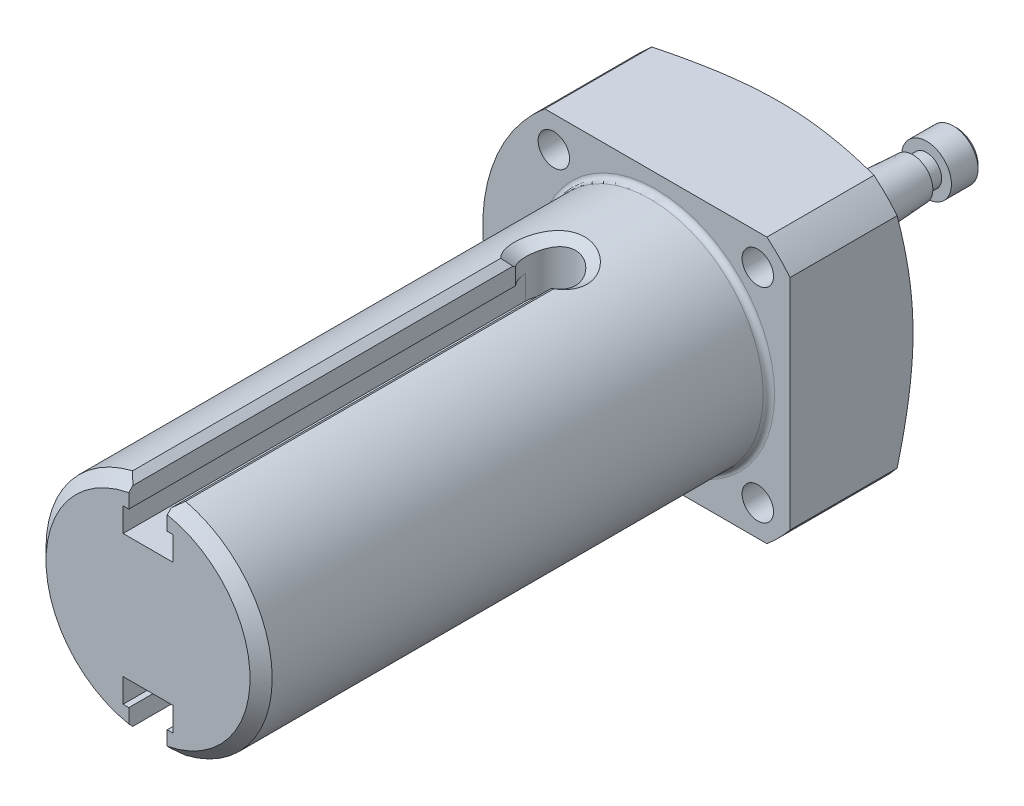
ISO-10303-21;
HEADER;
FILE_DESCRIPTION(('STEP AP214'),'2;1');
FILE_NAME('part.step','',(''),(''),'','','');
FILE_SCHEMA(('AUTOMOTIVE_DESIGN { 1 0 10303 214 1 1 1 1 }'));
ENDSEC;
DATA;
#1=APPLICATION_CONTEXT('core data for automotive mechanical design processes');
#2=APPLICATION_PROTOCOL_DEFINITION('international standard','automotive_design',2000,#1);
#3=PRODUCT_CONTEXT('',#1,'mechanical');
#4=PRODUCT('Part','Part','',(#3));
#5=PRODUCT_RELATED_PRODUCT_CATEGORY('part','',(#4));
#6=PRODUCT_DEFINITION_FORMATION('','',#4);
#7=PRODUCT_DEFINITION_CONTEXT('part definition',#1,'design');
#8=PRODUCT_DEFINITION('design','',#6,#7);
#9=PRODUCT_DEFINITION_SHAPE('','',#8);
#10=(LENGTH_UNIT() NAMED_UNIT(*) SI_UNIT(.MILLI.,.METRE.));
#11=(NAMED_UNIT(*) PLANE_ANGLE_UNIT() SI_UNIT($,.RADIAN.));
#12=(NAMED_UNIT(*) SI_UNIT($,.STERADIAN.) SOLID_ANGLE_UNIT());
#13=UNCERTAINTY_MEASURE_WITH_UNIT(LENGTH_MEASURE(1.E-05),#10,'distance_accuracy_value','');
#14=(GEOMETRIC_REPRESENTATION_CONTEXT(3) GLOBAL_UNCERTAINTY_ASSIGNED_CONTEXT((#13)) GLOBAL_UNIT_ASSIGNED_CONTEXT((#10,
#11,#12)) REPRESENTATION_CONTEXT('',''));
#15=CARTESIAN_POINT('',(0.,0.,0.));
#16=DIRECTION('',(0.,0.,1.));
#17=DIRECTION('',(1.,0.,0.));
#18=AXIS2_PLACEMENT_3D('',#15,#16,#17);
#19=CARTESIAN_POINT('',(2.76225,0.,-14.0105812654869));
#20=DIRECTION('',(0.,0.,1.));
#21=DIRECTION('',(1.,0.,0.));
#22=AXIS2_PLACEMENT_3D('',#19,#20,#21);
#23=PLANE('',#22);
#24=CARTESIAN_POINT('',(0.,0.,-14.0105812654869));
#25=DIRECTION('',(0.,0.,-1.));
#26=DIRECTION('',(-1.,0.,0.));
#27=AXIS2_PLACEMENT_3D('',#24,#25,#26);
#28=CIRCLE('',#27,2.76225);
#29=CARTESIAN_POINT('',(-2.76225,0.,-14.0105812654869));
#30=VERTEX_POINT('',#29);
#31=EDGE_CURVE('E728',#30,#30,#28,.T.);
#32=ORIENTED_EDGE('',*,*,#31,.T.);
#33=EDGE_LOOP('',(#32));
#34=FACE_BOUND('',#33,.T.);
#35=CARTESIAN_POINT('',(0.,0.,-14.0105812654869));
#36=DIRECTION('',(0.,0.,1.));
#37=DIRECTION('',(1.,0.,0.));
#38=AXIS2_PLACEMENT_3D('',#35,#36,#37);
#39=CIRCLE('',#38,2.0828);
#40=CARTESIAN_POINT('',(2.0828,0.,-14.0105812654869));
#41=VERTEX_POINT('',#40);
#42=EDGE_CURVE('E731',#41,#41,#39,.F.);
#43=ORIENTED_EDGE('',*,*,#42,.F.);
#44=EDGE_LOOP('',(#43));
#45=FACE_BOUND('',#44,.T.);
#46=ADVANCED_FACE('F37',(#34,#45),#23,.F.);
#47=CARTESIAN_POINT('',(0.,0.,0.));
#48=DIRECTION('',(0.,0.,1.));
#49=DIRECTION('',(1.,0.,0.));
#50=AXIS2_PLACEMENT_3D('',#47,#48,#49);
#51=PLANE('',#50);
#52=CARTESIAN_POINT('',(0.,0.,0.));
#53=DIRECTION('',(0.,0.,-1.));
#54=DIRECTION('',(-1.,0.,0.));
#55=AXIS2_PLACEMENT_3D('',#52,#53,#54);
#56=CIRCLE('',#55,7.62);
#57=CARTESIAN_POINT('',(-7.62,0.,0.));
#58=VERTEX_POINT('',#57);
#59=EDGE_CURVE('E900',#58,#58,#56,.T.);
#60=ORIENTED_EDGE('',*,*,#59,.T.);
#61=EDGE_LOOP('',(#60));
#62=FACE_BOUND('',#61,.T.);
#63=CARTESIAN_POINT('',(0.,0.,0.));
#64=DIRECTION('',(0.,0.,1.));
#65=DIRECTION('',(1.,0.,0.));
#66=AXIS2_PLACEMENT_3D('',#63,#64,#65);
#67=CIRCLE('',#66,3.16864999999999);
#68=CARTESIAN_POINT('',(3.16864999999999,0.,0.));
#69=VERTEX_POINT('',#68);
#70=EDGE_CURVE('E938',#69,#69,#67,.F.);
#71=ORIENTED_EDGE('',*,*,#70,.F.);
#72=EDGE_LOOP('',(#71));
#73=FACE_BOUND('',#72,.T.);
#74=ADVANCED_FACE('F593',(#62,#73),#51,.F.);
#75=CARTESIAN_POINT('',(0.,0.,91.186));
#76=DIRECTION('',(0.,0.,-1.));
#77=DIRECTION('',(-1.,0.,0.));
#78=AXIS2_PLACEMENT_3D('',#75,#76,#77);
#79=CYLINDRICAL_SURFACE('',#78,23.8125);
#80=CARTESIAN_POINT('',(-23.2091585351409,-5.32636051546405,13.4112));
#81=CARTESIAN_POINT('',(-23.2091589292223,-5.32637064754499,13.6432547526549));
#82=CARTESIAN_POINT('',(-23.2047620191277,-5.34563104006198,13.8754319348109));
#83=CARTESIAN_POINT('',(-23.1870318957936,-5.42200947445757,14.3332594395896));
#84=CARTESIAN_POINT('',(-23.1736906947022,-5.47916135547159,14.5589037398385));
#85=CARTESIAN_POINT('',(-23.1377013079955,-5.62919567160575,14.9969740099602));
#86=CARTESIAN_POINT('',(-23.1150612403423,-5.72204693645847,15.2094113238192));
#87=CARTESIAN_POINT('',(-23.0599455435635,-5.94025873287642,15.6154273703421));
#88=CARTESIAN_POINT('',(-23.0274708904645,-6.06561603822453,15.809007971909));
#89=CARTESIAN_POINT('',(-22.951760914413,-6.34610698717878,16.1739351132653));
#90=CARTESIAN_POINT('',(-22.9084241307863,-6.50151803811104,16.345047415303));
#91=CARTESIAN_POINT('',(-22.8107305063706,-6.83638000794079,16.6581437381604));
#92=CARTESIAN_POINT('',(-22.756372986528,-7.01583240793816,16.8001259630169));
#93=CARTESIAN_POINT('',(-22.6361734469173,-7.3944886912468,17.0518181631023));
#94=CARTESIAN_POINT('',(-22.5702580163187,-7.59381508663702,17.1613090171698));
#95=CARTESIAN_POINT('',(-22.4276977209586,-8.00505040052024,17.3435007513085));
#96=CARTESIAN_POINT('',(-22.3510536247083,-8.21695841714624,17.4162042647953));
#97=CARTESIAN_POINT('',(-22.1891106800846,-8.64466649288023,17.5220380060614));
#98=CARTESIAN_POINT('',(-22.1039075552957,-8.86040523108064,17.555562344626));
#99=CARTESIAN_POINT('',(-21.9262236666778,-9.29140375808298,17.5833125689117));
#100=CARTESIAN_POINT('',(-21.8337434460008,-9.50666358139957,17.5775413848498));
#101=CARTESIAN_POINT('',(-21.6453102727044,-9.92816388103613,17.527169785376));
#102=CARTESIAN_POINT('',(-21.5494062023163,-10.1344771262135,17.4829935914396));
#103=CARTESIAN_POINT('',(-21.3564572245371,-10.5350054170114,17.3577350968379));
#104=CARTESIAN_POINT('',(-21.2594122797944,-10.7292200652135,17.2766515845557));
#105=CARTESIAN_POINT('',(-21.0673729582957,-11.101581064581,17.0794652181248));
#106=CARTESIAN_POINT('',(-20.9723912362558,-11.2796423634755,16.9631895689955));
#107=CARTESIAN_POINT('',(-20.7888853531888,-11.6143831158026,16.6990464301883));
#108=CARTESIAN_POINT('',(-20.7003617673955,-11.771060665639,16.551176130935));
#109=CARTESIAN_POINT('',(-20.5325524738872,-12.0614258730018,16.225694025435));
#110=CARTESIAN_POINT('',(-20.4534059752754,-12.1947784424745,16.0477112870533));
#111=CARTESIAN_POINT('',(-20.3095612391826,-12.4328712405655,15.668300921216));
#112=CARTESIAN_POINT('',(-20.2448631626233,-12.5376111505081,15.466873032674));
#113=CARTESIAN_POINT('',(-20.1331717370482,-12.7161989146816,15.0458463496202));
#114=CARTESIAN_POINT('',(-20.0862020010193,-12.7900055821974,14.8262237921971));
#115=CARTESIAN_POINT('',(-20.0126712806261,-12.9047601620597,14.3752914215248));
#116=CARTESIAN_POINT('',(-19.9861083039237,-12.9457112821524,14.1439827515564));
#117=CARTESIAN_POINT('',(-19.9551118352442,-12.9934397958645,13.6795003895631));
#118=CARTESIAN_POINT('',(-19.9503920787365,-13.000659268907,13.4463911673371));
#119=CARTESIAN_POINT('',(-19.9625706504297,-12.9819509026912,12.9820840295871));
#120=CARTESIAN_POINT('',(-19.9794680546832,-12.9560244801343,12.7508860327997));
#121=CARTESIAN_POINT('',(-20.03372972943,-12.8719570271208,12.2986341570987));
#122=CARTESIAN_POINT('',(-20.0709487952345,-12.8140445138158,12.077520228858));
#123=CARTESIAN_POINT('',(-20.1637502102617,-12.667510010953,11.6498005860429));
#124=CARTESIAN_POINT('',(-20.2193337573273,-12.5788860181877,11.4431958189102));
#125=CARTESIAN_POINT('',(-20.3466697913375,-12.3718651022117,11.0480592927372));
#126=CARTESIAN_POINT('',(-20.4185801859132,-12.2531760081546,10.8597315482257));
#127=CARTESIAN_POINT('',(-20.5747321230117,-11.9891211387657,10.5086105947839));
#128=CARTESIAN_POINT('',(-20.6589746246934,-11.8437532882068,10.3458193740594));
#129=CARTESIAN_POINT('',(-20.8369566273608,-11.5277746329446,10.0484813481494));
#130=CARTESIAN_POINT('',(-20.9307943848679,-11.3568922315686,9.91428165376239));
#131=CARTESIAN_POINT('',(-21.1230196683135,-10.9952295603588,9.68037447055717));
#132=CARTESIAN_POINT('',(-21.2214070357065,-10.8044499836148,9.58066578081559));
#133=CARTESIAN_POINT('',(-21.4182410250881,-10.4087779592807,9.41910329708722));
#134=CARTESIAN_POINT('',(-21.5166851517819,-10.2039567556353,9.35707216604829));
#135=CARTESIAN_POINT('',(-21.7104394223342,-9.78494831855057,9.2720564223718));
#136=CARTESIAN_POINT('',(-21.8057498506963,-9.57076193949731,9.24906825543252));
#137=CARTESIAN_POINT('',(-21.9889026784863,-9.14204234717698,9.24290152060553));
#138=CARTESIAN_POINT('',(-22.0768276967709,-8.92755182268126,9.25919633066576));
#139=CARTESIAN_POINT('',(-22.2443168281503,-8.50164130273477,9.3299884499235));
#140=CARTESIAN_POINT('',(-22.323881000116,-8.29022128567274,9.38448549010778));
#141=CARTESIAN_POINT('',(-22.4730215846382,-7.87697215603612,9.52992523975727));
#142=CARTESIAN_POINT('',(-22.5426112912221,-7.67513052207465,9.62081881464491));
#143=CARTESIAN_POINT('',(-22.671151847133,-7.28669583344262,9.83641125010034));
#144=CARTESIAN_POINT('',(-22.7301021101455,-7.1001036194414,9.96111197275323));
#145=CARTESIAN_POINT('',(-22.8378629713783,-6.74551626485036,10.2426252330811));
#146=CARTESIAN_POINT('',(-22.8865368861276,-6.57778419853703,10.3998214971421));
#147=CARTESIAN_POINT('',(-22.9730780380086,-6.26886299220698,10.741061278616));
#148=CARTESIAN_POINT('',(-23.0109427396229,-6.12768008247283,10.9251110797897));
#149=CARTESIAN_POINT('',(-23.0766305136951,-5.8754952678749,11.3165631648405));
#150=CARTESIAN_POINT('',(-23.1043720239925,-5.76474020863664,11.5241381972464));
#151=CARTESIAN_POINT('',(-23.149965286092,-5.57884409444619,11.955522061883));
#152=CARTESIAN_POINT('',(-23.1678267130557,-5.50366820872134,12.1793147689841));
#153=CARTESIAN_POINT('',(-23.1904361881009,-5.4074454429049,12.5717844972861));
#154=CARTESIAN_POINT('',(-23.1974657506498,-5.37709722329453,12.7381136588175));
#155=CARTESIAN_POINT('',(-23.2068267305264,-5.33655128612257,13.0733402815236));
#156=CARTESIAN_POINT('',(-23.2091582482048,-5.32635313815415,13.2422376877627));
#157=CARTESIAN_POINT('',(-23.2091585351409,-5.32636051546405,13.4112));
#158=B_SPLINE_CURVE_WITH_KNOTS('',3,(#80,#81,#82,#83,#84,#85,#86,#87,#88,#89,#90,#91,#92,#93,
#94,#95,#96,#97,#98,#99,#100,#101,#102,#103,#104,#105,#106,#107,#108,#109,#110,#111,#112,#113,
#114,#115,#116,#117,#118,#119,#120,#121,#122,#123,#124,#125,#126,#127,#128,#129,#130,#131,#132,
#133,#134,#135,#136,#137,#138,#139,#140,#141,#142,#143,#144,#145,#146,#147,#148,#149,#150,#151,
#152,#153,#154,#155,#156,#157),.UNSPECIFIED.,.T.,.F.,(4,2,2,2,2,2,2,2,2,2,2,2,2,2,2,2,2,2,2,2,2,
2,2,2,2,2,2,2,2,2,2,2,2,2,2,2,2,2,4),(0.,0.695546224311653,1.39171444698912,2.08727619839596,
2.78276894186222,3.48501741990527,4.18730918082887,4.89423482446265,5.60110985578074,
6.30081136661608,7.00046070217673,7.6924785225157,8.38451906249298,9.08001424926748,
9.77557130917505,10.4804204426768,11.1852774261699,11.8910699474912,12.5967935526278,
13.2932416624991,13.9896600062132,14.6811661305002,15.37271736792,16.0712657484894,
16.7698684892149,17.4765219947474,18.1831508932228,18.8864275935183,19.5896402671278,
20.283478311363,20.9773114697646,21.6702111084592,22.363148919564,23.0647917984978,
23.7665991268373,24.4739421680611,25.1805913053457,25.687039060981,26.1934759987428),.UNSPECIFIED.);
#159=CARTESIAN_POINT('',(-23.2091585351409,-5.32636051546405,13.4112));
#160=VERTEX_POINT('',#159);
#161=EDGE_CURVE('E855',#160,#160,#158,.T.);
#162=ORIENTED_EDGE('',*,*,#161,.T.);
#163=EDGE_LOOP('',(#162));
#164=FACE_BOUND('',#163,.T.);
#165=CARTESIAN_POINT('',(-23.2091585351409,5.32636051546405,13.4112));
#166=CARTESIAN_POINT('',(-23.2091589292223,5.32637064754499,13.1791452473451));
#167=CARTESIAN_POINT('',(-23.2047620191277,5.34563104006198,12.9469680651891));
#168=CARTESIAN_POINT('',(-23.1870318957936,5.42200947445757,12.4891405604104));
#169=CARTESIAN_POINT('',(-23.1736906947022,5.47916135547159,12.2634962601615));
#170=CARTESIAN_POINT('',(-23.1377013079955,5.62919567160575,11.8254259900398));
#171=CARTESIAN_POINT('',(-23.1150612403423,5.72204693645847,11.6129886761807));
#172=CARTESIAN_POINT('',(-23.0599455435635,5.94025873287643,11.2069726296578));
#173=CARTESIAN_POINT('',(-23.0274708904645,6.06561603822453,11.013392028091));
#174=CARTESIAN_POINT('',(-22.951760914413,6.34610698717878,10.6484648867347));
#175=CARTESIAN_POINT('',(-22.9084241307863,6.50151803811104,10.4773525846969));
#176=CARTESIAN_POINT('',(-22.8107305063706,6.83638000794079,10.1642562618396));
#177=CARTESIAN_POINT('',(-22.756372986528,7.01583240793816,10.0222740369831));
#178=CARTESIAN_POINT('',(-22.6361734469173,7.3944886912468,9.77058183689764));
#179=CARTESIAN_POINT('',(-22.5702580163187,7.59381508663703,9.66109098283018));
#180=CARTESIAN_POINT('',(-22.4276977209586,8.00505040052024,9.47889924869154));
#181=CARTESIAN_POINT('',(-22.3510536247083,8.21695841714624,9.40619573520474));
#182=CARTESIAN_POINT('',(-22.1891106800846,8.64466649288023,9.30036199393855));
#183=CARTESIAN_POINT('',(-22.1039075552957,8.86040523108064,9.26683765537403));
#184=CARTESIAN_POINT('',(-21.9262236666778,9.29140375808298,9.23908743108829));
#185=CARTESIAN_POINT('',(-21.8337434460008,9.50666358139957,9.24485861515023));
#186=CARTESIAN_POINT('',(-21.6453102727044,9.92816388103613,9.29523021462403));
#187=CARTESIAN_POINT('',(-21.5494062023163,10.1344771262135,9.33940640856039));
#188=CARTESIAN_POINT('',(-21.3564572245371,10.5350054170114,9.46466490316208));
#189=CARTESIAN_POINT('',(-21.2594122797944,10.7292200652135,9.54574841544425));
#190=CARTESIAN_POINT('',(-21.0673729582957,11.101581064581,9.74293478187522));
#191=CARTESIAN_POINT('',(-20.9723912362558,11.2796423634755,9.85921043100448));
#192=CARTESIAN_POINT('',(-20.7888853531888,11.6143831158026,10.1233535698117));
#193=CARTESIAN_POINT('',(-20.7003617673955,11.771060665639,10.271223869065));
#194=CARTESIAN_POINT('',(-20.5325524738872,12.0614258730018,10.596705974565));
#195=CARTESIAN_POINT('',(-20.4534059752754,12.1947784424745,10.7746887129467));
#196=CARTESIAN_POINT('',(-20.3095612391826,12.4328712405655,11.154099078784));
#197=CARTESIAN_POINT('',(-20.2448631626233,12.5376111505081,11.355526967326));
#198=CARTESIAN_POINT('',(-20.1331717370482,12.7161989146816,11.7765536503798));
#199=CARTESIAN_POINT('',(-20.0862020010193,12.7900055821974,11.9961762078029));
#200=CARTESIAN_POINT('',(-20.0126712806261,12.9047601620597,12.4471085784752));
#201=CARTESIAN_POINT('',(-19.9861083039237,12.9457112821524,12.6784172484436));
#202=CARTESIAN_POINT('',(-19.9551118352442,12.9934397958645,13.1428996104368));
#203=CARTESIAN_POINT('',(-19.9503920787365,13.000659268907,13.3760088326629));
#204=CARTESIAN_POINT('',(-19.9625706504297,12.9819509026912,13.8403159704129));
#205=CARTESIAN_POINT('',(-19.9794680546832,12.9560244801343,14.0715139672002));
#206=CARTESIAN_POINT('',(-20.03372972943,12.8719570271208,14.5237658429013));
#207=CARTESIAN_POINT('',(-20.0709487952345,12.8140445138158,14.744879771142));
#208=CARTESIAN_POINT('',(-20.1637502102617,12.667510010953,15.1725994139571));
#209=CARTESIAN_POINT('',(-20.2193337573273,12.5788860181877,15.3792041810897));
#210=CARTESIAN_POINT('',(-20.3466697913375,12.3718651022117,15.7743407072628));
#211=CARTESIAN_POINT('',(-20.4185801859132,12.2531760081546,15.9626684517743));
#212=CARTESIAN_POINT('',(-20.5747321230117,11.9891211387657,16.3137894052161));
#213=CARTESIAN_POINT('',(-20.6589746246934,11.8437532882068,16.4765806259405));
#214=CARTESIAN_POINT('',(-20.8369566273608,11.5277746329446,16.7739186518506));
#215=CARTESIAN_POINT('',(-20.9307943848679,11.3568922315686,16.9081183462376));
#216=CARTESIAN_POINT('',(-21.1230196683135,10.9952295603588,17.1420255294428));
#217=CARTESIAN_POINT('',(-21.2214070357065,10.8044499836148,17.2417342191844));
#218=CARTESIAN_POINT('',(-21.4182410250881,10.4087779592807,17.4032967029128));
#219=CARTESIAN_POINT('',(-21.5166851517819,10.2039567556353,17.4653278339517));
#220=CARTESIAN_POINT('',(-21.7104394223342,9.78494831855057,17.5503435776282));
#221=CARTESIAN_POINT('',(-21.8057498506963,9.57076193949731,17.5733317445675));
#222=CARTESIAN_POINT('',(-21.9889026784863,9.14204234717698,17.5794984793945));
#223=CARTESIAN_POINT('',(-22.0768276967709,8.92755182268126,17.5632036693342));
#224=CARTESIAN_POINT('',(-22.2443168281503,8.50164130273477,17.4924115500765));
#225=CARTESIAN_POINT('',(-22.323881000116,8.29022128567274,17.4379145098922));
#226=CARTESIAN_POINT('',(-22.4730215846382,7.87697215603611,17.2924747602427));
#227=CARTESIAN_POINT('',(-22.5426112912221,7.67513052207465,17.2015811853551));
#228=CARTESIAN_POINT('',(-22.671151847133,7.28669583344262,16.9859887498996));
#229=CARTESIAN_POINT('',(-22.7301021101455,7.1001036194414,16.8612880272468));
#230=CARTESIAN_POINT('',(-22.8378629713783,6.74551626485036,16.5797747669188));
#231=CARTESIAN_POINT('',(-22.8865368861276,6.57778419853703,16.4225785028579));
#232=CARTESIAN_POINT('',(-22.9730780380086,6.26886299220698,16.081338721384));
#233=CARTESIAN_POINT('',(-23.0109427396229,6.12768008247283,15.8972889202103));
#234=CARTESIAN_POINT('',(-23.0766305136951,5.8754952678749,15.5058368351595));
#235=CARTESIAN_POINT('',(-23.1043720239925,5.76474020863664,15.2982618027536));
#236=CARTESIAN_POINT('',(-23.149965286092,5.57884409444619,14.866877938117));
#237=CARTESIAN_POINT('',(-23.1678267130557,5.50366820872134,14.6430852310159));
#238=CARTESIAN_POINT('',(-23.1904361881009,5.4074454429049,14.2506155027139));
#239=CARTESIAN_POINT('',(-23.1974657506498,5.37709722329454,14.0842863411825));
#240=CARTESIAN_POINT('',(-23.2068267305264,5.33655128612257,13.7490597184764));
#241=CARTESIAN_POINT('',(-23.2091582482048,5.32635313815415,13.5801623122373));
#242=CARTESIAN_POINT('',(-23.2091585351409,5.32636051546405,13.4112));
#243=B_SPLINE_CURVE_WITH_KNOTS('',3,(#165,#166,#167,#168,#169,#170,#171,#172,#173,#174,#175,
#176,#177,#178,#179,#180,#181,#182,#183,#184,#185,#186,#187,#188,#189,#190,#191,#192,#193,#194,
#195,#196,#197,#198,#199,#200,#201,#202,#203,#204,#205,#206,#207,#208,#209,#210,#211,#212,#213,
#214,#215,#216,#217,#218,#219,#220,#221,#222,#223,#224,#225,#226,#227,#228,#229,#230,#231,#232,
#233,#234,#235,#236,#237,#238,#239,#240,#241,#242),.UNSPECIFIED.,.T.,.F.,(4,2,2,2,2,2,2,2,2,2,2,
2,2,2,2,2,2,2,2,2,2,2,2,2,2,2,2,2,2,2,2,2,2,2,2,2,2,2,4),(0.,0.695546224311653,1.39171444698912,
2.08727619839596,2.78276894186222,3.48501741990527,4.18730918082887,4.89423482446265,
5.60110985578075,6.30081136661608,7.00046070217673,7.69247852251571,8.38451906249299,
9.08001424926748,9.77557130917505,10.4804204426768,11.1852774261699,11.8910699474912,
12.5967935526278,13.2932416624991,13.9896600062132,14.6811661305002,15.37271736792,
16.0712657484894,16.7698684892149,17.4765219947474,18.1831508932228,18.8864275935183,
19.5896402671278,20.283478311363,20.9773114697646,21.6702111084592,22.363148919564,
23.0647917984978,23.7665991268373,24.4739421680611,25.1805913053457,25.687039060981,
26.1934759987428),.UNSPECIFIED.);
#244=CARTESIAN_POINT('',(-23.2091585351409,5.32636051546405,13.4112));
#245=VERTEX_POINT('',#244);
#246=EDGE_CURVE('E859',#245,#245,#243,.T.);
#247=ORIENTED_EDGE('',*,*,#246,.T.);
#248=EDGE_LOOP('',(#247));
#249=FACE_BOUND('',#248,.T.);
#250=DIRECTION('',(0.,0.,-1.));
#251=VECTOR('',#250,1.);
#252=CARTESIAN_POINT('',(-15.2811189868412,18.2626,91.186));
#253=LINE('',#252,#251);
#254=CARTESIAN_POINT('',(-15.2811189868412,18.2626,21.336));
#255=VERTEX_POINT('',#254);
#256=CARTESIAN_POINT('',(-15.2811189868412,18.2626,6.604));
#257=VERTEX_POINT('',#256);
#258=EDGE_CURVE('E927',#255,#257,#253,.T.);
#259=ORIENTED_EDGE('',*,*,#258,.T.);
#260=CARTESIAN_POINT('',(0.,0.,6.604));
#261=DIRECTION('',(0.,0.,-1.));
#262=DIRECTION('',(-1.,0.,0.));
#263=AXIS2_PLACEMENT_3D('',#260,#261,#262);
#264=CIRCLE('',#263,23.8125);
#265=CARTESIAN_POINT('',(-15.2811189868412,-18.2626,6.604));
#266=VERTEX_POINT('',#265);
#267=EDGE_CURVE('E614',#266,#257,#264,.T.);
#268=ORIENTED_EDGE('',*,*,#267,.F.);
#269=DIRECTION('',(0.,0.,-1.));
#270=VECTOR('',#269,1.);
#271=CARTESIAN_POINT('',(-15.2811189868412,-18.2626,91.186));
#272=LINE('',#271,#270);
#273=CARTESIAN_POINT('',(-15.2811189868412,-18.2626,21.336));
#274=VERTEX_POINT('',#273);
#275=EDGE_CURVE('E933',#274,#266,#272,.T.);
#276=ORIENTED_EDGE('',*,*,#275,.F.);
#277=CARTESIAN_POINT('',(0.,0.,21.336));
#278=DIRECTION('',(0.,0.,-1.));
#279=DIRECTION('',(-1.,0.,0.));
#280=AXIS2_PLACEMENT_3D('',#277,#278,#279);
#281=CIRCLE('',#280,23.8125);
#282=EDGE_CURVE('E1021',#274,#255,#281,.T.);
#283=ORIENTED_EDGE('',*,*,#282,.T.);
#284=EDGE_LOOP('',(#259,#268,#276,#283));
#285=FACE_BOUND('',#284,.T.);
#286=ADVANCED_FACE('F423',(#164,#249,#285),#79,.T.);
#287=CARTESIAN_POINT('',(-15.2811189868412,-18.2626,91.186));
#288=DIRECTION('',(0.,1.,0.));
#289=DIRECTION('',(0.,0.,1.));
#290=AXIS2_PLACEMENT_3D('',#287,#288,#289);
#291=PLANE('',#290);
#292=ORIENTED_EDGE('',*,*,#275,.T.);
#293=CARTESIAN_POINT('',(-32.2232192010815,-18.2626,11.9981770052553));
#294=CARTESIAN_POINT('',(-31.7848976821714,-18.2626,11.8426544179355));
#295=CARTESIAN_POINT('',(-31.3463347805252,-18.2626,11.6878124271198));
#296=CARTESIAN_POINT('',(-30.468675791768,-18.2626,11.3796413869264));
#297=CARTESIAN_POINT('',(-30.0295797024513,-18.2626,11.2263123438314));
#298=CARTESIAN_POINT('',(-28.7113721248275,-18.2626,10.7688070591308));
#299=CARTESIAN_POINT('',(-27.8313905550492,-18.2626,10.4671301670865));
#300=CARTESIAN_POINT('',(-26.0677552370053,-18.2626,9.87168152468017));
#301=CARTESIAN_POINT('',(-25.1840986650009,-18.2626,9.57791812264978));
#302=CARTESIAN_POINT('',(-23.4134499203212,-18.2626,9.00063784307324));
#303=CARTESIAN_POINT('',(-22.5264577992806,-18.2626,8.71712080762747));
#304=CARTESIAN_POINT('',(-20.7583367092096,-18.2626,8.16605141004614));
#305=CARTESIAN_POINT('',(-19.8772523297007,-18.2626,7.89835650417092));
#306=CARTESIAN_POINT('',(-18.1103522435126,-18.2626,7.37889924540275));
#307=CARTESIAN_POINT('',(-17.2245364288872,-18.2626,7.12713725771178));
#308=CARTESIAN_POINT('',(-15.4471704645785,-18.2626,6.64385538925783));
#309=CARTESIAN_POINT('',(-14.555619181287,-18.2626,6.41233965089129));
#310=CARTESIAN_POINT('',(-12.7661615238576,-18.2626,5.97518799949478));
#311=CARTESIAN_POINT('',(-11.8682554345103,-18.2626,5.76955093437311));
#312=CARTESIAN_POINT('',(-10.2335004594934,-18.2626,5.42632015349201));
#313=CARTESIAN_POINT('',(-9.49782161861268,-18.2626,5.28318768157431));
#314=CARTESIAN_POINT('',(-8.02184801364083,-18.2626,5.02285214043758));
#315=CARTESIAN_POINT('',(-7.28155332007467,-18.2626,4.9056486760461));
#316=CARTESIAN_POINT('',(-5.79768393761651,-18.2626,4.70164652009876));
#317=CARTESIAN_POINT('',(-5.05411457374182,-18.2626,4.61480960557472));
#318=CARTESIAN_POINT('',(-3.56375387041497,-18.2626,4.47523685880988));
#319=CARTESIAN_POINT('',(-2.81696262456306,-18.2626,4.42250004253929));
#320=CARTESIAN_POINT('',(-1.31709190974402,-18.2626,4.3536353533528));
#321=CARTESIAN_POINT('',(-0.564001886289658,-18.2626,4.33773296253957));
#322=CARTESIAN_POINT('',(0.942022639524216,-18.2626,4.34408757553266));
#323=CARTESIAN_POINT('',(1.69495713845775,-18.2626,4.36634534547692));
#324=CARTESIAN_POINT('',(3.19945878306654,-18.2626,4.44782572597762));
#325=CARTESIAN_POINT('',(3.95102420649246,-18.2626,4.50707996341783));
#326=CARTESIAN_POINT('',(5.07566176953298,-18.2626,4.6214028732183));
#327=CARTESIAN_POINT('',(5.45008130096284,-18.2626,4.66374960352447));
#328=CARTESIAN_POINT('',(6.19792901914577,-18.2626,4.75642041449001));
#329=CARTESIAN_POINT('',(6.57135720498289,-18.2626,4.80674450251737));
#330=CARTESIAN_POINT('',(8.1697661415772,-18.2626,5.03844051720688));
#331=CARTESIAN_POINT('',(9.38958382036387,-18.2626,5.25636356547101));
#332=CARTESIAN_POINT('',(11.2097274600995,-18.2626,5.62907808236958));
#333=CARTESIAN_POINT('',(11.8150070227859,-18.2626,5.76099639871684));
#334=CARTESIAN_POINT('',(13.0225731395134,-18.2626,6.03793660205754));
#335=CARTESIAN_POINT('',(13.6248597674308,-18.2626,6.18295816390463));
#336=CARTESIAN_POINT('',(14.8276319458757,-18.2626,6.48440531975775));
#337=CARTESIAN_POINT('',(15.4281127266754,-18.2626,6.6408497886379));
#338=CARTESIAN_POINT('',(16.6265155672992,-18.2626,6.96324232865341));
#339=CARTESIAN_POINT('',(17.2244376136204,-18.2626,7.12919044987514));
#340=CARTESIAN_POINT('',(18.4178704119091,-18.2626,7.46912762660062));
#341=CARTESIAN_POINT('',(19.013381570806,-18.2626,7.64311525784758));
#342=CARTESIAN_POINT('',(20.2023487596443,-18.2626,7.99795688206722));
#343=CARTESIAN_POINT('',(20.7958047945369,-18.2626,8.17881085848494));
#344=CARTESIAN_POINT('',(21.9851863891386,-18.2626,8.54770963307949));
#345=CARTESIAN_POINT('',(22.5810987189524,-18.2626,8.73579701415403));
#346=CARTESIAN_POINT('',(23.7712928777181,-18.2626,9.11706712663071));
#347=CARTESIAN_POINT('',(24.3655746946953,-18.2626,9.310249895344));
#348=CARTESIAN_POINT('',(26.146285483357,-18.2626,9.89634267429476));
#349=CARTESIAN_POINT('',(27.3305629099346,-18.2626,10.2957918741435));
#350=CARTESIAN_POINT('',(29.6934792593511,-18.2626,11.1073137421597));
#351=CARTESIAN_POINT('',(30.8721225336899,-18.2626,11.5193738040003));
#352=CARTESIAN_POINT('',(33.2258690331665,-18.2626,12.3534260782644));
#353=CARTESIAN_POINT('',(34.4009722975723,-18.2626,12.7754181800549));
#354=CARTESIAN_POINT('',(36.7445541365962,-18.2626,13.6257349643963));
#355=CARTESIAN_POINT('',(37.9130418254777,-18.2626,14.0540345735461));
#356=CARTESIAN_POINT('',(40.2477770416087,-18.2626,14.916696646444));
#357=CARTESIAN_POINT('',(41.4140245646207,-18.2626,15.3510591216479));
#358=CARTESIAN_POINT('',(43.7450304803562,-18.2626,16.2247712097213));
#359=CARTESIAN_POINT('',(44.9097883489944,-18.2626,16.6641222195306));
#360=CARTESIAN_POINT('',(47.2378052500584,-18.2626,17.5467781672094));
#361=CARTESIAN_POINT('',(48.4010642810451,-18.2626,17.990083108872));
#362=CARTESIAN_POINT('',(50.7094633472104,-18.2626,18.8734873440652));
#363=CARTESIAN_POINT('',(51.854621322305,-18.2626,19.3135397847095));
#364=CARTESIAN_POINT('',(54.1439218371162,-18.2626,20.1962789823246));
#365=CARTESIAN_POINT('',(55.2880643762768,-18.2626,20.6389657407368));
#366=CARTESIAN_POINT('',(57.5751216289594,-18.2626,21.5264099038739));
#367=CARTESIAN_POINT('',(58.7180366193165,-18.2626,21.9711665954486));
#368=CARTESIAN_POINT('',(61.0031265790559,-18.2626,22.86257047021));
#369=CARTESIAN_POINT('',(62.145301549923,-18.2626,23.3092176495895));
#370=CARTESIAN_POINT('',(63.2871681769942,-18.2626,23.756650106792));
#371=B_SPLINE_CURVE_WITH_KNOTS('',3,(#293,#294,#295,#296,#297,#298,#299,#300,#301,#302,#303,
#304,#305,#306,#307,#308,#309,#310,#311,#312,#313,#314,#315,#316,#317,#318,#319,#320,#321,#322,
#323,#324,#325,#326,#327,#328,#329,#330,#331,#332,#333,#334,#335,#336,#337,#338,#339,#340,#341,
#342,#343,#344,#345,#346,#347,#348,#349,#350,#351,#352,#353,#354,#355,#356,#357,#358,#359,#360,
#361,#362,#363,#364,#365,#366,#367,#368,#369,#370),.UNSPECIFIED.,.F.,.F.,(4,2,2,2,2,2,2,2,2,2,2,
2,2,2,2,2,2,2,2,2,2,2,2,2,2,2,2,2,2,2,2,2,2,2,2,2,2,2,4),(0.,1.39528287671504,2.79057154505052,
5.58130562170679,8.37487682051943,11.1684049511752,13.93084743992,16.6933532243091,
19.4564229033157,22.2193695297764,24.467407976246,26.7154121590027,28.9605764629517,
31.205675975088,33.4644829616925,35.723335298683,37.9841212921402,39.1144664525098,
40.2448126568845,43.959596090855,45.8179918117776,47.6763414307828,49.5378344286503,
51.3993372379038,53.260511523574,55.1216813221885,56.9963265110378,58.8709854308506,
62.6203563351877,66.3660943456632,70.1117906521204,73.8452989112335,77.578814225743,
81.3134021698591,85.0479936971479,88.72838339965,92.4087751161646,96.0879809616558,
99.7671794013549),.UNSPECIFIED.);
#372=CARTESIAN_POINT('',(15.2811189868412,-18.2626,6.604));
#373=VERTEX_POINT('',#372);
#374=EDGE_CURVE('E632',#266,#373,#371,.T.);
#375=ORIENTED_EDGE('',*,*,#374,.T.);
#376=DIRECTION('',(0.,0.,-1.));
#377=VECTOR('',#376,1.);
#378=CARTESIAN_POINT('',(15.2811189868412,-18.2626,91.186));
#379=LINE('',#378,#377);
#380=CARTESIAN_POINT('',(15.2811189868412,-18.2626,21.336));
#381=VERTEX_POINT('',#380);
#382=EDGE_CURVE('E925',#381,#373,#379,.T.);
#383=ORIENTED_EDGE('',*,*,#382,.F.);
#384=DIRECTION('',(-1.,0.,0.));
#385=VECTOR('',#384,1.);
#386=CARTESIAN_POINT('',(-15.2811189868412,-18.2626,21.336));
#387=LINE('',#386,#385);
#388=EDGE_CURVE('E1018',#381,#274,#387,.T.);
#389=ORIENTED_EDGE('',*,*,#388,.T.);
#390=EDGE_LOOP('',(#292,#375,#383,#389));
#391=FACE_BOUND('',#390,.T.);
#392=ADVANCED_FACE('F1026',(#391),#291,.F.);
#393=CARTESIAN_POINT('',(0.,0.,91.186));
#394=DIRECTION('',(0.,0.,-1.));
#395=DIRECTION('',(-1.,0.,0.));
#396=AXIS2_PLACEMENT_3D('',#393,#394,#395);
#397=CYLINDRICAL_SURFACE('',#396,23.8125);
#398=ORIENTED_EDGE('',*,*,#382,.T.);
#399=CARTESIAN_POINT('',(18.4658,-15.0349388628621,6.604));
#400=VERTEX_POINT('',#399);
#401=EDGE_CURVE('E903',#400,#373,#264,.T.);
#402=ORIENTED_EDGE('',*,*,#401,.F.);
#403=DIRECTION('',(0.,0.,-1.));
#404=VECTOR('',#403,1.);
#405=CARTESIAN_POINT('',(18.4658,-15.0349388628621,91.186));
#406=LINE('',#405,#404);
#407=CARTESIAN_POINT('',(18.4658,-15.0349388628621,21.336));
#408=VERTEX_POINT('',#407);
#409=EDGE_CURVE('E920',#408,#400,#406,.T.);
#410=ORIENTED_EDGE('',*,*,#409,.F.);
#411=EDGE_CURVE('E1015',#408,#381,#281,.T.);
#412=ORIENTED_EDGE('',*,*,#411,.T.);
#413=EDGE_LOOP('',(#398,#402,#410,#412));
#414=FACE_BOUND('',#413,.T.);
#415=ADVANCED_FACE('F1023',(#414),#397,.T.);
#416=CARTESIAN_POINT('',(18.4658,15.0349388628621,91.186));
#417=DIRECTION('',(-1.,0.,0.));
#418=DIRECTION('',(0.,0.,1.));
#419=AXIS2_PLACEMENT_3D('',#416,#417,#418);
#420=PLANE('',#419);
#421=ORIENTED_EDGE('',*,*,#409,.T.);
#422=CARTESIAN_POINT('',(18.4658,-32.1407558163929,12.0100399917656));
#423=CARTESIAN_POINT('',(18.4658,-31.7004672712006,11.8543416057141));
#424=CARTESIAN_POINT('',(18.4658,-31.2599309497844,11.6993441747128));
#425=CARTESIAN_POINT('',(18.4658,-30.3783110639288,11.3909076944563));
#426=CARTESIAN_POINT('',(18.4658,-29.9372274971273,11.2374686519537));
#427=CARTESIAN_POINT('',(18.4658,-28.6130319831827,10.7797078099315));
#428=CARTESIAN_POINT('',(18.4658,-27.7290272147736,10.4779607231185));
#429=CARTESIAN_POINT('',(18.4658,-25.9571596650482,9.88258308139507));
#430=CARTESIAN_POINT('',(18.4658,-25.0692936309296,9.58896218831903));
#431=CARTESIAN_POINT('',(18.4658,-23.290144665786,9.01228022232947));
#432=CARTESIAN_POINT('',(18.4658,-22.3988617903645,8.72921897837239));
#433=CARTESIAN_POINT('',(18.4658,-20.6223639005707,8.17952194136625));
#434=CARTESIAN_POINT('',(18.4658,-19.7371956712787,7.91273559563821));
#435=CARTESIAN_POINT('',(18.4658,-17.9620406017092,7.39555945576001));
#436=CARTESIAN_POINT('',(18.4658,-17.0720536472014,7.14517005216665));
#437=CARTESIAN_POINT('',(18.4658,-15.286289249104,6.66521023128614));
#438=CARTESIAN_POINT('',(18.4658,-14.3905110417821,6.43564262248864));
#439=CARTESIAN_POINT('',(18.4658,-12.5926401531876,6.0030644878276));
#440=CARTESIAN_POINT('',(18.4658,-11.6905477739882,5.80005270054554));
#441=CARTESIAN_POINT('',(18.4658,-9.31828761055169,5.3121429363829));
#442=CARTESIAN_POINT('',(18.4658,-7.84218421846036,5.05436103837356));
#443=CARTESIAN_POINT('',(18.4658,-5.61683548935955,4.75888853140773));
#444=CARTESIAN_POINT('',(18.4658,-4.87358309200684,4.67561773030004));
#445=CARTESIAN_POINT('',(18.4658,-3.38400249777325,4.54306627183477));
#446=CARTESIAN_POINT('',(18.4658,-2.63767438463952,4.49378469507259));
#447=CARTESIAN_POINT('',(18.4658,-1.13895561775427,4.43153482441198));
#448=CARTESIAN_POINT('',(18.4658,-0.386555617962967,4.4187882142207));
#449=CARTESIAN_POINT('',(18.4658,1.1179460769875,4.43093537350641));
#450=CARTESIAN_POINT('',(18.4658,1.87004776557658,4.45582993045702));
#451=CARTESIAN_POINT('',(18.4658,3.37278076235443,4.5419568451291));
#452=CARTESIAN_POINT('',(18.4658,4.1234103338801,4.60321932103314));
#453=CARTESIAN_POINT('',(18.4658,5.24663846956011,4.72007799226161));
#454=CARTESIAN_POINT('',(18.4658,5.62058815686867,4.76319066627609));
#455=CARTESIAN_POINT('',(18.4658,6.36749985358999,4.85724301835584));
#456=CARTESIAN_POINT('',(18.4658,6.74046186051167,4.90818271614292));
#457=CARTESIAN_POINT('',(18.4658,8.32083530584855,5.13986203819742));
#458=CARTESIAN_POINT('',(18.4658,9.52326729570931,5.35543224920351));
#459=CARTESIAN_POINT('',(18.4658,11.3177097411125,5.72284887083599));
#460=CARTESIAN_POINT('',(18.4658,11.9144722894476,5.85270293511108));
#461=CARTESIAN_POINT('',(18.4658,13.1051155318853,6.1250591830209));
#462=CARTESIAN_POINT('',(18.4658,13.6989962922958,6.26756107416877));
#463=CARTESIAN_POINT('',(18.4658,14.8849792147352,6.56360641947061));
#464=CARTESIAN_POINT('',(18.4658,15.4770770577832,6.71716703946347));
#465=CARTESIAN_POINT('',(18.4658,16.6587948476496,7.03353640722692));
#466=CARTESIAN_POINT('',(18.4658,17.2484147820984,7.19634520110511));
#467=CARTESIAN_POINT('',(18.4658,18.4253175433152,7.52982109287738));
#468=CARTESIAN_POINT('',(18.4658,19.012600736,7.70048690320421));
#469=CARTESIAN_POINT('',(18.4658,20.1851625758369,8.04855267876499));
#470=CARTESIAN_POINT('',(18.4658,20.7704412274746,8.22595262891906));
#471=CARTESIAN_POINT('',(18.4658,21.9432314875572,8.58775876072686));
#472=CARTESIAN_POINT('',(18.4658,22.5307308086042,8.77220470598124));
#473=CARTESIAN_POINT('',(18.4658,23.7041290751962,9.14612411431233));
#474=CARTESIAN_POINT('',(18.4658,24.2900280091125,9.33559761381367));
#475=CARTESIAN_POINT('',(18.4658,26.0456200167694,9.91049538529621));
#476=CARTESIAN_POINT('',(18.4658,27.2131942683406,10.3023925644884));
#477=CARTESIAN_POINT('',(18.4658,29.5428344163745,11.0987804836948));
#478=CARTESIAN_POINT('',(18.4658,30.7049043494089,11.50325947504));
#479=CARTESIAN_POINT('',(18.4658,33.0255210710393,12.3221464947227));
#480=CARTESIAN_POINT('',(18.4658,34.1840678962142,12.7365544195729));
#481=CARTESIAN_POINT('',(18.4658,36.4936594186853,13.5714162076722));
#482=CARTESIAN_POINT('',(18.4658,37.6447154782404,13.9918386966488));
#483=CARTESIAN_POINT('',(18.4658,39.9445835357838,14.8387765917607));
#484=CARTESIAN_POINT('',(18.4658,41.0933955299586,15.2652920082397));
#485=CARTESIAN_POINT('',(18.4658,43.3894935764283,16.1233368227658));
#486=CARTESIAN_POINT('',(18.4658,44.5367791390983,16.5548675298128));
#487=CARTESIAN_POINT('',(18.4658,46.82984034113,17.4219229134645));
#488=CARTESIAN_POINT('',(18.4658,47.9756159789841,17.8574475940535));
#489=CARTESIAN_POINT('',(18.4658,50.2499412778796,18.7256922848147));
#490=CARTESIAN_POINT('',(18.4658,51.3785083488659,19.1583667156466));
#491=CARTESIAN_POINT('',(18.4658,53.6346140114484,20.0263895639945));
#492=CARTESIAN_POINT('',(18.4658,54.762152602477,20.4617379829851));
#493=CARTESIAN_POINT('',(18.4658,57.0160158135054,21.3345526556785));
#494=CARTESIAN_POINT('',(18.4658,58.1423406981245,21.7720182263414));
#495=CARTESIAN_POINT('',(18.4658,60.3942386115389,22.6488735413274));
#496=CARTESIAN_POINT('',(18.4658,61.5198116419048,23.0882632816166));
#497=CARTESIAN_POINT('',(18.4658,62.6450708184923,23.5284536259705));
#498=B_SPLINE_CURVE_WITH_KNOTS('',3,(#422,#423,#424,#425,#426,#427,#428,#429,#430,#431,#432,
#433,#434,#435,#436,#437,#438,#439,#440,#441,#442,#443,#444,#445,#446,#447,#448,#449,#450,#451,
#452,#453,#454,#455,#456,#457,#458,#459,#460,#461,#462,#463,#464,#465,#466,#467,#468,#469,#470,
#471,#472,#473,#474,#475,#476,#477,#478,#479,#480,#481,#482,#483,#484,#485,#486,#487,#488,#489,
#490,#491,#492,#493,#494,#495,#496,#497),.UNSPECIFIED.,.F.,.F.,(4,2,2,2,2,2,2,2,2,2,2,2,2,2,2,2,
2,2,2,2,2,2,2,2,2,2,2,2,2,2,2,2,2,2,2,2,2,4),(0.,1.40102134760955,2.80204876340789,
5.60426907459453,8.4096892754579,11.2150640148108,13.9884323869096,16.7618667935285,
19.5356747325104,22.3093508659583,26.8002178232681,29.0432794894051,31.2862804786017,
33.5428628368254,35.7994924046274,38.0579934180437,39.1872015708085,40.3164125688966,
43.9787930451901,45.8109075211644,47.6429796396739,49.4779595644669,51.3129486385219,
53.1476380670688,54.9823233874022,56.8296144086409,58.6769188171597,62.3715717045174,
66.0628724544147,69.7541347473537,73.4304117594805,77.1066950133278,80.7839603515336,
84.4612293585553,88.0872200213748,91.7132126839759,95.3381045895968,98.962988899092),.UNSPECIFIED.);
#499=CARTESIAN_POINT('',(18.4658,15.0349388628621,6.604));
#500=VERTEX_POINT('',#499);
#501=EDGE_CURVE('E612',#400,#500,#498,.T.);
#502=ORIENTED_EDGE('',*,*,#501,.T.);
#503=DIRECTION('',(0.,0.,-1.));
#504=VECTOR('',#503,1.);
#505=CARTESIAN_POINT('',(18.4658,15.0349388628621,91.186));
#506=LINE('',#505,#504);
#507=CARTESIAN_POINT('',(18.4658,15.0349388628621,21.336));
#508=VERTEX_POINT('',#507);
#509=EDGE_CURVE('E918',#508,#500,#506,.T.);
#510=ORIENTED_EDGE('',*,*,#509,.F.);
#511=DIRECTION('',(0.,-1.,0.));
#512=VECTOR('',#511,1.);
#513=CARTESIAN_POINT('',(18.4658,15.0349388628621,21.336));
#514=LINE('',#513,#512);
#515=EDGE_CURVE('E1016',#508,#408,#514,.T.);
#516=ORIENTED_EDGE('',*,*,#515,.T.);
#517=EDGE_LOOP('',(#421,#502,#510,#516));
#518=FACE_BOUND('',#517,.T.);
#519=ADVANCED_FACE('F916',(#518),#420,.F.);
#520=CARTESIAN_POINT('',(0.,0.,91.186));
#521=DIRECTION('',(0.,0.,-1.));
#522=DIRECTION('',(-1.,0.,0.));
#523=AXIS2_PLACEMENT_3D('',#520,#521,#522);
#524=CYLINDRICAL_SURFACE('',#523,23.8125);
#525=ORIENTED_EDGE('',*,*,#509,.T.);
#526=CARTESIAN_POINT('',(15.2811189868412,18.2626,6.604));
#527=VERTEX_POINT('',#526);
#528=EDGE_CURVE('E613',#527,#500,#264,.T.);
#529=ORIENTED_EDGE('',*,*,#528,.F.);
#530=DIRECTION('',(0.,0.,-1.));
#531=VECTOR('',#530,1.);
#532=CARTESIAN_POINT('',(15.2811189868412,18.2626,91.186));
#533=LINE('',#532,#531);
#534=CARTESIAN_POINT('',(15.2811189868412,18.2626,21.336));
#535=VERTEX_POINT('',#534);
#536=EDGE_CURVE('E923',#535,#527,#533,.T.);
#537=ORIENTED_EDGE('',*,*,#536,.F.);
#538=EDGE_CURVE('E922',#535,#508,#281,.T.);
#539=ORIENTED_EDGE('',*,*,#538,.T.);
#540=EDGE_LOOP('',(#525,#529,#537,#539));
#541=FACE_BOUND('',#540,.T.);
#542=ADVANCED_FACE('F601',(#541),#524,.T.);
#543=CARTESIAN_POINT('',(-15.2811189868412,18.2626,91.186));
#544=DIRECTION('',(0.,-1.,0.));
#545=DIRECTION('',(0.,0.,-1.));
#546=AXIS2_PLACEMENT_3D('',#543,#544,#545);
#547=PLANE('',#546);
#548=ORIENTED_EDGE('',*,*,#536,.T.);
#549=CARTESIAN_POINT('',(-32.2232192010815,18.2626,11.9981770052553));
#550=CARTESIAN_POINT('',(-31.7848976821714,18.2626,11.8426544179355));
#551=CARTESIAN_POINT('',(-31.3463347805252,18.2626,11.6878124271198));
#552=CARTESIAN_POINT('',(-30.468675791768,18.2626,11.3796413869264));
#553=CARTESIAN_POINT('',(-30.0295797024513,18.2626,11.2263123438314));
#554=CARTESIAN_POINT('',(-28.7113721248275,18.2626,10.7688070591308));
#555=CARTESIAN_POINT('',(-27.8313905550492,18.2626,10.4671301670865));
#556=CARTESIAN_POINT('',(-26.0677552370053,18.2626,9.87168152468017));
#557=CARTESIAN_POINT('',(-25.1840986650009,18.2626,9.57791812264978));
#558=CARTESIAN_POINT('',(-23.4134499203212,18.2626,9.00063784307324));
#559=CARTESIAN_POINT('',(-22.5264577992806,18.2626,8.71712080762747));
#560=CARTESIAN_POINT('',(-20.7583367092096,18.2626,8.16605141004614));
#561=CARTESIAN_POINT('',(-19.8772523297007,18.2626,7.89835650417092));
#562=CARTESIAN_POINT('',(-18.1103522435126,18.2626,7.37889924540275));
#563=CARTESIAN_POINT('',(-17.2245364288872,18.2626,7.12713725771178));
#564=CARTESIAN_POINT('',(-15.4471704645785,18.2626,6.64385538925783));
#565=CARTESIAN_POINT('',(-14.555619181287,18.2626,6.41233965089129));
#566=CARTESIAN_POINT('',(-12.7661615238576,18.2626,5.97518799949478));
#567=CARTESIAN_POINT('',(-11.8682554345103,18.2626,5.76955093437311));
#568=CARTESIAN_POINT('',(-10.2335004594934,18.2626,5.42632015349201));
#569=CARTESIAN_POINT('',(-9.49782161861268,18.2626,5.28318768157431));
#570=CARTESIAN_POINT('',(-8.02184801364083,18.2626,5.02285214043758));
#571=CARTESIAN_POINT('',(-7.28155332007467,18.2626,4.9056486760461));
#572=CARTESIAN_POINT('',(-5.79768393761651,18.2626,4.70164652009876));
#573=CARTESIAN_POINT('',(-5.05411457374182,18.2626,4.61480960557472));
#574=CARTESIAN_POINT('',(-3.56375387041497,18.2626,4.47523685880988));
#575=CARTESIAN_POINT('',(-2.81696262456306,18.2626,4.42250004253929));
#576=CARTESIAN_POINT('',(-1.31709190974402,18.2626,4.3536353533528));
#577=CARTESIAN_POINT('',(-0.564001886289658,18.2626,4.33773296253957));
#578=CARTESIAN_POINT('',(0.942022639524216,18.2626,4.34408757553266));
#579=CARTESIAN_POINT('',(1.69495713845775,18.2626,4.36634534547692));
#580=CARTESIAN_POINT('',(3.19945878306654,18.2626,4.44782572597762));
#581=CARTESIAN_POINT('',(3.95102420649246,18.2626,4.50707996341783));
#582=CARTESIAN_POINT('',(5.07566176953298,18.2626,4.6214028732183));
#583=CARTESIAN_POINT('',(5.45008130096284,18.2626,4.66374960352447));
#584=CARTESIAN_POINT('',(6.19792901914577,18.2626,4.75642041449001));
#585=CARTESIAN_POINT('',(6.57135720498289,18.2626,4.80674450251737));
#586=CARTESIAN_POINT('',(8.1697661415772,18.2626,5.03844051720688));
#587=CARTESIAN_POINT('',(9.38958382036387,18.2626,5.25636356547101));
#588=CARTESIAN_POINT('',(11.2097274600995,18.2626,5.62907808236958));
#589=CARTESIAN_POINT('',(11.8150070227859,18.2626,5.76099639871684));
#590=CARTESIAN_POINT('',(13.0225731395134,18.2626,6.03793660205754));
#591=CARTESIAN_POINT('',(13.6248597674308,18.2626,6.18295816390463));
#592=CARTESIAN_POINT('',(14.8276319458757,18.2626,6.48440531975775));
#593=CARTESIAN_POINT('',(15.4281127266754,18.2626,6.6408497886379));
#594=CARTESIAN_POINT('',(16.6265155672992,18.2626,6.96324232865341));
#595=CARTESIAN_POINT('',(17.2244376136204,18.2626,7.12919044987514));
#596=CARTESIAN_POINT('',(18.4178704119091,18.2626,7.46912762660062));
#597=CARTESIAN_POINT('',(19.013381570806,18.2626,7.64311525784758));
#598=CARTESIAN_POINT('',(20.2023487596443,18.2626,7.99795688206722));
#599=CARTESIAN_POINT('',(20.7958047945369,18.2626,8.17881085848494));
#600=CARTESIAN_POINT('',(21.9851863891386,18.2626,8.54770963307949));
#601=CARTESIAN_POINT('',(22.5810987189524,18.2626,8.73579701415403));
#602=CARTESIAN_POINT('',(23.7712928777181,18.2626,9.11706712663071));
#603=CARTESIAN_POINT('',(24.3655746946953,18.2626,9.310249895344));
#604=CARTESIAN_POINT('',(26.146285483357,18.2626,9.89634267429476));
#605=CARTESIAN_POINT('',(27.3305629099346,18.2626,10.2957918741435));
#606=CARTESIAN_POINT('',(29.6934792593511,18.2626,11.1073137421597));
#607=CARTESIAN_POINT('',(30.8721225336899,18.2626,11.5193738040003));
#608=CARTESIAN_POINT('',(33.2258690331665,18.2626,12.3534260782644));
#609=CARTESIAN_POINT('',(34.4009722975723,18.2626,12.7754181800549));
#610=CARTESIAN_POINT('',(36.7445541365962,18.2626,13.6257349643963));
#611=CARTESIAN_POINT('',(37.9130418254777,18.2626,14.0540345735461));
#612=CARTESIAN_POINT('',(40.2477770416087,18.2626,14.916696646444));
#613=CARTESIAN_POINT('',(41.4140245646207,18.2626,15.3510591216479));
#614=CARTESIAN_POINT('',(43.7450304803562,18.2626,16.2247712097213));
#615=CARTESIAN_POINT('',(44.9097883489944,18.2626,16.6641222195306));
#616=CARTESIAN_POINT('',(47.2378052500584,18.2626,17.5467781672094));
#617=CARTESIAN_POINT('',(48.4010642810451,18.2626,17.990083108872));
#618=CARTESIAN_POINT('',(50.7094633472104,18.2626,18.8734873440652));
#619=CARTESIAN_POINT('',(51.854621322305,18.2626,19.3135397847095));
#620=CARTESIAN_POINT('',(54.1439218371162,18.2626,20.1962789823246));
#621=CARTESIAN_POINT('',(55.2880643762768,18.2626,20.6389657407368));
#622=CARTESIAN_POINT('',(57.5751216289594,18.2626,21.5264099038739));
#623=CARTESIAN_POINT('',(58.7180366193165,18.2626,21.9711665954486));
#624=CARTESIAN_POINT('',(61.0031265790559,18.2626,22.86257047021));
#625=CARTESIAN_POINT('',(62.145301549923,18.2626,23.3092176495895));
#626=CARTESIAN_POINT('',(63.2871681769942,18.2626,23.756650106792));
#627=B_SPLINE_CURVE_WITH_KNOTS('',3,(#549,#550,#551,#552,#553,#554,#555,#556,#557,#558,#559,
#560,#561,#562,#563,#564,#565,#566,#567,#568,#569,#570,#571,#572,#573,#574,#575,#576,#577,#578,
#579,#580,#581,#582,#583,#584,#585,#586,#587,#588,#589,#590,#591,#592,#593,#594,#595,#596,#597,
#598,#599,#600,#601,#602,#603,#604,#605,#606,#607,#608,#609,#610,#611,#612,#613,#614,#615,#616,
#617,#618,#619,#620,#621,#622,#623,#624,#625,#626),.UNSPECIFIED.,.F.,.F.,(4,2,2,2,2,2,2,2,2,2,2,
2,2,2,2,2,2,2,2,2,2,2,2,2,2,2,2,2,2,2,2,2,2,2,2,2,2,2,4),(0.,1.39528287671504,2.79057154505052,
5.58130562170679,8.37487682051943,11.1684049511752,13.93084743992,16.6933532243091,
19.4564229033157,22.2193695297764,24.467407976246,26.7154121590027,28.9605764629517,
31.205675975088,33.4644829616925,35.723335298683,37.9841212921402,39.1144664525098,
40.2448126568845,43.959596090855,45.8179918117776,47.6763414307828,49.5378344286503,
51.3993372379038,53.260511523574,55.1216813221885,56.9963265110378,58.8709854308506,
62.6203563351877,66.3660943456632,70.1117906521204,73.8452989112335,77.578814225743,
81.3134021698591,85.0479936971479,88.72838339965,92.4087751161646,96.0879809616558,
99.7671794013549),.UNSPECIFIED.);
#628=EDGE_CURVE('E605',#527,#257,#627,.F.);
#629=ORIENTED_EDGE('',*,*,#628,.T.);
#630=ORIENTED_EDGE('',*,*,#258,.F.);
#631=DIRECTION('',(1.,0.,0.));
#632=VECTOR('',#631,1.);
#633=CARTESIAN_POINT('',(-15.2811189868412,18.2626,21.336));
#634=LINE('',#633,#632);
#635=EDGE_CURVE('E936',#255,#535,#634,.T.);
#636=ORIENTED_EDGE('',*,*,#635,.T.);
#637=EDGE_LOOP('',(#548,#629,#630,#636));
#638=FACE_BOUND('',#637,.T.);
#639=ADVANCED_FACE('F597',(#638),#547,.F.);
#640=CARTESIAN_POINT('',(-23.8125,0.,21.336));
#641=DIRECTION('',(0.,0.,-1.));
#642=DIRECTION('',(-1.,0.,0.));
#643=AXIS2_PLACEMENT_3D('',#640,#641,#642);
#644=PLANE('',#643);
#645=CARTESIAN_POINT('',(0.,0.,21.336));
#646=DIRECTION('',(0.,0.,-1.));
#647=DIRECTION('',(-1.,0.,0.));
#648=AXIS2_PLACEMENT_3D('',#645,#646,#647);
#649=CIRCLE('',#648,16.3449);
#650=CARTESIAN_POINT('',(-16.3449,0.,21.336));
#651=VERTEX_POINT('',#650);
#652=EDGE_CURVE('E1581',#651,#651,#649,.T.);
#653=ORIENTED_EDGE('',*,*,#652,.T.);
#654=EDGE_LOOP('',(#653));
#655=FACE_BOUND('',#654,.T.);
#656=CARTESIAN_POINT('',(-14.0271600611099,14.0271600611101,21.336));
#657=DIRECTION('',(0.,0.,-1.));
#658=DIRECTION('',(-1.,0.,0.));
#659=AXIS2_PLACEMENT_3D('',#656,#657,#658);
#660=CIRCLE('',#659,2.15900000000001);
#661=CARTESIAN_POINT('',(-16.1861600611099,14.0271600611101,21.336));
#662=VERTEX_POINT('',#661);
#663=EDGE_CURVE('E866',#662,#662,#660,.T.);
#664=ORIENTED_EDGE('',*,*,#663,.T.);
#665=EDGE_LOOP('',(#664));
#666=FACE_BOUND('',#665,.T.);
#667=CARTESIAN_POINT('',(-14.0271600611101,-14.0271600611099,21.336));
#668=DIRECTION('',(0.,0.,-1.));
#669=DIRECTION('',(-1.,0.,0.));
#670=AXIS2_PLACEMENT_3D('',#667,#668,#669);
#671=CIRCLE('',#670,2.15900000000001);
#672=CARTESIAN_POINT('',(-16.1861600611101,-14.0271600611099,21.336));
#673=VERTEX_POINT('',#672);
#674=EDGE_CURVE('E656',#673,#673,#671,.T.);
#675=ORIENTED_EDGE('',*,*,#674,.T.);
#676=EDGE_LOOP('',(#675));
#677=FACE_BOUND('',#676,.T.);
#678=CARTESIAN_POINT('',(14.02716006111,-14.02716006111,21.336));
#679=DIRECTION('',(0.,0.,-1.));
#680=DIRECTION('',(-1.,0.,0.));
#681=AXIS2_PLACEMENT_3D('',#678,#679,#680);
#682=CIRCLE('',#681,2.15900000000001);
#683=CARTESIAN_POINT('',(11.86816006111,-14.02716006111,21.336));
#684=VERTEX_POINT('',#683);
#685=EDGE_CURVE('E882',#684,#684,#682,.T.);
#686=ORIENTED_EDGE('',*,*,#685,.T.);
#687=EDGE_LOOP('',(#686));
#688=FACE_BOUND('',#687,.T.);
#689=CARTESIAN_POINT('',(14.02716006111,14.02716006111,21.336));
#690=DIRECTION('',(0.,0.,-1.));
#691=DIRECTION('',(-1.,0.,0.));
#692=AXIS2_PLACEMENT_3D('',#689,#690,#691);
#693=CIRCLE('',#692,2.15900000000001);
#694=CARTESIAN_POINT('',(11.86816006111,14.02716006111,21.336));
#695=VERTEX_POINT('',#694);
#696=EDGE_CURVE('E891',#695,#695,#693,.T.);
#697=ORIENTED_EDGE('',*,*,#696,.T.);
#698=EDGE_LOOP('',(#697));
#699=FACE_BOUND('',#698,.T.);
#700=ORIENTED_EDGE('',*,*,#411,.F.);
#701=ORIENTED_EDGE('',*,*,#515,.F.);
#702=ORIENTED_EDGE('',*,*,#538,.F.);
#703=ORIENTED_EDGE('',*,*,#635,.F.);
#704=ORIENTED_EDGE('',*,*,#282,.F.);
#705=ORIENTED_EDGE('',*,*,#388,.F.);
#706=EDGE_LOOP('',(#700,#701,#702,#703,#704,#705));
#707=FACE_BOUND('',#706,.T.);
#708=ADVANCED_FACE('F585',(#655,#666,#677,#688,#699,#707),#644,.F.);
#709=CARTESIAN_POINT('',(0.,0.,0.));
#710=DIRECTION('',(0.,0.,-1.));
#711=DIRECTION('',(-1.,0.,0.));
#712=AXIS2_PLACEMENT_3D('',#709,#710,#711);
#713=CYLINDRICAL_SURFACE('',#712,15.5575);
#714=CARTESIAN_POINT('',(0.,0.,22.1234));
#715=DIRECTION('',(0.,0.,-1.));
#716=DIRECTION('',(-1.,0.,0.));
#717=AXIS2_PLACEMENT_3D('',#714,#715,#716);
#718=CIRCLE('',#717,15.5575);
#719=CARTESIAN_POINT('',(-15.5575,0.,22.1234));
#720=VERTEX_POINT('',#719);
#721=EDGE_CURVE('E1583',#720,#720,#718,.F.);
#722=ORIENTED_EDGE('',*,*,#721,.T.);
#723=EDGE_LOOP('',(#722));
#724=FACE_BOUND('',#723,.T.);
#725=CARTESIAN_POINT('',(0.,0.,89.662));
#726=DIRECTION('',(0.,0.,1.));
#727=DIRECTION('',(1.,0.,0.));
#728=AXIS2_PLACEMENT_3D('',#725,#726,#727);
#729=CIRCLE('',#728,15.5575);
#730=CARTESIAN_POINT('',(3.63767896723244,15.1262387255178,89.662));
#731=VERTEX_POINT('',#730);
#732=CARTESIAN_POINT('',(3.63767896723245,-15.1262387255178,89.662));
#733=VERTEX_POINT('',#732);
#734=EDGE_CURVE('E733',#731,#733,#729,.F.);
#735=ORIENTED_EDGE('',*,*,#734,.T.);
#736=DIRECTION('',(0.,0.,-1.));
#737=VECTOR('',#736,1.);
#738=CARTESIAN_POINT('',(3.63767896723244,-15.1262387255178,0.));
#739=LINE('',#738,#737);
#740=CARTESIAN_POINT('',(3.63761334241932,-15.1266189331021,54.7783557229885));
#741=VERTEX_POINT('',#740);
#742=EDGE_CURVE('E573',#733,#741,#739,.T.);
#743=ORIENTED_EDGE('',*,*,#742,.T.);
#744=CARTESIAN_POINT('',(-2.75467793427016,-15.3116803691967,55.4737630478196));
#745=CARTESIAN_POINT('',(-3.63993912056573,-15.1526538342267,54.9285841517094));
#746=CARTESIAN_POINT('',(-4.33219193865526,-14.9485010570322,54.1121690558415));
#747=CARTESIAN_POINT('',(-5.06782832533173,-14.7126325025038,52.2292931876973));
#748=CARTESIAN_POINT('',(-5.10128415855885,-14.699846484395,51.1691294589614));
#749=CARTESIAN_POINT('',(-4.48124607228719,-14.9028280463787,49.2502991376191));
#750=CARTESIAN_POINT('',(-3.84316653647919,-15.0989958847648,48.4008259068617));
#751=CARTESIAN_POINT('',(-2.1407100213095,-15.4351889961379,47.2114369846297));
#752=CARTESIAN_POINT('',(-1.07556034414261,-15.557602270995,46.8761622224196));
#753=CARTESIAN_POINT('',(1.07866469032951,-15.5573975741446,46.8766984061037));
#754=CARTESIAN_POINT('',(2.1429213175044,-15.4348661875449,47.2122495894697));
#755=CARTESIAN_POINT('',(3.84321067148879,-15.0988766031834,48.4015889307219));
#756=CARTESIAN_POINT('',(4.48263305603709,-14.9023883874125,49.2527039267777));
#757=CARTESIAN_POINT('',(5.10250147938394,-14.6994429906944,51.1748275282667));
#758=CARTESIAN_POINT('',(5.06713005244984,-14.712911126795,52.2338755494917));
#759=CARTESIAN_POINT('',(4.33103347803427,-14.9488107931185,54.1123384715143));
#760=CARTESIAN_POINT('',(3.64074712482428,-15.1524625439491,54.9277265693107));
#761=CARTESIAN_POINT('',(2.75367192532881,-15.3118613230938,55.474383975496));
#762=B_SPLINE_CURVE_WITH_KNOTS('',3,(#744,#745,#746,#747,#748,#749,#750,#751,#752,#753,#754,
#755,#756,#757,#758,#759,#760,#761),.UNSPECIFIED.,.F.,.F.,(4,2,2,2,2,2,2,2,4),
(0.00345188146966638,0.00645517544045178,0.00945846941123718,0.0124617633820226,
0.015465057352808,0.0184683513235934,0.0214716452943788,0.0244749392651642,0.0274782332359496),.UNSPECIFIED.);
#763=CARTESIAN_POINT('',(-3.6374621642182,-15.1264250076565,54.7784311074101));
#764=VERTEX_POINT('',#763);
#765=EDGE_CURVE('E555',#741,#764,#762,.F.);
#766=ORIENTED_EDGE('',*,*,#765,.T.);
#767=DIRECTION('',(0.,0.,-1.));
#768=VECTOR('',#767,1.);
#769=CARTESIAN_POINT('',(-3.63767896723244,-15.1262387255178,0.));
#770=LINE('',#769,#768);
#771=CARTESIAN_POINT('',(-3.63767896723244,-15.1262387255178,89.662));
#772=VERTEX_POINT('',#771);
#773=EDGE_CURVE('E553',#764,#772,#770,.F.);
#774=ORIENTED_EDGE('',*,*,#773,.T.);
#775=CARTESIAN_POINT('',(0.,0.,89.662));
#776=DIRECTION('',(0.,0.,1.));
#777=DIRECTION('',(1.,0.,0.));
#778=AXIS2_PLACEMENT_3D('',#775,#776,#777);
#779=CIRCLE('',#778,15.5575);
#780=CARTESIAN_POINT('',(-3.63767896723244,15.1262387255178,89.662));
#781=VERTEX_POINT('',#780);
#782=EDGE_CURVE('E551',#772,#781,#779,.F.);
#783=ORIENTED_EDGE('',*,*,#782,.T.);
#784=DIRECTION('',(0.,0.,-1.));
#785=VECTOR('',#784,1.);
#786=CARTESIAN_POINT('',(-3.63767896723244,15.1262387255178,0.));
#787=LINE('',#786,#785);
#788=CARTESIAN_POINT('',(-3.63772567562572,15.126428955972,39.0310290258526));
#789=VERTEX_POINT('',#788);
#790=EDGE_CURVE('E544',#781,#789,#787,.T.);
#791=ORIENTED_EDGE('',*,*,#790,.T.);
#792=CARTESIAN_POINT('',(2.75146638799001,15.3122578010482,39.7277443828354));
#793=CARTESIAN_POINT('',(3.64343144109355,15.1521618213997,39.1801863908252));
#794=CARTESIAN_POINT('',(4.32913288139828,14.9493009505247,38.366191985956));
#795=CARTESIAN_POINT('',(5.06871066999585,14.7125223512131,36.4848414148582));
#796=CARTESIAN_POINT('',(5.10117209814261,14.6997936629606,35.4246622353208));
#797=CARTESIAN_POINT('',(4.48339769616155,14.9022205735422,33.5051083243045));
#798=CARTESIAN_POINT('',(3.84367913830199,15.0986676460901,32.6547598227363));
#799=CARTESIAN_POINT('',(2.14218294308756,15.4351280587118,31.462889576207));
#800=CARTESIAN_POINT('',(1.07541496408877,15.5575888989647,31.1282517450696));
#801=CARTESIAN_POINT('',(-1.07837861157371,15.5574109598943,31.1286084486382));
#802=CARTESIAN_POINT('',(-2.14400087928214,15.4346165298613,31.4650392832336));
#803=CARTESIAN_POINT('',(-3.84421235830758,15.0987181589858,32.654253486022));
#804=CARTESIAN_POINT('',(-4.48422205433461,14.9019567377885,33.50601205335));
#805=CARTESIAN_POINT('',(-5.10188229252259,14.6995605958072,35.4285420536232));
#806=CARTESIAN_POINT('',(-5.06697486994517,14.7130831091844,36.4892847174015));
#807=CARTESIAN_POINT('',(-4.32894122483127,14.9493508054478,38.3666716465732));
#808=CARTESIAN_POINT('',(-3.64218761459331,15.1524025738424,39.18115522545));
#809=CARTESIAN_POINT('',(-2.75083429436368,15.3123713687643,39.7281339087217));
#810=B_SPLINE_CURVE_WITH_KNOTS('',3,(#792,#793,#794,#795,#796,#797,#798,#799,#800,#801,#802,
#803,#804,#805,#806,#807,#808,#809),.UNSPECIFIED.,.F.,.F.,(4,2,2,2,2,2,2,2,4),
(0.00407992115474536,0.0070818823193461,0.0100838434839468,0.0130858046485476,
0.0160877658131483,0.019089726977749,0.0220916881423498,0.0250936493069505,0.0280956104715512),.UNSPECIFIED.);
#811=CARTESIAN_POINT('',(3.63773828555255,15.1264321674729,39.0310322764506));
#812=VERTEX_POINT('',#811);
#813=EDGE_CURVE('E540',#789,#812,#810,.F.);
#814=ORIENTED_EDGE('',*,*,#813,.T.);
#815=DIRECTION('',(0.,0.,-1.));
#816=VECTOR('',#815,1.);
#817=CARTESIAN_POINT('',(3.63767896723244,15.1262387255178,0.));
#818=LINE('',#817,#816);
#819=EDGE_CURVE('E545',#812,#731,#818,.F.);
#820=ORIENTED_EDGE('',*,*,#819,.T.);
#821=EDGE_LOOP('',(#735,#743,#766,#774,#783,#791,#814,#820));
#822=FACE_BOUND('',#821,.T.);
#823=ADVANCED_FACE('F549',(#724,#822),#713,.T.);
#824=CARTESIAN_POINT('',(0.,0.,91.186));
#825=DIRECTION('',(0.,0.,1.));
#826=DIRECTION('',(1.,0.,0.));
#827=AXIS2_PLACEMENT_3D('',#824,#825,#826);
#828=PLANE('',#827);
#829=DIRECTION('',(0.,-1.,0.));
#830=VECTOR('',#829,1.);
#831=CARTESIAN_POINT('',(-2.64159999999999,0.,91.186));
#832=LINE('',#831,#830);
#833=CARTESIAN_POINT('',(-2.6416,13.782636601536,91.186));
#834=VERTEX_POINT('',#833);
#835=CARTESIAN_POINT('',(-2.64159999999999,11.8237,91.186));
#836=VERTEX_POINT('',#835);
#837=EDGE_CURVE('E755',#834,#836,#832,.T.);
#838=ORIENTED_EDGE('',*,*,#837,.F.);
#839=CARTESIAN_POINT('',(0.,0.,91.186));
#840=DIRECTION('',(0.,0.,1.));
#841=DIRECTION('',(1.,0.,0.));
#842=AXIS2_PLACEMENT_3D('',#839,#840,#841);
#843=CIRCLE('',#842,14.0335);
#844=CARTESIAN_POINT('',(-2.6416,-13.782636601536,91.186));
#845=VERTEX_POINT('',#844);
#846=EDGE_CURVE('E411',#834,#845,#843,.T.);
#847=ORIENTED_EDGE('',*,*,#846,.T.);
#848=DIRECTION('',(0.,-1.,0.));
#849=VECTOR('',#848,1.);
#850=CARTESIAN_POINT('',(-2.6416,-11.8237,91.186));
#851=LINE('',#850,#849);
#852=CARTESIAN_POINT('',(-2.6416,-11.8237,91.186));
#853=VERTEX_POINT('',#852);
#854=EDGE_CURVE('E753',#853,#845,#851,.T.);
#855=ORIENTED_EDGE('',*,*,#854,.F.);
#856=DIRECTION('',(1.,0.,0.));
#857=VECTOR('',#856,1.);
#858=CARTESIAN_POINT('',(-3.429,-11.8237,91.186));
#859=LINE('',#858,#857);
#860=CARTESIAN_POINT('',(-3.429,-11.8237,91.186));
#861=VERTEX_POINT('',#860);
#862=EDGE_CURVE('E762',#861,#853,#859,.T.);
#863=ORIENTED_EDGE('',*,*,#862,.F.);
#864=DIRECTION('',(0.,-1.,0.));
#865=VECTOR('',#864,1.);
#866=CARTESIAN_POINT('',(-3.429,-8.5217,91.186));
#867=LINE('',#866,#865);
#868=CARTESIAN_POINT('',(-3.429,-8.5217,91.186));
#869=VERTEX_POINT('',#868);
#870=EDGE_CURVE('E800',#869,#861,#867,.T.);
#871=ORIENTED_EDGE('',*,*,#870,.F.);
#872=DIRECTION('',(-1.,0.,0.));
#873=VECTOR('',#872,1.);
#874=CARTESIAN_POINT('',(-3.429,-8.5217,91.186));
#875=LINE('',#874,#873);
#876=CARTESIAN_POINT('',(3.429,-8.5217,91.186));
#877=VERTEX_POINT('',#876);
#878=EDGE_CURVE('E797',#877,#869,#875,.T.);
#879=ORIENTED_EDGE('',*,*,#878,.F.);
#880=DIRECTION('',(0.,1.,0.));
#881=VECTOR('',#880,1.);
#882=CARTESIAN_POINT('',(3.429,-8.5217,91.186));
#883=LINE('',#882,#881);
#884=CARTESIAN_POINT('',(3.429,-11.8237,91.186));
#885=VERTEX_POINT('',#884);
#886=EDGE_CURVE('E790',#885,#877,#883,.T.);
#887=ORIENTED_EDGE('',*,*,#886,.F.);
#888=DIRECTION('',(1.,0.,0.));
#889=VECTOR('',#888,1.);
#890=CARTESIAN_POINT('',(3.429,-11.8237,91.186));
#891=LINE('',#890,#889);
#892=CARTESIAN_POINT('',(2.64160000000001,-11.8237,91.186));
#893=VERTEX_POINT('',#892);
#894=EDGE_CURVE('E761',#893,#885,#891,.T.);
#895=ORIENTED_EDGE('',*,*,#894,.F.);
#896=DIRECTION('',(0.,1.,0.));
#897=VECTOR('',#896,1.);
#898=CARTESIAN_POINT('',(2.64160000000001,0.,91.186));
#899=LINE('',#898,#897);
#900=CARTESIAN_POINT('',(2.64160000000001,-13.782636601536,91.186));
#901=VERTEX_POINT('',#900);
#902=EDGE_CURVE('E738',#901,#893,#899,.T.);
#903=ORIENTED_EDGE('',*,*,#902,.F.);
#904=CARTESIAN_POINT('',(0.,0.,91.186));
#905=DIRECTION('',(0.,0.,1.));
#906=DIRECTION('',(1.,0.,0.));
#907=AXIS2_PLACEMENT_3D('',#904,#905,#906);
#908=CIRCLE('',#907,14.0335);
#909=CARTESIAN_POINT('',(2.6416,13.782636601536,91.186));
#910=VERTEX_POINT('',#909);
#911=EDGE_CURVE('E741',#901,#910,#908,.T.);
#912=ORIENTED_EDGE('',*,*,#911,.T.);
#913=DIRECTION('',(0.,1.,0.));
#914=VECTOR('',#913,1.);
#915=CARTESIAN_POINT('',(2.6416,50.8,91.186));
#916=LINE('',#915,#914);
#917=CARTESIAN_POINT('',(2.64159999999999,11.8237,91.186));
#918=VERTEX_POINT('',#917);
#919=EDGE_CURVE('E822',#918,#910,#916,.T.);
#920=ORIENTED_EDGE('',*,*,#919,.F.);
#921=DIRECTION('',(-1.,0.,0.));
#922=VECTOR('',#921,1.);
#923=CARTESIAN_POINT('',(2.64159999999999,11.8237,91.186));
#924=LINE('',#923,#922);
#925=CARTESIAN_POINT('',(3.429,11.8237,91.186));
#926=VERTEX_POINT('',#925);
#927=EDGE_CURVE('E836',#926,#918,#924,.T.);
#928=ORIENTED_EDGE('',*,*,#927,.F.);
#929=DIRECTION('',(0.,1.,0.));
#930=VECTOR('',#929,1.);
#931=CARTESIAN_POINT('',(3.429,11.8237,91.186));
#932=LINE('',#931,#930);
#933=CARTESIAN_POINT('',(3.429,8.5217,91.186));
#934=VERTEX_POINT('',#933);
#935=EDGE_CURVE('E833',#934,#926,#932,.T.);
#936=ORIENTED_EDGE('',*,*,#935,.F.);
#937=DIRECTION('',(1.,0.,0.));
#938=VECTOR('',#937,1.);
#939=CARTESIAN_POINT('',(-3.429,8.5217,91.186));
#940=LINE('',#939,#938);
#941=CARTESIAN_POINT('',(-3.429,8.5217,91.186));
#942=VERTEX_POINT('',#941);
#943=EDGE_CURVE('E830',#942,#934,#940,.T.);
#944=ORIENTED_EDGE('',*,*,#943,.F.);
#945=DIRECTION('',(0.,-1.,0.));
#946=VECTOR('',#945,1.);
#947=CARTESIAN_POINT('',(-3.429,11.8237,91.186));
#948=LINE('',#947,#946);
#949=CARTESIAN_POINT('',(-3.429,11.8237,91.186));
#950=VERTEX_POINT('',#949);
#951=EDGE_CURVE('E827',#950,#942,#948,.T.);
#952=ORIENTED_EDGE('',*,*,#951,.F.);
#953=DIRECTION('',(-1.,0.,0.));
#954=VECTOR('',#953,1.);
#955=CARTESIAN_POINT('',(-2.64159999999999,11.8237,91.186));
#956=LINE('',#955,#954);
#957=EDGE_CURVE('E808',#836,#950,#956,.T.);
#958=ORIENTED_EDGE('',*,*,#957,.F.);
#959=EDGE_LOOP('',(#838,#847,#855,#863,#871,#879,#887,#895,#903,#912,#920,#928,#936,#944,#952,#958));
#960=FACE_BOUND('',#959,.T.);
#961=ADVANCED_FACE('F584',(#960),#828,.T.);
#962=CARTESIAN_POINT('',(0.,0.,6.604));
#963=DIRECTION('',(0.,0.,1.));
#964=DIRECTION('',(1.,0.,0.));
#965=AXIS2_PLACEMENT_3D('',#962,#963,#964);
#966=CONICAL_SURFACE('',#965,23.8125,1.18354696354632);
#967=CARTESIAN_POINT('',(-16.1844486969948,11.1843224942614,4.91571799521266));
#968=CARTESIAN_POINT('',(-16.0142538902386,11.055180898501,4.82866897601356));
#969=CARTESIAN_POINT('',(-15.8324084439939,10.941318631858,4.74124763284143));
#970=CARTESIAN_POINT('',(-15.4504287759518,10.7475355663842,4.56819023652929));
#971=CARTESIAN_POINT('',(-15.2502692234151,10.6676626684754,4.48255686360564));
#972=CARTESIAN_POINT('',(-14.8366003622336,10.5447848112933,4.31579151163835));
#973=CARTESIAN_POINT('',(-14.6230746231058,10.5018262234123,4.23466531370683));
#974=CARTESIAN_POINT('',(-14.2977275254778,10.4670528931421,4.11901920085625));
#975=CARTESIAN_POINT('',(-14.1883870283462,10.4604094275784,4.08146276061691));
#976=CARTESIAN_POINT('',(-13.9687695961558,10.4572515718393,4.00879413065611));
#977=CARTESIAN_POINT('',(-13.8584931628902,10.4607320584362,3.97368071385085));
#978=CARTESIAN_POINT('',(-13.6426155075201,10.4776581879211,3.90781669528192));
#979=CARTESIAN_POINT('',(-13.5370173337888,10.490668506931,3.8769433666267));
#980=CARTESIAN_POINT('',(-13.3266232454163,10.5262685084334,3.81830768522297));
#981=CARTESIAN_POINT('',(-13.2218269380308,10.5488531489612,3.79054370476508));
#982=CARTESIAN_POINT('',(-13.0138874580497,10.6036446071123,3.73854843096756));
#983=CARTESIAN_POINT('',(-12.9107441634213,10.6358507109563,3.71431687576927));
#984=CARTESIAN_POINT('',(-12.7071124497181,10.7098090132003,3.66982219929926));
#985=CARTESIAN_POINT('',(-12.6066225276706,10.7515556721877,3.64955678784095));
#986=CARTESIAN_POINT('',(-12.4187331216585,10.8399506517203,3.61511036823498));
#987=CARTESIAN_POINT('',(-12.3310032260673,10.8857433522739,3.60053196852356));
#988=CARTESIAN_POINT('',(-12.1592877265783,10.9847126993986,3.57518218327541));
#989=CARTESIAN_POINT('',(-12.0753002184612,11.0378855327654,3.56440884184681));
#990=CARTESIAN_POINT('',(-11.9118059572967,11.1512620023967,3.54685989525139));
#991=CARTESIAN_POINT('',(-11.8322978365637,11.2114634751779,3.54008306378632));
#992=CARTESIAN_POINT('',(-11.6784626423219,11.3384452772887,3.530651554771));
#993=CARTESIAN_POINT('',(-11.6041352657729,11.4052252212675,3.52799663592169));
#994=CARTESIAN_POINT('',(-11.4673119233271,11.5389553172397,3.52690893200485));
#995=CARTESIAN_POINT('',(-11.4043464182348,11.605422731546,3.52814113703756));
#996=CARTESIAN_POINT('',(-11.283766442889,11.7429120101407,3.53408355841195));
#997=CARTESIAN_POINT('',(-11.2261538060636,11.8139354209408,3.53879496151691));
#998=CARTESIAN_POINT('',(-11.0620217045,12.0329782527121,3.55805416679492));
#999=CARTESIAN_POINT('',(-10.9640546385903,12.1871206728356,3.57772598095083));
#1000=CARTESIAN_POINT('',(-10.7941709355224,12.5054033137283,3.62931471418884));
#1001=CARTESIAN_POINT('',(-10.7220454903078,12.6694502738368,3.66112898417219));
#1002=CARTESIAN_POINT('',(-10.6035717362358,13.0043161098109,3.73531163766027));
#1003=CARTESIAN_POINT('',(-10.5572294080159,13.175136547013,3.7776824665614));
#1004=CARTESIAN_POINT('',(-10.4882003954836,13.5308249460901,3.87416495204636));
#1005=CARTESIAN_POINT('',(-10.4672846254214,13.7158737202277,3.92886853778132));
#1006=CARTESIAN_POINT('',(-10.454151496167,14.08458695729,4.04580117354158));
#1007=CARTESIAN_POINT('',(-10.4619451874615,14.2682508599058,4.10803311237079));
#1008=CARTESIAN_POINT('',(-10.5071317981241,14.6475239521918,4.24405622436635));
#1009=CARTESIAN_POINT('',(-10.5472594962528,14.8426159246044,4.31838394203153));
#1010=CARTESIAN_POINT('',(-10.6586347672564,15.2220628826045,4.47102789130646));
#1011=CARTESIAN_POINT('',(-10.7298939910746,15.4064138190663,4.54934560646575));
#1012=CARTESIAN_POINT('',(-10.9077744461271,15.773489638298,4.7136992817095));
#1013=CARTESIAN_POINT('',(-11.0166342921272,15.9550705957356,4.79987562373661));
#1014=CARTESIAN_POINT('',(-11.26474052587,16.2963415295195,4.97190677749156));
#1015=CARTESIAN_POINT('',(-11.4039933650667,16.4560268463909,5.05776151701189));
#1016=CARTESIAN_POINT('',(-11.7132557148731,16.752693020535,5.2291243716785));
#1017=CARTESIAN_POINT('',(-11.8839610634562,16.8889883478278,5.31456740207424));
#1018=CARTESIAN_POINT('',(-12.2490443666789,17.1290361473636,5.48057031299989));
#1019=CARTESIAN_POINT('',(-12.4434207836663,17.2327907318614,5.56113051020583));
#1020=CARTESIAN_POINT('',(-12.8453262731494,17.4013556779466,5.71332017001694));
#1021=CARTESIAN_POINT('',(-13.0524131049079,17.4670628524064,5.78512080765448));
#1022=CARTESIAN_POINT('',(-13.4777668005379,17.5600239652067,5.92008701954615));
#1023=CARTESIAN_POINT('',(-13.696030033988,17.5872903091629,5.98325537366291));
#1024=CARTESIAN_POINT('',(-14.1241959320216,17.6006004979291,6.09584432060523));
#1025=CARTESIAN_POINT('',(-14.3338774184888,17.5888788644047,6.14583870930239));
#1026=CARTESIAN_POINT('',(-14.7501293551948,17.528176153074,6.23505806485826));
#1027=CARTESIAN_POINT('',(-14.956701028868,17.4792101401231,6.27428737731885));
#1028=CARTESIAN_POINT('',(-15.3471004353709,17.348770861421,6.33870898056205));
#1029=CARTESIAN_POINT('',(-15.5315447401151,17.2694943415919,6.36461912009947));
#1030=CARTESIAN_POINT('',(-15.885439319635,17.0804568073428,6.40514020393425));
#1031=CARTESIAN_POINT('',(-16.0548941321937,16.9707050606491,6.41975457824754));
#1032=CARTESIAN_POINT('',(-16.3661323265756,16.7293597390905,6.43685504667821));
#1033=CARTESIAN_POINT('',(-16.5088114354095,16.5989552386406,6.43985183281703));
#1034=CARTESIAN_POINT('',(-16.7711648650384,16.3169486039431,6.43504786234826));
#1035=CARTESIAN_POINT('',(-16.8908420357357,16.1653490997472,6.42724844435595));
#1036=CARTESIAN_POINT('',(-17.1023494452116,15.8477957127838,6.40126299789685));
#1037=CARTESIAN_POINT('',(-17.1945522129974,15.6820771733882,6.3832265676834));
#1038=CARTESIAN_POINT('',(-17.3512287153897,15.3392979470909,6.33736484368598));
#1039=CARTESIAN_POINT('',(-17.4157010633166,15.1622366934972,6.30953906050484));
#1040=CARTESIAN_POINT('',(-17.5167057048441,14.7984974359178,6.24421931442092));
#1041=CARTESIAN_POINT('',(-17.552710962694,14.6117033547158,6.20655941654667));
#1042=CARTESIAN_POINT('',(-17.5947001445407,14.2366816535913,6.12275803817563));
#1043=CARTESIAN_POINT('',(-17.6006801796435,14.0484538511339,6.07661545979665));
#1044=CARTESIAN_POINT('',(-17.583001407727,13.6671163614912,5.97469460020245));
#1045=CARTESIAN_POINT('',(-17.5580216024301,13.474158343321,5.91858069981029));
#1046=CARTESIAN_POINT('',(-17.4778496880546,13.0967798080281,5.79952309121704));
#1047=CARTESIAN_POINT('',(-17.4226426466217,12.9123635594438,5.73657601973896));
#1048=CARTESIAN_POINT('',(-17.2802239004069,12.5459140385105,5.60132676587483));
#1049=CARTESIAN_POINT('',(-17.1913146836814,12.3646646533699,5.52869164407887));
#1050=CARTESIAN_POINT('',(-16.985454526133,12.0211277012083,5.37896716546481));
#1051=CARTESIAN_POINT('',(-16.8685274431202,11.858824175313,5.30188164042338));
#1052=CARTESIAN_POINT('',(-16.6563820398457,11.6107244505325,5.17298777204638));
#1053=CARTESIAN_POINT('',(-16.568307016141,11.5182948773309,5.12197565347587));
#1054=CARTESIAN_POINT('',(-16.3830148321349,11.3435448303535,5.0192590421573));
#1055=CARTESIAN_POINT('',(-16.2857974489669,11.2612246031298,4.96755453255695));
#1056=CARTESIAN_POINT('',(-16.1844486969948,11.1843224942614,4.91571799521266));
#1057=B_SPLINE_CURVE_WITH_KNOTS('',3,(#967,#968,#969,#970,#971,#972,#973,#974,#975,#976,#977,
#978,#979,#980,#981,#982,#983,#984,#985,#986,#987,#988,#989,#990,#991,#992,#993,#994,#995,#996,
#997,#998,#999,#1000,#1001,#1002,#1003,#1004,#1005,#1006,#1007,#1008,#1009,#1010,#1011,#1012,
#1013,#1014,#1015,#1016,#1017,#1018,#1019,#1020,#1021,#1022,#1023,#1024,#1025,#1026,#1027,#1028,
#1029,#1030,#1031,#1032,#1033,#1034,#1035,#1036,#1037,#1038,#1039,#1040,#1041,#1042,#1043,#1044,
#1045,#1046,#1047,#1048,#1049,#1050,#1051,#1052,#1053,#1054,#1055,#1056),.UNSPECIFIED.,.T.,.F.,
(4,2,2,2,2,2,2,2,2,2,2,2,2,2,2,2,2,2,2,2,2,2,2,2,2,2,2,2,2,2,2,2,2,2,2,2,2,2,2,2,2,2,2,2,4),(0.,
0.691597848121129,1.38416715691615,2.07760519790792,2.42462450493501,2.77146823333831,
3.10338461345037,3.43512641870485,3.76684361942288,4.09836870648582,4.39805908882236,
4.6975951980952,4.99703934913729,5.29646596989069,5.57081339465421,5.84525444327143,
6.39350041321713,6.93721078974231,7.48104723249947,8.0609188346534,8.64101365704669,
9.27607700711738,9.91137823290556,10.5940004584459,11.2767677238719,11.9770059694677,
12.6771987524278,13.3601342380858,14.0428492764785,14.6871252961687,15.3311408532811,
15.9353431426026,16.539361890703,17.1165060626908,17.6935786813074,18.2624277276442,
18.8313052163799,19.4104831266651,19.9897360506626,20.5945781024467,21.1997192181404,
21.8405971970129,22.4809313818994,22.8927586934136,23.3045960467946),.UNSPECIFIED.);
#1058=CARTESIAN_POINT('',(-16.1844486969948,11.1843224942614,4.91571799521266));
#1059=VERTEX_POINT('',#1058);
#1060=EDGE_CURVE('E657',#1059,#1059,#1057,.T.);
#1061=ORIENTED_EDGE('',*,*,#1060,.T.);
#1062=EDGE_LOOP('',(#1061));
#1063=FACE_BOUND('',#1062,.T.);
#1064=CARTESIAN_POINT('',(-11.5983499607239,-16.6418304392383,5.16524303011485));
#1065=CARTESIAN_POINT('',(-11.4399522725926,-16.4946812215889,5.07906817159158));
#1066=CARTESIAN_POINT('',(-11.295227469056,-16.3333752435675,4.99140085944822));
#1067=CARTESIAN_POINT('',(-11.0371559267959,-15.987315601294,4.81545303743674));
#1068=CARTESIAN_POINT('',(-10.9238601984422,-15.802524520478,4.72717176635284));
#1069=CARTESIAN_POINT('',(-10.7321639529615,-15.4147510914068,4.55266363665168));
#1070=CARTESIAN_POINT('',(-10.6537630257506,-15.2117689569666,4.46643675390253));
#1071=CARTESIAN_POINT('',(-10.5348088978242,-14.7929307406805,4.29891551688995));
#1072=CARTESIAN_POINT('',(-10.4942436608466,-14.5770787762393,4.21761960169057));
#1073=CARTESIAN_POINT('',(-10.4638301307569,-14.2507045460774,4.10277455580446));
#1074=CARTESIAN_POINT('',(-10.4586715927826,-14.1425535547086,4.06600319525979));
#1075=CARTESIAN_POINT('',(-10.458261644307,-13.9254498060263,3.99490505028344));
#1076=CARTESIAN_POINT('',(-10.4630053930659,-13.8164974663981,3.96057707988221));
#1077=CARTESIAN_POINT('',(-10.4825959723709,-13.5986071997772,3.89481380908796));
#1078=CARTESIAN_POINT('',(-10.4974445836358,-13.4896692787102,3.86337901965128));
#1079=CARTESIAN_POINT('',(-10.537360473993,-13.2727967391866,3.80389829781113));
#1080=CARTESIAN_POINT('',(-10.5624219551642,-13.1648615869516,3.77585045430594));
#1081=CARTESIAN_POINT('',(-10.6204043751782,-12.9593992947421,3.72567140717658));
#1082=CARTESIAN_POINT('',(-10.6525475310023,-12.8617238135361,3.70324777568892));
#1083=CARTESIAN_POINT('',(-10.7254393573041,-12.668897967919,3.66203780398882));
#1084=CARTESIAN_POINT('',(-10.7661834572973,-12.5737462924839,3.64324954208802));
#1085=CARTESIAN_POINT('',(-10.8560911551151,-12.3868270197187,3.60963770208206));
#1086=CARTESIAN_POINT('',(-10.9052509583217,-12.2950579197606,3.59481234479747));
#1087=CARTESIAN_POINT('',(-11.0117021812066,-12.1157466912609,3.56940110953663));
#1088=CARTESIAN_POINT('',(-11.0689928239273,-12.0282041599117,3.55881482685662));
#1089=CARTESIAN_POINT('',(-11.1851841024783,-11.8666778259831,3.54292814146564));
#1090=CARTESIAN_POINT('',(-11.2433579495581,-11.7922114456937,3.53720674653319));
#1091=CARTESIAN_POINT('',(-11.3655579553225,-11.6479942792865,3.52947146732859));
#1092=CARTESIAN_POINT('',(-11.429586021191,-11.5782450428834,3.52745879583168));
#1093=CARTESIAN_POINT('',(-11.5629501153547,-11.4440951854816,3.52718255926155));
#1094=CARTESIAN_POINT('',(-11.6322826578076,-11.3796911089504,3.52891655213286));
#1095=CARTESIAN_POINT('',(-11.7757337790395,-11.256664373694,3.53609283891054));
#1096=CARTESIAN_POINT('',(-11.8498541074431,-11.1980438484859,3.54153649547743));
#1097=CARTESIAN_POINT('',(-12.071215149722,-11.0368350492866,3.56262238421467));
#1098=CARTESIAN_POINT('',(-12.2240425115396,-10.9423463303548,3.58303513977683));
#1099=CARTESIAN_POINT('',(-12.5403554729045,-10.7780262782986,3.63582797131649));
#1100=CARTESIAN_POINT('',(-12.7038423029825,-10.7081977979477,3.66820943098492));
#1101=CARTESIAN_POINT('',(-13.0431996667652,-10.5919395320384,3.74460666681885));
#1102=CARTESIAN_POINT('',(-13.2193041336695,-10.5464425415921,3.78899929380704));
#1103=CARTESIAN_POINT('',(-13.5739161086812,-10.4827721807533,3.88673381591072));
#1104=CARTESIAN_POINT('',(-13.7524243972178,-10.4646079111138,3.94007868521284));
#1105=CARTESIAN_POINT('',(-14.1236378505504,-10.4545214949,4.05867441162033));
#1106=CARTESIAN_POINT('',(-14.3162063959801,-10.4650554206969,4.12456041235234));
#1107=CARTESIAN_POINT('',(-14.6951723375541,-10.5163220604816,4.26205179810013));
#1108=CARTESIAN_POINT('',(-14.8815672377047,-10.5570668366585,4.33365945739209));
#1109=CARTESIAN_POINT('',(-15.2604326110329,-10.6719801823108,4.48696799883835));
#1110=CARTESIAN_POINT('',(-15.4519676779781,-10.7488004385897,4.56900000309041));
#1111=CARTESIAN_POINT('',(-15.8184520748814,-10.933770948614,4.73481597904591));
#1112=CARTESIAN_POINT('',(-15.9933963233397,-11.0419307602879,4.81860047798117));
#1113=CARTESIAN_POINT('',(-16.3305655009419,-11.2928840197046,4.9899146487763));
#1114=CARTESIAN_POINT('',(-16.4917181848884,-11.4371378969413,5.0774222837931));
#1115=CARTESIAN_POINT('',(-16.7860771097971,-11.7532552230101,5.2496304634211));
#1116=CARTESIAN_POINT('',(-16.9192813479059,-11.9251206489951,5.33433080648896));
#1117=CARTESIAN_POINT('',(-17.1528202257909,-12.291389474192,5.49850719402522));
#1118=CARTESIAN_POINT('',(-17.253246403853,-12.4857280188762,5.57799728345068));
#1119=CARTESIAN_POINT('',(-17.4175457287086,-12.8918820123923,5.72990787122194));
#1120=CARTESIAN_POINT('',(-17.4814268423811,-13.1036936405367,5.80232990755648));
#1121=CARTESIAN_POINT('',(-17.5671963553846,-13.5285502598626,5.93503404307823));
#1122=CARTESIAN_POINT('',(-17.5908359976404,-13.741115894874,5.99571437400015));
#1123=CARTESIAN_POINT('',(-17.5994402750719,-14.1696472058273,6.10707165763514));
#1124=CARTESIAN_POINT('',(-17.5844201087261,-14.3856115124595,6.15775253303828));
#1125=CARTESIAN_POINT('',(-17.5170602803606,-14.8001641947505,6.24476080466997));
#1126=CARTESIAN_POINT('',(-17.4671127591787,-14.9989947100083,6.28178752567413));
#1127=CARTESIAN_POINT('',(-17.3331111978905,-15.386689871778,6.34461851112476));
#1128=CARTESIAN_POINT('',(-17.2490696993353,-15.5755581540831,6.37042689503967));
#1129=CARTESIAN_POINT('',(-17.0544565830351,-15.9269537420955,6.40894124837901));
#1130=CARTESIAN_POINT('',(-16.9455909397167,-16.0903573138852,6.42228765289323));
#1131=CARTESIAN_POINT('',(-16.7022221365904,-16.3973943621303,6.43786291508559));
#1132=CARTESIAN_POINT('',(-16.5677243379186,-16.5410319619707,6.44009409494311));
#1133=CARTESIAN_POINT('',(-16.2813755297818,-16.8003097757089,6.43347616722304));
#1134=CARTESIAN_POINT('',(-16.130143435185,-16.9166431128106,6.4249476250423));
#1135=CARTESIAN_POINT('',(-15.8117695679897,-17.1234184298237,6.39759341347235));
#1136=CARTESIAN_POINT('',(-15.6446281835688,-17.2138610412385,6.37876799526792));
#1137=CARTESIAN_POINT('',(-15.2987218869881,-17.3670190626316,6.33124220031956));
#1138=CARTESIAN_POINT('',(-15.1199183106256,-17.4296362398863,6.30250746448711));
#1139=CARTESIAN_POINT('',(-14.756296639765,-17.5256387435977,6.23591690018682));
#1140=CARTESIAN_POINT('',(-14.5714780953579,-17.5590218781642,6.1980603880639));
#1141=CARTESIAN_POINT('',(-14.1946005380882,-17.5971231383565,6.11273480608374));
#1142=CARTESIAN_POINT('',(-14.0025050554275,-17.6008515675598,6.0649880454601));
#1143=CARTESIAN_POINT('',(-13.6221891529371,-17.5779264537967,5.96183764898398));
#1144=CARTESIAN_POINT('',(-13.4339706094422,-17.5512585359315,5.9064304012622));
#1145=CARTESIAN_POINT('',(-13.0560491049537,-17.4669360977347,5.78600022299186));
#1146=CARTESIAN_POINT('',(-12.8668194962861,-17.4076791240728,5.72061871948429));
#1147=CARTESIAN_POINT('',(-12.5026027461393,-17.259794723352,5.58422213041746));
#1148=CARTESIAN_POINT('',(-12.3276029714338,-17.1711937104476,5.51321215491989));
#1149=CARTESIAN_POINT('',(-12.0605966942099,-17.0074859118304,5.39564674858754));
#1150=CARTESIAN_POINT('',(-11.9628636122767,-16.9406168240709,5.35036814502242));
#1151=CARTESIAN_POINT('',(-11.7748531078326,-16.7978403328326,5.25862145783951));
#1152=CARTESIAN_POINT('',(-11.6845756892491,-16.7219329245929,5.21215337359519));
#1153=CARTESIAN_POINT('',(-11.5983499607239,-16.6418304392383,5.16524303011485));
#1154=B_SPLINE_CURVE_WITH_KNOTS('',3,(#1064,#1065,#1066,#1067,#1068,#1069,#1070,#1071,#1072,
#1073,#1074,#1075,#1076,#1077,#1078,#1079,#1080,#1081,#1082,#1083,#1084,#1085,#1086,#1087,#1088,
#1089,#1090,#1091,#1092,#1093,#1094,#1095,#1096,#1097,#1098,#1099,#1100,#1101,#1102,#1103,#1104,
#1105,#1106,#1107,#1108,#1109,#1110,#1111,#1112,#1113,#1114,#1115,#1116,#1117,#1118,#1119,#1120,
#1121,#1122,#1123,#1124,#1125,#1126,#1127,#1128,#1129,#1130,#1131,#1132,#1133,#1134,#1135,#1136,
#1137,#1138,#1139,#1140,#1141,#1142,#1143,#1144,#1145,#1146,#1147,#1148,#1149,#1150,#1151,#1152,
#1153),.UNSPECIFIED.,.T.,.F.,(4,2,2,2,2,2,2,2,2,2,2,2,2,2,2,2,2,2,2,2,2,2,2,2,2,2,2,2,2,2,2,2,2,
2,2,2,2,2,2,2,2,2,2,2,4),(0.,0.697764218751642,1.3966543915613,2.09553635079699,
2.79419590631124,3.13686592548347,3.47936846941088,3.82193138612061,4.16430009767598,
4.47960786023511,4.79474849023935,5.10974739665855,5.42471622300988,5.70836011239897,
5.9920967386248,6.27564848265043,6.55930443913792,7.09911422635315,7.63898644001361,
8.1982929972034,8.75778574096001,9.36662978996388,9.97571706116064,10.6390063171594,
11.3024980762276,11.9991406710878,12.6958331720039,13.3905630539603,14.0851414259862,
14.7486375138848,15.4118727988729,16.0336389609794,16.6551766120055,17.242658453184,
17.8300175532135,18.4002835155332,18.9705355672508,19.5427851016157,20.115077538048,
20.7063927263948,21.2979876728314,21.9216748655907,22.5448021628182,22.9246384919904,
23.3044750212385),.UNSPECIFIED.);
#1155=CARTESIAN_POINT('',(-11.5983499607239,-16.6418304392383,5.16524303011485));
#1156=VERTEX_POINT('',#1155);
#1157=EDGE_CURVE('E650',#1156,#1156,#1154,.T.);
#1158=ORIENTED_EDGE('',*,*,#1157,.T.);
#1159=EDGE_LOOP('',(#1158));
#1160=FACE_BOUND('',#1159,.T.);
#1161=CARTESIAN_POINT('',(11.1843224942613,-16.1844486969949,4.91571799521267));
#1162=CARTESIAN_POINT('',(11.3127977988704,-16.3537382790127,5.00230594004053));
#1163=CARTESIAN_POINT('',(11.4565859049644,-16.5117610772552,5.08865866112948));
#1164=CARTESIAN_POINT('',(11.7710707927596,-16.8004863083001,5.25861177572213));
#1165=CARTESIAN_POINT('',(11.9418008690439,-16.9311544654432,5.34220860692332));
#1166=CARTESIAN_POINT('',(12.3058981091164,-17.1607242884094,5.50457400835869));
#1167=CARTESIAN_POINT('',(12.4992929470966,-17.2595865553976,5.58333649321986));
#1168=CARTESIAN_POINT('',(12.9031348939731,-17.4211916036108,5.73383438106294));
#1169=CARTESIAN_POINT('',(13.1135746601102,-17.483949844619,5.80557278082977));
#1170=CARTESIAN_POINT('',(13.5369334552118,-17.568360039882,5.93749583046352));
#1171=CARTESIAN_POINT('',(13.749451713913,-17.5914886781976,5.99801681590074));
#1172=CARTESIAN_POINT('',(14.1778041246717,-17.5991003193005,6.10904977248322));
#1173=CARTESIAN_POINT('',(14.3936371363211,-17.5835963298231,6.15956510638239));
#1174=CARTESIAN_POINT('',(14.8078844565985,-17.5153378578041,6.24625631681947));
#1175=CARTESIAN_POINT('',(15.0065456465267,-17.4649667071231,6.28312997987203));
#1176=CARTESIAN_POINT('',(15.3938269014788,-17.3301632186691,6.34565196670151));
#1177=CARTESIAN_POINT('',(15.5824506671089,-17.2457435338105,6.37130445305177));
#1178=CARTESIAN_POINT('',(15.9333321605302,-17.0504416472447,6.40952040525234));
#1179=CARTESIAN_POINT('',(16.0964675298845,-16.9412582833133,6.42272272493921));
#1180=CARTESIAN_POINT('',(16.402918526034,-16.6973135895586,6.43801327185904));
#1181=CARTESIAN_POINT('',(16.546238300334,-16.5625576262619,6.44010382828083));
#1182=CARTESIAN_POINT('',(16.8048815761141,-16.2757380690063,6.43321561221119));
#1183=CARTESIAN_POINT('',(16.9208945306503,-16.1242872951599,6.42455503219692));
#1184=CARTESIAN_POINT('',(17.1269997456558,-15.8055389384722,6.39694326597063));
#1185=CARTESIAN_POINT('',(17.2170927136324,-15.6382417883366,6.37799236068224));
#1186=CARTESIAN_POINT('',(17.3695493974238,-15.2920562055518,6.33022024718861));
#1187=CARTESIAN_POINT('',(17.4318096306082,-15.1131273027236,6.30136289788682));
#1188=CARTESIAN_POINT('',(17.5270881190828,-14.7493096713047,6.23453443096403));
#1189=CARTESIAN_POINT('',(17.5601028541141,-14.5644202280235,6.19656221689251));
#1190=CARTESIAN_POINT('',(17.5974558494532,-14.1874091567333,6.11099965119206));
#1191=CARTESIAN_POINT('',(17.6007960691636,-13.9952527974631,6.06312963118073));
#1192=CARTESIAN_POINT('',(17.5770921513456,-13.6149318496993,5.95975643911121));
#1193=CARTESIAN_POINT('',(17.5500412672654,-13.4267681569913,5.90425157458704));
#1194=CARTESIAN_POINT('',(17.4649539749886,-13.049077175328,5.78365121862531));
#1195=CARTESIAN_POINT('',(17.4053274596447,-12.8600220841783,5.71820022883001));
#1196=CARTESIAN_POINT('',(17.2567084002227,-12.4960446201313,5.5816343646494));
#1197=CARTESIAN_POINT('',(17.1677077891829,-12.3211261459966,5.51051793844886));
#1198=CARTESIAN_POINT('',(16.9572149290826,-11.9794762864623,5.35975515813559));
#1199=CARTESIAN_POINT('',(16.8341005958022,-11.8138564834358,5.27985303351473));
#1200=CARTESIAN_POINT('',(16.5621270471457,-11.5069128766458,5.11723707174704));
#1201=CARTESIAN_POINT('',(16.4132608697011,-11.3655956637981,5.03452247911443));
#1202=CARTESIAN_POINT('',(16.0864408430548,-11.1047161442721,4.86437454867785));
#1203=CARTESIAN_POINT('',(15.9074587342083,-10.986465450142,4.77690016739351));
#1204=CARTESIAN_POINT('',(15.5306869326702,-10.7835724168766,4.60345973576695));
#1205=CARTESIAN_POINT('',(15.3328935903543,-10.6989366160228,4.51749398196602));
#1206=CARTESIAN_POINT('',(14.9214634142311,-10.5655146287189,4.34891988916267));
#1207=CARTESIAN_POINT('',(14.7076881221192,-10.5170947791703,4.26635363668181));
#1208=CARTESIAN_POINT('',(14.3812470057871,-10.4743663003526,4.14829043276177));
#1209=CARTESIAN_POINT('',(14.271405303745,-10.4651103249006,4.10987993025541));
#1210=CARTESIAN_POINT('',(14.0505585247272,-10.4568297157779,4.03542575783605));
#1211=CARTESIAN_POINT('',(13.9395540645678,-10.4577999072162,3.99938090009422));
#1212=CARTESIAN_POINT('',(13.7223257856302,-10.4699155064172,3.93171465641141));
#1213=CARTESIAN_POINT('',(13.6161151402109,-10.4805942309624,3.89996643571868));
#1214=CARTESIAN_POINT('',(13.4042902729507,-10.5116087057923,3.8395047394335));
#1215=CARTESIAN_POINT('',(13.2986757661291,-10.5319393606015,3.81078967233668));
#1216=CARTESIAN_POINT('',(13.0888954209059,-10.5823211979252,3.7568235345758));
#1217=CARTESIAN_POINT('',(12.9847294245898,-10.612371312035,3.73157208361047));
#1218=CARTESIAN_POINT('',(12.7788451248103,-10.6821438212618,3.68497924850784));
#1219=CARTESIAN_POINT('',(12.6771254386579,-10.721860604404,3.66363560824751));
#1220=CARTESIAN_POINT('',(12.4865662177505,-10.8065992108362,3.62706940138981));
#1221=CARTESIAN_POINT('',(12.3974189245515,-10.8507629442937,3.61145865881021));
#1222=CARTESIAN_POINT('',(12.2227260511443,-10.9466474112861,3.58403686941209));
#1223=CARTESIAN_POINT('',(12.1371786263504,-10.9983642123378,3.57222385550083));
#1224=CARTESIAN_POINT('',(11.9704419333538,-11.1090204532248,3.55260701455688));
#1225=CARTESIAN_POINT('',(11.8892512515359,-11.1679575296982,3.54480187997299));
#1226=CARTESIAN_POINT('',(11.731949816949,-11.2926219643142,3.53334545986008));
#1227=CARTESIAN_POINT('',(11.6558387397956,-11.3583488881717,3.52969390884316));
#1228=CARTESIAN_POINT('',(11.5157521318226,-11.4900602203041,3.52674904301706));
#1229=CARTESIAN_POINT('',(11.451296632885,-11.5555275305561,3.52710508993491));
#1230=CARTESIAN_POINT('',(11.3276552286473,-11.6911977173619,3.53133379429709));
#1231=CARTESIAN_POINT('',(11.2684711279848,-11.7614022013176,3.53520765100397));
#1232=CARTESIAN_POINT('',(11.1558348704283,-11.9059577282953,3.54640926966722));
#1233=CARTESIAN_POINT('',(11.1023799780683,-11.9803067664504,3.55373537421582));
#1234=CARTESIAN_POINT('',(11.0014916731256,-12.1326123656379,3.57172006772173));
#1235=CARTESIAN_POINT('',(10.9540605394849,-12.2105702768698,3.58237991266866));
#1236=CARTESIAN_POINT('',(10.8224649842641,-12.4467644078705,3.61879335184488));
#1237=CARTESIAN_POINT('',(10.7473435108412,-12.6094605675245,3.64915335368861));
#1238=CARTESIAN_POINT('',(10.6227959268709,-12.9420196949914,3.7206021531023));
#1239=CARTESIAN_POINT('',(10.573374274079,-13.1118839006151,3.76169281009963));
#1240=CARTESIAN_POINT('',(10.4980186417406,-13.4655054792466,3.85558301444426));
#1241=CARTESIAN_POINT('',(10.4737528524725,-13.6494658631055,3.90895543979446));
#1242=CARTESIAN_POINT('',(10.4537375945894,-14.0165533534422,4.02343119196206));
#1243=CARTESIAN_POINT('',(10.4580057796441,-14.1996798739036,4.0845392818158));
#1244=CARTESIAN_POINT('',(10.4956835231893,-14.5783927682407,4.21842796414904));
#1245=CARTESIAN_POINT('',(10.5318233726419,-14.7735098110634,4.29176594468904));
#1246=CARTESIAN_POINT('',(10.6351427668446,-15.1534645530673,4.44261333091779));
#1247=CARTESIAN_POINT('',(10.7022994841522,-15.338309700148,4.52011963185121));
#1248=CARTESIAN_POINT('',(10.8382406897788,-15.6344643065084,4.65094560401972));
#1249=CARTESIAN_POINT('',(10.8990318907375,-15.749759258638,4.70372228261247));
#1250=CARTESIAN_POINT('',(11.0327423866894,-15.9729271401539,4.80960135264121));
#1251=CARTESIAN_POINT('',(11.1056623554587,-16.0807996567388,4.86270376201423));
#1252=CARTESIAN_POINT('',(11.1843224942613,-16.1844486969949,4.91571799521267));
#1253=B_SPLINE_CURVE_WITH_KNOTS('',3,(#1161,#1162,#1163,#1164,#1165,#1166,#1167,#1168,#1169,
#1170,#1171,#1172,#1173,#1174,#1175,#1176,#1177,#1178,#1179,#1180,#1181,#1182,#1183,#1184,#1185,
#1186,#1187,#1188,#1189,#1190,#1191,#1192,#1193,#1194,#1195,#1196,#1197,#1198,#1199,#1200,#1201,
#1202,#1203,#1204,#1205,#1206,#1207,#1208,#1209,#1210,#1211,#1212,#1213,#1214,#1215,#1216,#1217,
#1218,#1219,#1220,#1221,#1222,#1223,#1224,#1225,#1226,#1227,#1228,#1229,#1230,#1231,#1232,#1233,
#1234,#1235,#1236,#1237,#1238,#1239,#1240,#1241,#1242,#1243,#1244,#1245,#1246,#1247,#1248,#1249,
#1250,#1251,#1252),.UNSPECIFIED.,.T.,.F.,(4,2,2,2,2,2,2,2,2,2,2,2,2,2,2,2,2,2,2,2,2,2,2,2,2,2,2,
2,2,2,2,2,2,2,2,2,2,2,2,2,2,2,2,2,2,4),(0.,0.687951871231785,1.37676066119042,2.06641944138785,
2.75578268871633,3.41885016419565,4.0816944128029,4.70320200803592,5.32447885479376,
5.91179366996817,6.49898537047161,7.06920535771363,7.63940977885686,8.21171694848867,
8.78409299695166,9.37564971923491,9.96733778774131,10.5908878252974,11.2146092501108,
11.8755537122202,12.5366771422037,13.2284375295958,13.9203324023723,14.6191347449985,
14.9689393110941,15.3185668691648,15.6522283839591,15.9857139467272,16.319162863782,
16.6524186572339,16.9541276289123,17.2556800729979,17.5571340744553,17.858568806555,
18.1338507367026,18.4092265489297,18.6844702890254,18.9598178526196,19.5024829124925,
20.0452420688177,20.6220545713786,21.1992239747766,21.8312322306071,22.4627760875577,
22.8839572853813,23.3051618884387),.UNSPECIFIED.);
#1254=CARTESIAN_POINT('',(11.1843224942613,-16.1844486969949,4.91571799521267));
#1255=VERTEX_POINT('',#1254);
#1256=EDGE_CURVE('E645',#1255,#1255,#1253,.T.);
#1257=ORIENTED_EDGE('',*,*,#1256,.T.);
#1258=EDGE_LOOP('',(#1257));
#1259=FACE_BOUND('',#1258,.T.);
#1260=CARTESIAN_POINT('',(11.5037077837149,11.5037077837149,3.52731323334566));
#1261=CARTESIAN_POINT('',(11.5694939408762,11.437920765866,3.5273128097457));
#1262=CARTESIAN_POINT('',(11.6378499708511,11.3747159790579,3.52912470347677));
#1263=CARTESIAN_POINT('',(11.7792034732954,11.2539026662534,3.53634152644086));
#1264=CARTESIAN_POINT('',(11.8522024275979,11.1962959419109,3.54174760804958));
#1265=CARTESIAN_POINT('',(12.0023202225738,11.0870467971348,3.55607248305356));
#1266=CARTESIAN_POINT('',(12.0794429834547,11.0354102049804,3.56499467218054));
#1267=CARTESIAN_POINT('',(12.2371397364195,10.9384660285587,3.58620377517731));
#1268=CARTESIAN_POINT('',(12.3177150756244,10.8931609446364,3.59849201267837));
#1269=CARTESIAN_POINT('',(12.5631339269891,10.7674246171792,3.64004624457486));
#1270=CARTESIAN_POINT('',(12.732294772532,10.6967207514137,3.67406319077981));
#1271=CARTESIAN_POINT('',(13.0769523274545,10.5824886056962,3.7528791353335));
#1272=CARTESIAN_POINT('',(13.2524488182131,10.5389593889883,3.79767776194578));
#1273=CARTESIAN_POINT('',(13.6140236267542,10.4774940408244,3.89836118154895));
#1274=CARTESIAN_POINT('',(13.8002069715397,10.4608797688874,3.95467331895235));
#1275=CARTESIAN_POINT('',(14.1705320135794,10.4565297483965,4.07456331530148));
#1276=CARTESIAN_POINT('',(14.3546729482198,10.4688044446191,4.13814379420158));
#1277=CARTESIAN_POINT('',(14.7344628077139,10.5235089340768,4.27678609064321));
#1278=CARTESIAN_POINT('',(14.9295249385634,10.5687140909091,4.35236432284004));
#1279=CARTESIAN_POINT('',(15.308118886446,10.6903447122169,4.50720837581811));
#1280=CARTESIAN_POINT('',(15.4916462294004,10.7667822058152,4.58647560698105));
#1281=CARTESIAN_POINT('',(15.8556018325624,10.9551370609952,4.75223467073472));
#1282=CARTESIAN_POINT('',(16.0348739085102,11.0691974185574,4.83883833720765));
#1283=CARTESIAN_POINT('',(16.370647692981,11.3274266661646,5.01137325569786));
#1284=CARTESIAN_POINT('',(16.5271451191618,11.4716012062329,5.09730437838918));
#1285=CARTESIAN_POINT('',(16.8158565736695,11.7897713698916,5.26812019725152));
#1286=CARTESIAN_POINT('',(16.9474764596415,11.9643412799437,5.35294271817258));
#1287=CARTESIAN_POINT('',(17.1775047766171,12.3363735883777,5.51737654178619));
#1288=CARTESIAN_POINT('',(17.2759160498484,12.5338340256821,5.59698828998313));
#1289=CARTESIAN_POINT('',(17.4330906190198,12.9402412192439,5.74674521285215));
#1290=CARTESIAN_POINT('',(17.492882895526,13.1487141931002,5.81709244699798));
#1291=CARTESIAN_POINT('',(17.5738523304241,13.5757513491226,5.94892711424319));
#1292=CARTESIAN_POINT('',(17.5950424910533,13.7943121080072,6.01041752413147));
#1293=CARTESIAN_POINT('',(17.5965855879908,14.2216323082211,6.11948715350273));
#1294=CARTESIAN_POINT('',(17.5792227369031,14.430230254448,6.16766405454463));
#1295=CARTESIAN_POINT('',(17.5075958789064,14.843287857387,6.25315709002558));
#1296=CARTESIAN_POINT('',(17.4533467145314,15.047749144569,6.29047758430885));
#1297=CARTESIAN_POINT('',(17.3131895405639,15.4332555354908,6.35118640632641));
#1298=CARTESIAN_POINT('',(17.2294224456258,15.6149679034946,6.37528765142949));
#1299=CARTESIAN_POINT('',(17.0320575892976,15.9626524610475,6.41220106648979));
#1300=CARTESIAN_POINT('',(16.9184685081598,16.1286292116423,6.42501651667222));
#1301=CARTESIAN_POINT('',(16.6701519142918,16.4328041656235,6.43867815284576));
#1302=CARTESIAN_POINT('',(16.5365279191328,16.5718831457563,6.44000987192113));
#1303=CARTESIAN_POINT('',(16.2488265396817,16.8265732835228,6.43193939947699));
#1304=CARTESIAN_POINT('',(16.0947514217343,16.9421870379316,6.42253839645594));
#1305=CARTESIAN_POINT('',(15.7726753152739,17.1455982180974,6.39344171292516));
#1306=CARTESIAN_POINT('',(15.604858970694,17.2337061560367,6.37386813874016));
#1307=CARTESIAN_POINT('',(15.2586380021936,17.3819403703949,6.32502183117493));
#1308=CARTESIAN_POINT('',(15.0802327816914,17.4420650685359,6.29574855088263));
#1309=CARTESIAN_POINT('',(14.7141316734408,17.5343023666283,6.22755163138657));
#1310=CARTESIAN_POINT('',(14.5263205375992,17.5658190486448,6.1884434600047));
#1311=CARTESIAN_POINT('',(14.1500139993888,17.5987455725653,6.10185619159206));
#1312=CARTESIAN_POINT('',(13.961518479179,17.600149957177,6.05437557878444));
#1313=CARTESIAN_POINT('',(13.5800636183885,17.5731343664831,5.94977054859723));
#1314=CARTESIAN_POINT('',(13.3872958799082,17.5433439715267,5.8923037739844));
#1315=CARTESIAN_POINT('',(13.011122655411,17.453631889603,5.77070385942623));
#1316=CARTESIAN_POINT('',(12.8277195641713,17.3937025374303,5.70656902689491));
#1317=CARTESIAN_POINT('',(12.464089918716,17.2417375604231,5.56904418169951));
#1318=CARTESIAN_POINT('',(12.2846904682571,17.1480150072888,5.49533128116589));
#1319=CARTESIAN_POINT('',(11.9454605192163,16.9327642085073,5.3436145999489));
#1320=CARTESIAN_POINT('',(11.7856356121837,16.8112280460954,5.26560960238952));
#1321=CARTESIAN_POINT('',(11.4809923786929,16.5365411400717,5.10263596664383));
#1322=CARTESIAN_POINT('',(11.3374914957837,16.3820144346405,5.01752072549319));
#1323=CARTESIAN_POINT('',(11.0799435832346,16.0504338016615,4.84655072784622));
#1324=CARTESIAN_POINT('',(10.9659035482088,15.8733745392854,4.76069580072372));
#1325=CARTESIAN_POINT('',(10.7674620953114,15.4957685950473,4.58801324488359));
#1326=CARTESIAN_POINT('',(10.6840520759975,15.294676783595,4.50123365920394));
#1327=CARTESIAN_POINT('',(10.5547654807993,14.8789365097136,4.33223040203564));
#1328=CARTESIAN_POINT('',(10.508890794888,14.6642873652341,4.2500069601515));
#1329=CARTESIAN_POINT('',(10.4577711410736,14.2312226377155,4.09481437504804));
#1330=CARTESIAN_POINT('',(10.451791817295,14.0129497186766,4.02170242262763));
#1331=CARTESIAN_POINT('',(10.4731918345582,13.6851311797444,3.92046796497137));
#1332=CARTESIAN_POINT('',(10.4854029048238,13.5757252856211,3.88811208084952));
#1333=CARTESIAN_POINT('',(10.5200912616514,13.3576437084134,3.82667744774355));
#1334=CARTESIAN_POINT('',(10.5425627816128,13.2489676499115,3.79759686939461));
#1335=CARTESIAN_POINT('',(10.5957520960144,13.0414309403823,3.74523915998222));
#1336=CARTESIAN_POINT('',(10.6257228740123,12.9424466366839,3.72169008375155));
#1337=CARTESIAN_POINT('',(10.6944346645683,12.7468083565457,3.67818821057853));
#1338=CARTESIAN_POINT('',(10.7331708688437,12.6501531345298,3.65823345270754));
#1339=CARTESIAN_POINT('',(10.8191987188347,12.4601700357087,3.62228952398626));
#1340=CARTESIAN_POINT('',(10.8664749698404,12.3668365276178,3.60629333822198));
#1341=CARTESIAN_POINT('',(10.9693342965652,12.1842562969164,3.57853197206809));
#1342=CARTESIAN_POINT('',(11.024913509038,12.0950076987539,3.56676483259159));
#1343=CARTESIAN_POINT('',(11.1462237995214,11.9181920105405,3.54733401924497));
#1344=CARTESIAN_POINT('',(11.2122572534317,11.830813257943,3.53984063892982));
#1345=CARTESIAN_POINT('',(11.352240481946,11.6623305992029,3.52983056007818));
#1346=CARTESIAN_POINT('',(11.4261900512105,11.5812265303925,3.52731373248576));
#1347=CARTESIAN_POINT('',(11.5037077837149,11.5037077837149,3.52731323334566));
#1348=B_SPLINE_CURVE_WITH_KNOTS('',3,(#1260,#1261,#1262,#1263,#1264,#1265,#1266,#1267,#1268,
#1269,#1270,#1271,#1272,#1273,#1274,#1275,#1276,#1277,#1278,#1279,#1280,#1281,#1282,#1283,#1284,
#1285,#1286,#1287,#1288,#1289,#1290,#1291,#1292,#1293,#1294,#1295,#1296,#1297,#1298,#1299,#1300,
#1301,#1302,#1303,#1304,#1305,#1306,#1307,#1308,#1309,#1310,#1311,#1312,#1313,#1314,#1315,#1316,
#1317,#1318,#1319,#1320,#1321,#1322,#1323,#1324,#1325,#1326,#1327,#1328,#1329,#1330,#1331,#1332,
#1333,#1334,#1335,#1336,#1337,#1338,#1339,#1340,#1341,#1342,#1343,#1344,#1345,#1346,#1347),
.UNSPECIFIED.,.T.,.F.,(4,2,2,2,2,2,2,2,2,2,2,2,2,2,2,2,2,2,2,2,2,2,2,2,2,2,2,2,2,2,2,2,2,2,2,2,
2,2,2,2,2,2,2,4),(0.,0.279004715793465,0.55809892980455,0.837463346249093,1.11693777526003,
1.67359686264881,2.23023676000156,2.81346632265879,3.39690678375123,4.03622317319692,
4.67578602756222,5.36099827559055,6.04633919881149,6.74640850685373,7.44641788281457,
8.12690916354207,8.80717119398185,9.44820951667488,10.08899004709,10.6905513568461,
11.2919377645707,11.8677659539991,12.4435303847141,13.0125380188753,13.5815777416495,
14.1622155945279,14.7429586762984,15.3503292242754,15.9578543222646,16.6012542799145,
17.2448376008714,17.923987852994,18.6032992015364,19.3029825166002,20.0027010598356,
20.6895034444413,21.0333117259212,21.3769270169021,21.6947077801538,22.0123146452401,
22.3293545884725,22.6462474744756,22.9750153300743,23.30377465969),.UNSPECIFIED.);
#1349=CARTESIAN_POINT('',(11.5037077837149,11.5037077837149,3.52731323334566));
#1350=VERTEX_POINT('',#1349);
#1351=EDGE_CURVE('E639',#1350,#1350,#1348,.T.);
#1352=ORIENTED_EDGE('',*,*,#1351,.T.);
#1353=EDGE_LOOP('',(#1352));
#1354=FACE_BOUND('',#1353,.T.);
#1355=ORIENTED_EDGE('',*,*,#59,.F.);
#1356=EDGE_LOOP('',(#1355));
#1357=FACE_BOUND('',#1356,.T.);
#1358=ORIENTED_EDGE('',*,*,#267,.T.);
#1359=ORIENTED_EDGE('',*,*,#628,.F.);
#1360=ORIENTED_EDGE('',*,*,#528,.T.);
#1361=ORIENTED_EDGE('',*,*,#501,.F.);
#1362=ORIENTED_EDGE('',*,*,#401,.T.);
#1363=ORIENTED_EDGE('',*,*,#374,.F.);
#1364=EDGE_LOOP('',(#1358,#1359,#1360,#1361,#1362,#1363));
#1365=FACE_BOUND('',#1364,.T.);
#1366=ADVANCED_FACE('F591',(#1063,#1160,#1259,#1354,#1357,#1365),#966,.T.);
#1367=CARTESIAN_POINT('',(0.,0.,-7.366));
#1368=DIRECTION('',(0.,0.,1.));
#1369=DIRECTION('',(1.,0.,0.));
#1370=AXIS2_PLACEMENT_3D('',#1367,#1368,#1369);
#1371=CONICAL_SURFACE('',#1370,3.16865,0.0610865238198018);
#1372=ORIENTED_EDGE('',*,*,#31,.F.);
#1373=EDGE_LOOP('',(#1372));
#1374=FACE_BOUND('',#1373,.T.);
#1375=CARTESIAN_POINT('',(0.,0.,-7.366));
#1376=DIRECTION('',(0.,0.,-1.));
#1377=DIRECTION('',(-1.,0.,0.));
#1378=AXIS2_PLACEMENT_3D('',#1375,#1376,#1377);
#1379=CIRCLE('',#1378,3.16865);
#1380=CARTESIAN_POINT('',(-3.16865,0.,-7.366));
#1381=VERTEX_POINT('',#1380);
#1382=EDGE_CURVE('E897',#1381,#1381,#1379,.T.);
#1383=ORIENTED_EDGE('',*,*,#1382,.T.);
#1384=EDGE_LOOP('',(#1383));
#1385=FACE_BOUND('',#1384,.T.);
#1386=ADVANCED_FACE('F623',(#1374,#1385),#1371,.T.);
#1387=CARTESIAN_POINT('',(0.,0.,0.));
#1388=DIRECTION('',(0.,0.,-1.));
#1389=DIRECTION('',(-1.,0.,0.));
#1390=AXIS2_PLACEMENT_3D('',#1387,#1388,#1389);
#1391=CYLINDRICAL_SURFACE('',#1390,3.16864999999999);
#1392=ORIENTED_EDGE('',*,*,#1382,.F.);
#1393=EDGE_LOOP('',(#1392));
#1394=FACE_BOUND('',#1393,.T.);
#1395=ORIENTED_EDGE('',*,*,#70,.T.);
#1396=EDGE_LOOP('',(#1395));
#1397=FACE_BOUND('',#1396,.T.);
#1398=ADVANCED_FACE('F696',(#1394,#1397),#1391,.T.);
#1399=CARTESIAN_POINT('',(14.02716006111,14.02716006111,0.));
#1400=DIRECTION('',(0.,0.,-1.));
#1401=DIRECTION('',(-1.,0.,0.));
#1402=AXIS2_PLACEMENT_3D('',#1399,#1400,#1401);
#1403=CYLINDRICAL_SURFACE('',#1402,3.56870000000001);
#1404=CARTESIAN_POINT('',(14.02716006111,14.02716006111,10.1092));
#1405=DIRECTION('',(0.,0.,-1.));
#1406=DIRECTION('',(-1.,0.,0.));
#1407=AXIS2_PLACEMENT_3D('',#1404,#1405,#1406);
#1408=CIRCLE('',#1407,3.56870000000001);
#1409=CARTESIAN_POINT('',(10.45846006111,14.02716006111,10.1092));
#1410=VERTEX_POINT('',#1409);
#1411=EDGE_CURVE('E885',#1410,#1410,#1408,.T.);
#1412=ORIENTED_EDGE('',*,*,#1411,.F.);
#1413=EDGE_LOOP('',(#1412));
#1414=FACE_BOUND('',#1413,.T.);
#1415=ORIENTED_EDGE('',*,*,#1351,.F.);
#1416=EDGE_LOOP('',(#1415));
#1417=FACE_BOUND('',#1416,.T.);
#1418=ADVANCED_FACE('F691',(#1414,#1417),#1403,.F.);
#1419=CARTESIAN_POINT('',(14.02716006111,14.02716006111,0.));
#1420=DIRECTION('',(0.,0.,-1.));
#1421=DIRECTION('',(-1.,0.,0.));
#1422=AXIS2_PLACEMENT_3D('',#1419,#1420,#1421);
#1423=CYLINDRICAL_SURFACE('',#1422,2.15900000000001);
#1424=ORIENTED_EDGE('',*,*,#696,.F.);
#1425=EDGE_LOOP('',(#1424));
#1426=FACE_BOUND('',#1425,.T.);
#1427=CARTESIAN_POINT('',(14.02716006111,14.02716006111,10.1092));
#1428=DIRECTION('',(0.,0.,-1.));
#1429=DIRECTION('',(-1.,0.,0.));
#1430=AXIS2_PLACEMENT_3D('',#1427,#1428,#1429);
#1431=CIRCLE('',#1430,2.15900000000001);
#1432=CARTESIAN_POINT('',(11.86816006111,14.02716006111,10.1092));
#1433=VERTEX_POINT('',#1432);
#1434=EDGE_CURVE('E888',#1433,#1433,#1431,.T.);
#1435=ORIENTED_EDGE('',*,*,#1434,.T.);
#1436=EDGE_LOOP('',(#1435));
#1437=FACE_BOUND('',#1436,.T.);
#1438=ADVANCED_FACE('F695',(#1426,#1437),#1423,.F.);
#1439=CARTESIAN_POINT('',(16.18616006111,14.02716006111,10.1092));
#1440=DIRECTION('',(0.,0.,1.));
#1441=DIRECTION('',(1.,0.,0.));
#1442=AXIS2_PLACEMENT_3D('',#1439,#1440,#1441);
#1443=PLANE('',#1442);
#1444=ORIENTED_EDGE('',*,*,#1434,.F.);
#1445=EDGE_LOOP('',(#1444));
#1446=FACE_BOUND('',#1445,.T.);
#1447=ORIENTED_EDGE('',*,*,#1411,.T.);
#1448=EDGE_LOOP('',(#1447));
#1449=FACE_BOUND('',#1448,.T.);
#1450=ADVANCED_FACE('F684',(#1446,#1449),#1443,.F.);
#1451=CARTESIAN_POINT('',(14.02716006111,-14.02716006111,0.));
#1452=DIRECTION('',(0.,0.,-1.));
#1453=DIRECTION('',(-1.,0.,0.));
#1454=AXIS2_PLACEMENT_3D('',#1451,#1452,#1453);
#1455=CYLINDRICAL_SURFACE('',#1454,3.56870000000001);
#1456=CARTESIAN_POINT('',(14.02716006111,-14.02716006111,10.1092));
#1457=DIRECTION('',(0.,0.,-1.));
#1458=DIRECTION('',(-1.,0.,0.));
#1459=AXIS2_PLACEMENT_3D('',#1456,#1457,#1458);
#1460=CIRCLE('',#1459,3.56870000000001);
#1461=CARTESIAN_POINT('',(10.45846006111,-14.02716006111,10.1092));
#1462=VERTEX_POINT('',#1461);
#1463=EDGE_CURVE('E655',#1462,#1462,#1460,.T.);
#1464=ORIENTED_EDGE('',*,*,#1463,.F.);
#1465=EDGE_LOOP('',(#1464));
#1466=FACE_BOUND('',#1465,.T.);
#1467=ORIENTED_EDGE('',*,*,#1256,.F.);
#1468=EDGE_LOOP('',(#1467));
#1469=FACE_BOUND('',#1468,.T.);
#1470=ADVANCED_FACE('F679',(#1466,#1469),#1455,.F.);
#1471=CARTESIAN_POINT('',(14.02716006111,-14.02716006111,0.));
#1472=DIRECTION('',(0.,0.,-1.));
#1473=DIRECTION('',(-1.,0.,0.));
#1474=AXIS2_PLACEMENT_3D('',#1471,#1472,#1473);
#1475=CYLINDRICAL_SURFACE('',#1474,2.15900000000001);
#1476=ORIENTED_EDGE('',*,*,#685,.F.);
#1477=EDGE_LOOP('',(#1476));
#1478=FACE_BOUND('',#1477,.T.);
#1479=CARTESIAN_POINT('',(14.02716006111,-14.02716006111,10.1092));
#1480=DIRECTION('',(0.,0.,-1.));
#1481=DIRECTION('',(-1.,0.,0.));
#1482=AXIS2_PLACEMENT_3D('',#1479,#1480,#1481);
#1483=CIRCLE('',#1482,2.15900000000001);
#1484=CARTESIAN_POINT('',(11.86816006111,-14.02716006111,10.1092));
#1485=VERTEX_POINT('',#1484);
#1486=EDGE_CURVE('E879',#1485,#1485,#1483,.T.);
#1487=ORIENTED_EDGE('',*,*,#1486,.T.);
#1488=EDGE_LOOP('',(#1487));
#1489=FACE_BOUND('',#1488,.T.);
#1490=ADVANCED_FACE('F683',(#1478,#1489),#1475,.F.);
#1491=CARTESIAN_POINT('',(16.18616006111,-14.02716006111,10.1092));
#1492=DIRECTION('',(0.,0.,1.));
#1493=DIRECTION('',(1.,0.,0.));
#1494=AXIS2_PLACEMENT_3D('',#1491,#1492,#1493);
#1495=PLANE('',#1494);
#1496=ORIENTED_EDGE('',*,*,#1486,.F.);
#1497=EDGE_LOOP('',(#1496));
#1498=FACE_BOUND('',#1497,.T.);
#1499=ORIENTED_EDGE('',*,*,#1463,.T.);
#1500=EDGE_LOOP('',(#1499));
#1501=FACE_BOUND('',#1500,.T.);
#1502=ADVANCED_FACE('F668',(#1498,#1501),#1495,.F.);
#1503=CARTESIAN_POINT('',(-14.0271600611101,-14.0271600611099,0.));
#1504=DIRECTION('',(0.,0.,-1.));
#1505=DIRECTION('',(-1.,0.,0.));
#1506=AXIS2_PLACEMENT_3D('',#1503,#1504,#1505);
#1507=CYLINDRICAL_SURFACE('',#1506,3.56870000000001);
#1508=CARTESIAN_POINT('',(-14.0271600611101,-14.0271600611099,10.1092));
#1509=DIRECTION('',(0.,0.,-1.));
#1510=DIRECTION('',(-1.,0.,0.));
#1511=AXIS2_PLACEMENT_3D('',#1508,#1509,#1510);
#1512=CIRCLE('',#1511,3.56870000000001);
#1513=CARTESIAN_POINT('',(-17.5958600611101,-14.0271600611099,10.1092));
#1514=VERTEX_POINT('',#1513);
#1515=EDGE_CURVE('E869',#1514,#1514,#1512,.T.);
#1516=ORIENTED_EDGE('',*,*,#1515,.F.);
#1517=EDGE_LOOP('',(#1516));
#1518=FACE_BOUND('',#1517,.T.);
#1519=ORIENTED_EDGE('',*,*,#1157,.F.);
#1520=EDGE_LOOP('',(#1519));
#1521=FACE_BOUND('',#1520,.T.);
#1522=ADVANCED_FACE('F662',(#1518,#1521),#1507,.F.);
#1523=CARTESIAN_POINT('',(-14.0271600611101,-14.0271600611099,0.));
#1524=DIRECTION('',(0.,0.,-1.));
#1525=DIRECTION('',(-1.,0.,0.));
#1526=AXIS2_PLACEMENT_3D('',#1523,#1524,#1525);
#1527=CYLINDRICAL_SURFACE('',#1526,2.15900000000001);
#1528=ORIENTED_EDGE('',*,*,#674,.F.);
#1529=EDGE_LOOP('',(#1528));
#1530=FACE_BOUND('',#1529,.T.);
#1531=CARTESIAN_POINT('',(-14.0271600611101,-14.0271600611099,10.1092));
#1532=DIRECTION('',(0.,0.,-1.));
#1533=DIRECTION('',(-1.,0.,0.));
#1534=AXIS2_PLACEMENT_3D('',#1531,#1532,#1533);
#1535=CIRCLE('',#1534,2.15900000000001);
#1536=CARTESIAN_POINT('',(-16.1861600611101,-14.0271600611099,10.1092));
#1537=VERTEX_POINT('',#1536);
#1538=EDGE_CURVE('E872',#1537,#1537,#1535,.T.);
#1539=ORIENTED_EDGE('',*,*,#1538,.T.);
#1540=EDGE_LOOP('',(#1539));
#1541=FACE_BOUND('',#1540,.T.);
#1542=ADVANCED_FACE('F667',(#1530,#1541),#1527,.F.);
#1543=CARTESIAN_POINT('',(-11.8681600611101,-14.0271600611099,10.1092));
#1544=DIRECTION('',(0.,0.,1.));
#1545=DIRECTION('',(1.,0.,0.));
#1546=AXIS2_PLACEMENT_3D('',#1543,#1544,#1545);
#1547=PLANE('',#1546);
#1548=ORIENTED_EDGE('',*,*,#1538,.F.);
#1549=EDGE_LOOP('',(#1548));
#1550=FACE_BOUND('',#1549,.T.);
#1551=ORIENTED_EDGE('',*,*,#1515,.T.);
#1552=EDGE_LOOP('',(#1551));
#1553=FACE_BOUND('',#1552,.T.);
#1554=ADVANCED_FACE('F672',(#1550,#1553),#1547,.F.);
#1555=CARTESIAN_POINT('',(-14.0271600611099,14.0271600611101,0.));
#1556=DIRECTION('',(0.,0.,-1.));
#1557=DIRECTION('',(-1.,0.,0.));
#1558=AXIS2_PLACEMENT_3D('',#1555,#1556,#1557);
#1559=CYLINDRICAL_SURFACE('',#1558,3.56870000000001);
#1560=CARTESIAN_POINT('',(-14.0271600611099,14.0271600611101,10.1092));
#1561=DIRECTION('',(0.,0.,-1.));
#1562=DIRECTION('',(-1.,0.,0.));
#1563=AXIS2_PLACEMENT_3D('',#1560,#1561,#1562);
#1564=CIRCLE('',#1563,3.56870000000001);
#1565=CARTESIAN_POINT('',(-17.5958600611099,14.0271600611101,10.1092));
#1566=VERTEX_POINT('',#1565);
#1567=EDGE_CURVE('E860',#1566,#1566,#1564,.T.);
#1568=ORIENTED_EDGE('',*,*,#1567,.F.);
#1569=EDGE_LOOP('',(#1568));
#1570=FACE_BOUND('',#1569,.T.);
#1571=ORIENTED_EDGE('',*,*,#1060,.F.);
#1572=EDGE_LOOP('',(#1571));
#1573=FACE_BOUND('',#1572,.T.);
#1574=ADVANCED_FACE('F675',(#1570,#1573),#1559,.F.);
#1575=CARTESIAN_POINT('',(-14.0271600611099,14.0271600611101,0.));
#1576=DIRECTION('',(0.,0.,-1.));
#1577=DIRECTION('',(-1.,0.,0.));
#1578=AXIS2_PLACEMENT_3D('',#1575,#1576,#1577);
#1579=CYLINDRICAL_SURFACE('',#1578,2.15900000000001);
#1580=ORIENTED_EDGE('',*,*,#663,.F.);
#1581=EDGE_LOOP('',(#1580));
#1582=FACE_BOUND('',#1581,.T.);
#1583=CARTESIAN_POINT('',(-14.0271600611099,14.0271600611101,10.1092));
#1584=DIRECTION('',(0.,0.,-1.));
#1585=DIRECTION('',(-1.,0.,0.));
#1586=AXIS2_PLACEMENT_3D('',#1583,#1584,#1585);
#1587=CIRCLE('',#1586,2.15900000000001);
#1588=CARTESIAN_POINT('',(-16.1861600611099,14.0271600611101,10.1092));
#1589=VERTEX_POINT('',#1588);
#1590=EDGE_CURVE('E863',#1589,#1589,#1587,.T.);
#1591=ORIENTED_EDGE('',*,*,#1590,.T.);
#1592=EDGE_LOOP('',(#1591));
#1593=FACE_BOUND('',#1592,.T.);
#1594=ADVANCED_FACE('F670',(#1582,#1593),#1579,.F.);
#1595=CARTESIAN_POINT('',(-11.8681600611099,14.0271600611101,10.1092));
#1596=DIRECTION('',(0.,0.,1.));
#1597=DIRECTION('',(1.,0.,0.));
#1598=AXIS2_PLACEMENT_3D('',#1595,#1596,#1597);
#1599=PLANE('',#1598);
#1600=ORIENTED_EDGE('',*,*,#1590,.F.);
#1601=EDGE_LOOP('',(#1600));
#1602=FACE_BOUND('',#1601,.T.);
#1603=ORIENTED_EDGE('',*,*,#1567,.T.);
#1604=EDGE_LOOP('',(#1603));
#1605=FACE_BOUND('',#1604,.T.);
#1606=ADVANCED_FACE('F969',(#1602,#1605),#1599,.F.);
#1607=CARTESIAN_POINT('',(0.,0.,13.4112));
#1608=DIRECTION('',(-0.92050485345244,0.390731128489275,0.));
#1609=DIRECTION('',(-0.390731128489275,-0.92050485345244,0.));
#1610=AXIS2_PLACEMENT_3D('',#1607,#1608,#1609);
#1611=CYLINDRICAL_SURFACE('',#1610,4.1656);
#1612=CARTESIAN_POINT('',(-13.2218555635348,5.6123447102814,13.4112));
#1613=DIRECTION('',(-0.92050485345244,0.390731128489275,0.));
#1614=DIRECTION('',(-0.390731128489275,-0.92050485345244,0.));
#1615=AXIS2_PLACEMENT_3D('',#1612,#1613,#1614);
#1616=CIRCLE('',#1615,4.1656);
#1617=CARTESIAN_POINT('',(-14.8494851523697,1.77788969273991,13.4112));
#1618=VERTEX_POINT('',#1617);
#1619=EDGE_CURVE('E856',#1618,#1618,#1616,.T.);
#1620=ORIENTED_EDGE('',*,*,#1619,.F.);
#1621=EDGE_LOOP('',(#1620));
#1622=FACE_BOUND('',#1621,.T.);
#1623=ORIENTED_EDGE('',*,*,#246,.F.);
#1624=EDGE_LOOP('',(#1623));
#1625=FACE_BOUND('',#1624,.T.);
#1626=ADVANCED_FACE('F965',(#1622,#1625),#1611,.F.);
#1627=CARTESIAN_POINT('',(-14.8494851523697,1.77788969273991,13.4112));
#1628=DIRECTION('',(0.92050485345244,-0.390731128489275,0.));
#1629=DIRECTION('',(0.390731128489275,0.92050485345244,0.));
#1630=AXIS2_PLACEMENT_3D('',#1627,#1628,#1629);
#1631=PLANE('',#1630);
#1632=ORIENTED_EDGE('',*,*,#1619,.T.);
#1633=EDGE_LOOP('',(#1632));
#1634=FACE_BOUND('',#1633,.T.);
#1635=ADVANCED_FACE('F957',(#1634),#1631,.F.);
#1636=CARTESIAN_POINT('',(0.,0.,13.4112));
#1637=DIRECTION('',(-0.92050485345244,-0.390731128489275,0.));
#1638=DIRECTION('',(-0.390731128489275,0.92050485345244,0.));
#1639=AXIS2_PLACEMENT_3D('',#1636,#1637,#1638);
#1640=CYLINDRICAL_SURFACE('',#1639,4.1656);
#1641=CARTESIAN_POINT('',(-13.2218555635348,-5.6123447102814,13.4112));
#1642=DIRECTION('',(0.92050485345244,0.390731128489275,0.));
#1643=DIRECTION('',(-0.390731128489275,0.92050485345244,0.));
#1644=AXIS2_PLACEMENT_3D('',#1641,#1642,#1643);
#1645=CIRCLE('',#1644,4.1656);
#1646=CARTESIAN_POINT('',(-14.8494851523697,-1.77788969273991,13.4112));
#1647=VERTEX_POINT('',#1646);
#1648=EDGE_CURVE('E842',#1647,#1647,#1645,.T.);
#1649=ORIENTED_EDGE('',*,*,#1648,.T.);
#1650=EDGE_LOOP('',(#1649));
#1651=FACE_BOUND('',#1650,.T.);
#1652=ORIENTED_EDGE('',*,*,#161,.F.);
#1653=EDGE_LOOP('',(#1652));
#1654=FACE_BOUND('',#1653,.T.);
#1655=ADVANCED_FACE('F952',(#1651,#1654),#1640,.F.);
#1656=CARTESIAN_POINT('',(-14.8494851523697,-1.77788969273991,13.4112));
#1657=DIRECTION('',(0.92050485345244,0.390731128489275,0.));
#1658=DIRECTION('',(0.390731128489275,-0.92050485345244,0.));
#1659=AXIS2_PLACEMENT_3D('',#1656,#1657,#1658);
#1660=PLANE('',#1659);
#1661=ORIENTED_EDGE('',*,*,#1648,.F.);
#1662=EDGE_LOOP('',(#1661));
#1663=FACE_BOUND('',#1662,.T.);
#1664=ADVANCED_FACE('F956',(#1663),#1660,.F.);
#1665=CARTESIAN_POINT('',(2.6416,50.8,35.814));
#1666=DIRECTION('',(1.,0.,0.));
#1667=DIRECTION('',(0.,1.,0.));
#1668=AXIS2_PLACEMENT_3D('',#1665,#1666,#1667);
#1669=PLANE('',#1668);
#1670=DIRECTION('',(0.,0.,-1.));
#1671=VECTOR('',#1670,1.);
#1672=CARTESIAN_POINT('',(2.6416,14.3409933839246,35.814));
#1673=LINE('',#1672,#1671);
#1674=CARTESIAN_POINT('',(2.6416,14.3409933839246,90.6372456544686));
#1675=VERTEX_POINT('',#1674);
#1676=CARTESIAN_POINT('',(2.6416,14.3409933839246,38.3617110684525));
#1677=VERTEX_POINT('',#1676);
#1678=EDGE_CURVE('E57',#1675,#1677,#1673,.T.);
#1679=ORIENTED_EDGE('',*,*,#1678,.T.);
#1680=CARTESIAN_POINT('',(2.64159999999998,14.1133580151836,37.9998276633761));
#1681=CARTESIAN_POINT('',(2.64160001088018,14.1224456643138,38.0147502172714));
#1682=CARTESIAN_POINT('',(2.64160017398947,14.1315631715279,38.0296545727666));
#1683=CARTESIAN_POINT('',(2.64160063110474,14.1499053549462,38.0595099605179));
#1684=CARTESIAN_POINT('',(2.64160092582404,14.1591303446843,38.0744608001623));
#1685=CARTESIAN_POINT('',(2.64160147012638,14.1776861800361,38.1044108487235));
#1686=CARTESIAN_POINT('',(2.64160171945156,14.1870173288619,38.1194098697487));
#1687=CARTESIAN_POINT('',(2.6416020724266,14.2057842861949,38.1494578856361));
#1688=CARTESIAN_POINT('',(2.64160217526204,14.2152203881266,38.164506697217));
#1689=CARTESIAN_POINT('',(2.64160219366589,14.2341961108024,38.1946558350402));
#1690=CARTESIAN_POINT('',(2.64160210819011,14.2437360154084,38.2097559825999));
#1691=CARTESIAN_POINT('',(2.64160177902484,14.2629182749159,38.2400092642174));
#1692=CARTESIAN_POINT('',(2.64160153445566,14.2725609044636,38.2551622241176));
#1693=CARTESIAN_POINT('',(2.64160098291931,14.2919475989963,38.2855225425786));
#1694=CARTESIAN_POINT('',(2.64160067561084,14.3016919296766,38.3007297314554));
#1695=CARTESIAN_POINT('',(2.64160019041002,14.3212811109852,38.3311998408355));
#1696=CARTESIAN_POINT('',(2.64160001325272,14.3311262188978,38.34646259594));
#1697=CARTESIAN_POINT('',(2.6416,14.3409933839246,38.3617110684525));
#1698=B_SPLINE_CURVE_WITH_KNOTS('',3,(#1680,#1681,#1682,#1683,#1684,#1685,#1686,#1687,#1688,
#1689,#1690,#1691,#1692,#1693,#1694,#1695,#1696,#1697),.UNSPECIFIED.,.F.,.F.,(4,2,2,2,2,2,2,2,
4),(0.,0.052415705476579,0.105119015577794,0.158112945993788,0.21140036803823,0.264984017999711,
0.318866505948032,0.373050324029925,0.427537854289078),.UNSPECIFIED.);
#1699=CARTESIAN_POINT('',(2.64159999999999,14.1132744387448,38.0003189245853));
#1700=VERTEX_POINT('',#1699);
#1701=EDGE_CURVE('E50',#1677,#1700,#1698,.F.);
#1702=ORIENTED_EDGE('',*,*,#1701,.T.);
#1703=DIRECTION('',(0.,1.,0.));
#1704=VECTOR('',#1703,1.);
#1705=CARTESIAN_POINT('',(2.64159999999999,-1.17697661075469,38.0003189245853));
#1706=LINE('',#1705,#1704);
#1707=CARTESIAN_POINT('',(2.64159999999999,11.8237,38.0003189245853));
#1708=VERTEX_POINT('',#1707);
#1709=EDGE_CURVE('E778',#1700,#1708,#1706,.F.);
#1710=ORIENTED_EDGE('',*,*,#1709,.T.);
#1711=DIRECTION('',(0.,0.,1.));
#1712=VECTOR('',#1711,1.);
#1713=CARTESIAN_POINT('',(2.64159999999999,11.8237,35.814));
#1714=LINE('',#1713,#1712);
#1715=EDGE_CURVE('E840',#1708,#918,#1714,.T.);
#1716=ORIENTED_EDGE('',*,*,#1715,.T.);
#1717=ORIENTED_EDGE('',*,*,#919,.T.);
#1718=CARTESIAN_POINT('',(2.64159999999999,13.782636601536,91.186));
#1719=CARTESIAN_POINT('',(2.6416,14.0410120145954,90.9322194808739));
#1720=CARTESIAN_POINT('',(2.6416,14.2992794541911,90.6783292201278));
#1721=CARTESIAN_POINT('',(2.6416,14.8155983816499,90.1703292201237));
#1722=CARTESIAN_POINT('',(2.6416,15.0736498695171,89.9162194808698));
#1723=CARTESIAN_POINT('',(2.6416,15.3315933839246,89.662));
#1724=B_SPLINE_CURVE_WITH_KNOTS('',3,(#1718,#1719,#1720,#1721,#1722,#1723),.UNSPECIFIED.,.F.,
.F.,(4,2,4),(0.,1.08649022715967,2.17298043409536),.UNSPECIFIED.);
#1725=EDGE_CURVE('E1579',#910,#1675,#1724,.T.);
#1726=ORIENTED_EDGE('',*,*,#1725,.T.);
#1727=EDGE_LOOP('',(#1679,#1702,#1710,#1716,#1717,#1726));
#1728=FACE_BOUND('',#1727,.T.);
#1729=ADVANCED_FACE('F963',(#1728),#1669,.F.);
#1730=CARTESIAN_POINT('',(-2.6416,50.8,35.814));
#1731=DIRECTION('',(-1.,0.,0.));
#1732=DIRECTION('',(0.,-1.,0.));
#1733=AXIS2_PLACEMENT_3D('',#1730,#1731,#1732);
#1734=PLANE('',#1733);
#1735=CARTESIAN_POINT('',(-2.6416,14.3409933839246,38.3617244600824));
#1736=CARTESIAN_POINT('',(-2.64160001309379,14.3311241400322,38.3464737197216));
#1737=CARTESIAN_POINT('',(-2.64160018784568,14.3212769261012,38.3312087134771));
#1738=CARTESIAN_POINT('',(-2.64160066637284,14.3016837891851,38.300734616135));
#1739=CARTESIAN_POINT('',(-2.64160096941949,14.2919376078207,38.2855256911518));
#1740=CARTESIAN_POINT('',(-2.64160151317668,14.2725474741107,38.2551624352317));
#1741=CARTESIAN_POINT('',(-2.6416017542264,14.2629032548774,38.2400082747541));
#1742=CARTESIAN_POINT('',(-2.64160207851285,14.2437180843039,38.2097531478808));
#1743=CARTESIAN_POINT('',(-2.64160216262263,14.2341768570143,38.1946523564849));
#1744=CARTESIAN_POINT('',(-2.64160214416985,14.2151987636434,38.164502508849));
#1745=CARTESIAN_POINT('',(-2.64160204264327,14.2057616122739,38.1494536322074));
#1746=CARTESIAN_POINT('',(-2.64160169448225,14.1869928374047,38.119406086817));
#1747=CARTESIAN_POINT('',(-2.64160144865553,14.1776609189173,38.1044076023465));
#1748=CARTESIAN_POINT('',(-2.64160091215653,14.1591038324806,38.0744592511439));
#1749=CARTESIAN_POINT('',(-2.64160062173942,14.1498783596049,38.0595095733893));
#1750=CARTESIAN_POINT('',(-2.64160017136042,14.1315355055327,38.0296571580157));
#1751=CARTESIAN_POINT('',(-2.6416000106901,14.1224178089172,38.014754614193));
#1752=CARTESIAN_POINT('',(-2.64159999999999,14.1133299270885,37.9998338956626));
#1753=B_SPLINE_CURVE_WITH_KNOTS('',3,(#1735,#1736,#1737,#1738,#1739,#1740,#1741,#1742,#1743,
#1744,#1745,#1746,#1747,#1748,#1749,#1750,#1751,#1752),.UNSPECIFIED.,.F.,.F.,(4,2,2,2,2,2,2,2,
4),(0.,0.0544966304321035,0.108687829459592,0.162575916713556,0.216163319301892,
0.269452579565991,0.322446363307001,0.37514746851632,0.427558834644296),.UNSPECIFIED.);
#1754=CARTESIAN_POINT('',(-2.64159999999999,14.1132458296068,38.0003189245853));
#1755=VERTEX_POINT('',#1754);
#1756=CARTESIAN_POINT('',(-2.6416,14.3409933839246,38.3617244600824));
#1757=VERTEX_POINT('',#1756);
#1758=EDGE_CURVE('E492',#1755,#1757,#1753,.F.);
#1759=ORIENTED_EDGE('',*,*,#1758,.T.);
#1760=DIRECTION('',(0.,0.,1.));
#1761=VECTOR('',#1760,1.);
#1762=CARTESIAN_POINT('',(-2.6416,14.3409933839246,35.814));
#1763=LINE('',#1762,#1761);
#1764=CARTESIAN_POINT('',(-2.6416,14.3409933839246,90.6372456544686));
#1765=VERTEX_POINT('',#1764);
#1766=EDGE_CURVE('E766',#1757,#1765,#1763,.T.);
#1767=ORIENTED_EDGE('',*,*,#1766,.T.);
#1768=CARTESIAN_POINT('',(-2.6416,15.3315933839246,89.662));
#1769=CARTESIAN_POINT('',(-2.6416,15.0736498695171,89.9162194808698));
#1770=CARTESIAN_POINT('',(-2.6416,14.8155983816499,90.1703292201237));
#1771=CARTESIAN_POINT('',(-2.6416,14.2992794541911,90.6783292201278));
#1772=CARTESIAN_POINT('',(-2.6416,14.0410120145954,90.9322194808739));
#1773=CARTESIAN_POINT('',(-2.6416,13.782636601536,91.186));
#1774=B_SPLINE_CURVE_WITH_KNOTS('',3,(#1768,#1769,#1770,#1771,#1772,#1773),.UNSPECIFIED.,.F.,
.F.,(4,2,4),(0.,1.08649020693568,2.17298043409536),.UNSPECIFIED.);
#1775=EDGE_CURVE('E431',#1765,#834,#1774,.T.);
#1776=ORIENTED_EDGE('',*,*,#1775,.T.);
#1777=ORIENTED_EDGE('',*,*,#837,.T.);
#1778=DIRECTION('',(0.,0.,1.));
#1779=VECTOR('',#1778,1.);
#1780=CARTESIAN_POINT('',(-2.64159999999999,11.8237,35.814));
#1781=LINE('',#1780,#1779);
#1782=CARTESIAN_POINT('',(-2.64159999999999,11.8237,38.0003189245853));
#1783=VERTEX_POINT('',#1782);
#1784=EDGE_CURVE('E824',#1783,#836,#1781,.T.);
#1785=ORIENTED_EDGE('',*,*,#1784,.F.);
#1786=DIRECTION('',(0.,1.,0.));
#1787=VECTOR('',#1786,1.);
#1788=CARTESIAN_POINT('',(-2.64159999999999,-1.17697661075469,38.0003189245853));
#1789=LINE('',#1788,#1787);
#1790=EDGE_CURVE('E781',#1783,#1755,#1789,.T.);
#1791=ORIENTED_EDGE('',*,*,#1790,.T.);
#1792=EDGE_LOOP('',(#1759,#1767,#1776,#1777,#1785,#1791));
#1793=FACE_BOUND('',#1792,.T.);
#1794=ADVANCED_FACE('F959',(#1793),#1734,.F.);
#1795=CARTESIAN_POINT('',(2.64159999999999,11.8237,35.814));
#1796=DIRECTION('',(0.,1.,0.));
#1797=DIRECTION('',(0.,0.,1.));
#1798=AXIS2_PLACEMENT_3D('',#1795,#1796,#1797);
#1799=PLANE('',#1798);
#1800=ORIENTED_EDGE('',*,*,#1715,.F.);
#1801=CARTESIAN_POINT('',(0.,11.8237,35.814));
#1802=DIRECTION('',(0.,1.,0.));
#1803=DIRECTION('',(0.,0.,1.));
#1804=AXIS2_PLACEMENT_3D('',#1801,#1802,#1803);
#1805=CIRCLE('',#1804,3.429);
#1806=CARTESIAN_POINT('',(3.429,11.8237,35.814));
#1807=VERTEX_POINT('',#1806);
#1808=EDGE_CURVE('E780',#1708,#1807,#1805,.T.);
#1809=ORIENTED_EDGE('',*,*,#1808,.T.);
#1810=DIRECTION('',(0.,0.,1.));
#1811=VECTOR('',#1810,1.);
#1812=CARTESIAN_POINT('',(3.429,11.8237,35.814));
#1813=LINE('',#1812,#1811);
#1814=EDGE_CURVE('E843',#1807,#926,#1813,.T.);
#1815=ORIENTED_EDGE('',*,*,#1814,.T.);
#1816=ORIENTED_EDGE('',*,*,#927,.T.);
#1817=EDGE_LOOP('',(#1800,#1809,#1815,#1816));
#1818=FACE_BOUND('',#1817,.T.);
#1819=ADVANCED_FACE('F1183',(#1818),#1799,.F.);
#1820=CARTESIAN_POINT('',(3.429,11.8237,35.814));
#1821=DIRECTION('',(1.,0.,0.));
#1822=DIRECTION('',(0.,1.,0.));
#1823=AXIS2_PLACEMENT_3D('',#1820,#1821,#1822);
#1824=PLANE('',#1823);
#1825=ORIENTED_EDGE('',*,*,#935,.T.);
#1826=ORIENTED_EDGE('',*,*,#1814,.F.);
#1827=DIRECTION('',(0.,1.,0.));
#1828=VECTOR('',#1827,1.);
#1829=CARTESIAN_POINT('',(3.429,11.8237,35.814));
#1830=LINE('',#1829,#1828);
#1831=CARTESIAN_POINT('',(3.429,8.5217,35.814));
#1832=VERTEX_POINT('',#1831);
#1833=EDGE_CURVE('E821',#1832,#1807,#1830,.T.);
#1834=ORIENTED_EDGE('',*,*,#1833,.F.);
#1835=DIRECTION('',(0.,0.,1.));
#1836=VECTOR('',#1835,1.);
#1837=CARTESIAN_POINT('',(3.429,8.5217,35.814));
#1838=LINE('',#1837,#1836);
#1839=EDGE_CURVE('E845',#1832,#934,#1838,.T.);
#1840=ORIENTED_EDGE('',*,*,#1839,.T.);
#1841=EDGE_LOOP('',(#1825,#1826,#1834,#1840));
#1842=FACE_BOUND('',#1841,.T.);
#1843=ADVANCED_FACE('F1188',(#1842),#1824,.F.);
#1844=CARTESIAN_POINT('',(-3.429,8.5217,35.814));
#1845=DIRECTION('',(0.,-1.,0.));
#1846=DIRECTION('',(0.,0.,-1.));
#1847=AXIS2_PLACEMENT_3D('',#1844,#1845,#1846);
#1848=PLANE('',#1847);
#1849=ORIENTED_EDGE('',*,*,#1839,.F.);
#1850=CARTESIAN_POINT('',(0.,8.5217,35.814));
#1851=DIRECTION('',(0.,-1.,0.));
#1852=DIRECTION('',(0.,0.,-1.));
#1853=AXIS2_PLACEMENT_3D('',#1850,#1851,#1852);
#1854=CIRCLE('',#1853,3.429);
#1855=CARTESIAN_POINT('',(-3.429,8.5217,35.814));
#1856=VERTEX_POINT('',#1855);
#1857=EDGE_CURVE('E1562',#1832,#1856,#1854,.F.);
#1858=ORIENTED_EDGE('',*,*,#1857,.T.);
#1859=DIRECTION('',(0.,0.,1.));
#1860=VECTOR('',#1859,1.);
#1861=CARTESIAN_POINT('',(-3.429,8.5217,35.814));
#1862=LINE('',#1861,#1860);
#1863=EDGE_CURVE('E847',#1856,#942,#1862,.T.);
#1864=ORIENTED_EDGE('',*,*,#1863,.T.);
#1865=ORIENTED_EDGE('',*,*,#943,.T.);
#1866=EDGE_LOOP('',(#1849,#1858,#1864,#1865));
#1867=FACE_BOUND('',#1866,.T.);
#1868=ADVANCED_FACE('F1200',(#1867),#1848,.F.);
#1869=CARTESIAN_POINT('',(-3.429,11.8237,35.814));
#1870=DIRECTION('',(-1.,0.,0.));
#1871=DIRECTION('',(0.,-1.,0.));
#1872=AXIS2_PLACEMENT_3D('',#1869,#1870,#1871);
#1873=PLANE('',#1872);
#1874=ORIENTED_EDGE('',*,*,#951,.T.);
#1875=ORIENTED_EDGE('',*,*,#1863,.F.);
#1876=DIRECTION('',(0.,-1.,0.));
#1877=VECTOR('',#1876,1.);
#1878=CARTESIAN_POINT('',(-3.429,11.8237,35.814));
#1879=LINE('',#1878,#1877);
#1880=CARTESIAN_POINT('',(-3.429,11.8237,35.814));
#1881=VERTEX_POINT('',#1880);
#1882=EDGE_CURVE('E819',#1881,#1856,#1879,.T.);
#1883=ORIENTED_EDGE('',*,*,#1882,.F.);
#1884=DIRECTION('',(0.,0.,1.));
#1885=VECTOR('',#1884,1.);
#1886=CARTESIAN_POINT('',(-3.429,11.8237,35.814));
#1887=LINE('',#1886,#1885);
#1888=EDGE_CURVE('E849',#1881,#950,#1887,.T.);
#1889=ORIENTED_EDGE('',*,*,#1888,.T.);
#1890=EDGE_LOOP('',(#1874,#1875,#1883,#1889));
#1891=FACE_BOUND('',#1890,.T.);
#1892=ADVANCED_FACE('F1211',(#1891),#1873,.F.);
#1893=CARTESIAN_POINT('',(-2.64159999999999,11.8237,35.814));
#1894=DIRECTION('',(0.,1.,0.));
#1895=DIRECTION('',(0.,0.,1.));
#1896=AXIS2_PLACEMENT_3D('',#1893,#1894,#1895);
#1897=PLANE('',#1896);
#1898=ORIENTED_EDGE('',*,*,#1888,.F.);
#1899=CARTESIAN_POINT('',(0.,11.8237,35.814));
#1900=DIRECTION('',(0.,1.,0.));
#1901=DIRECTION('',(0.,0.,1.));
#1902=AXIS2_PLACEMENT_3D('',#1899,#1900,#1901);
#1903=CIRCLE('',#1902,3.429);
#1904=EDGE_CURVE('E734',#1881,#1783,#1903,.T.);
#1905=ORIENTED_EDGE('',*,*,#1904,.T.);
#1906=ORIENTED_EDGE('',*,*,#1784,.T.);
#1907=ORIENTED_EDGE('',*,*,#957,.T.);
#1908=EDGE_LOOP('',(#1898,#1905,#1906,#1907));
#1909=FACE_BOUND('',#1908,.T.);
#1910=ADVANCED_FACE('F1223',(#1909),#1897,.F.);
#1911=CARTESIAN_POINT('',(2.64160000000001,-11.8237,51.562));
#1912=DIRECTION('',(1.,0.,0.));
#1913=DIRECTION('',(0.,1.,0.));
#1914=AXIS2_PLACEMENT_3D('',#1911,#1912,#1913);
#1915=PLANE('',#1914);
#1916=CARTESIAN_POINT('',(2.64160000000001,-14.3409933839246,54.108999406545));
#1917=CARTESIAN_POINT('',(2.64160001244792,-14.3311314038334,54.0937583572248));
#1918=CARTESIAN_POINT('',(2.64160017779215,-14.3212912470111,54.0785031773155));
#1919=CARTESIAN_POINT('',(2.64160063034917,-14.3017121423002,54.0480495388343));
#1920=CARTESIAN_POINT('',(2.64160091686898,-14.2919729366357,54.0328512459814));
#1921=CARTESIAN_POINT('',(2.64160143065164,-14.2725966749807,54.0025100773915));
#1922=CARTESIAN_POINT('',(2.64160165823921,-14.2629593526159,53.9873673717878));
#1923=CARTESIAN_POINT('',(2.64160196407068,-14.2437878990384,53.957135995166));
#1924=CARTESIAN_POINT('',(2.64160204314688,-14.2342534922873,53.942047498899));
#1925=CARTESIAN_POINT('',(2.64160202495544,-14.2152889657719,53.9119231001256));
#1926=CARTESIAN_POINT('',(2.64160192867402,-14.2058585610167,53.8968873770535));
#1927=CARTESIAN_POINT('',(2.64160159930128,-14.1871032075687,53.8668670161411));
#1928=CARTESIAN_POINT('',(2.64160136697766,-14.1777779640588,53.8518825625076));
#1929=CARTESIAN_POINT('',(2.64160086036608,-14.1592341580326,53.8219631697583));
#1930=CARTESIAN_POINT('',(2.64160058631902,-14.1500152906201,53.8070284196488));
#1931=CARTESIAN_POINT('',(2.6416001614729,-14.1316855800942,53.7772067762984));
#1932=CARTESIAN_POINT('',(2.64160000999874,-14.1225744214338,53.7623200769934));
#1933=CARTESIAN_POINT('',(2.64160000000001,-14.1134928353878,53.7474153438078));
#1934=B_SPLINE_CURVE_WITH_KNOTS('',3,(#1916,#1917,#1918,#1919,#1920,#1921,#1922,#1923,#1924,
#1925,#1926,#1927,#1928,#1929,#1930,#1931,#1932,#1933),.UNSPECIFIED.,.F.,.F.,(4,2,2,2,2,2,2,2,
4),(0.,0.0544603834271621,0.108613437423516,0.162461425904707,0.216006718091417,
0.269251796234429,0.322199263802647,0.374851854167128,0.427212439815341),.UNSPECIFIED.);
#1935=CARTESIAN_POINT('',(2.64160000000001,-14.1132940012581,53.7483189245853));
#1936=VERTEX_POINT('',#1935);
#1937=CARTESIAN_POINT('',(2.64160000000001,-14.3409933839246,54.1089994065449));
#1938=VERTEX_POINT('',#1937);
#1939=EDGE_CURVE('E1537',#1936,#1938,#1934,.F.);
#1940=ORIENTED_EDGE('',*,*,#1939,.T.);
#1941=DIRECTION('',(0.,0.,1.));
#1942=VECTOR('',#1941,1.);
#1943=CARTESIAN_POINT('',(2.64160000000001,-14.3409933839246,51.562));
#1944=LINE('',#1943,#1942);
#1945=CARTESIAN_POINT('',(2.64160000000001,-14.3409933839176,90.6372456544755));
#1946=VERTEX_POINT('',#1945);
#1947=EDGE_CURVE('E1536',#1938,#1946,#1944,.T.);
#1948=ORIENTED_EDGE('',*,*,#1947,.T.);
#1949=CARTESIAN_POINT('',(2.64160000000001,-15.3315933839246,89.662));
#1950=CARTESIAN_POINT('',(2.64160000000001,-15.0736498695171,89.9162194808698));
#1951=CARTESIAN_POINT('',(2.64160000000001,-14.8155983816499,90.1703292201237));
#1952=CARTESIAN_POINT('',(2.64160000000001,-14.2992794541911,90.6783292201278));
#1953=CARTESIAN_POINT('',(2.64160000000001,-14.0410120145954,90.9322194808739));
#1954=CARTESIAN_POINT('',(2.64160000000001,-13.782636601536,91.186));
#1955=B_SPLINE_CURVE_WITH_KNOTS('',3,(#1949,#1950,#1951,#1952,#1953,#1954),.UNSPECIFIED.,.F.,
.F.,(4,2,4),(0.,1.08649020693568,2.17298043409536),.UNSPECIFIED.);
#1956=EDGE_CURVE('E410',#1946,#901,#1955,.T.);
#1957=ORIENTED_EDGE('',*,*,#1956,.T.);
#1958=ORIENTED_EDGE('',*,*,#902,.T.);
#1959=DIRECTION('',(0.,0.,1.));
#1960=VECTOR('',#1959,1.);
#1961=CARTESIAN_POINT('',(2.64160000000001,-11.8237,51.562));
#1962=LINE('',#1961,#1960);
#1963=CARTESIAN_POINT('',(2.64160000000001,-11.8237,53.7483189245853));
#1964=VERTEX_POINT('',#1963);
#1965=EDGE_CURVE('E809',#1964,#893,#1962,.T.);
#1966=ORIENTED_EDGE('',*,*,#1965,.F.);
#1967=DIRECTION('',(0.,-1.,0.));
#1968=VECTOR('',#1967,1.);
#1969=CARTESIAN_POINT('',(2.64160000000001,1.17697661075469,53.7483189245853));
#1970=LINE('',#1969,#1968);
#1971=EDGE_CURVE('E365',#1964,#1936,#1970,.T.);
#1972=ORIENTED_EDGE('',*,*,#1971,.T.);
#1973=EDGE_LOOP('',(#1940,#1948,#1957,#1958,#1966,#1972));
#1974=FACE_BOUND('',#1973,.T.);
#1975=ADVANCED_FACE('F395',(#1974),#1915,.F.);
#1976=CARTESIAN_POINT('',(-2.6416,-11.8237,51.562));
#1977=DIRECTION('',(-1.,0.,0.));
#1978=DIRECTION('',(0.,-1.,0.));
#1979=AXIS2_PLACEMENT_3D('',#1976,#1977,#1978);
#1980=PLANE('',#1979);
#1981=DIRECTION('',(0.,0.,-1.));
#1982=VECTOR('',#1981,1.);
#1983=CARTESIAN_POINT('',(-2.6416,-14.3409933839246,51.562));
#1984=LINE('',#1983,#1982);
#1985=CARTESIAN_POINT('',(-2.6416,-14.3409933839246,90.6372456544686));
#1986=VERTEX_POINT('',#1985);
#1987=CARTESIAN_POINT('',(-2.6416,-14.3409933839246,54.1092187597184));
#1988=VERTEX_POINT('',#1987);
#1989=EDGE_CURVE('E382',#1986,#1988,#1984,.T.);
#1990=ORIENTED_EDGE('',*,*,#1989,.T.);
#1991=CARTESIAN_POINT('',(-2.64159999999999,-14.1134192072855,53.7475363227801));
#1992=CARTESIAN_POINT('',(-2.64160000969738,-14.1225038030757,53.7624456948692));
#1993=CARTESIAN_POINT('',(-2.64160015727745,-14.1316180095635,53.7773370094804));
#1994=CARTESIAN_POINT('',(-2.64160057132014,-14.1499538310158,53.8071677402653));
#1995=CARTESIAN_POINT('',(-2.64160083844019,-14.1591757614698,53.822106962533));
#1996=CARTESIAN_POINT('',(-2.64160133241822,-14.1777257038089,53.8520351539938));
#1997=CARTESIAN_POINT('',(-2.64160155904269,-14.1870540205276,53.8670239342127));
#1998=CARTESIAN_POINT('',(-2.64160188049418,-14.2058155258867,53.8970528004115));
#1999=CARTESIAN_POINT('',(-2.64160197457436,-14.2152490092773,53.9120927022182));
#2000=CARTESIAN_POINT('',(-2.64160199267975,-14.23421969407,53.9422253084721));
#2001=CARTESIAN_POINT('',(-2.64160191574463,-14.243757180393,53.9573178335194));
#2002=CARTESIAN_POINT('',(-2.64160161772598,-14.262934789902,53.9875571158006));
#2003=CARTESIAN_POINT('',(-2.64160139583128,-14.2725751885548,54.0027036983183));
#2004=CARTESIAN_POINT('',(-2.6416008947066,-14.2919575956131,54.0330524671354));
#2005=CARTESIAN_POINT('',(-2.64160061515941,-14.3016998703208,54.0482544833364));
#2006=CARTESIAN_POINT('',(-2.64160017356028,-14.3212851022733,54.0787154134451));
#2007=CARTESIAN_POINT('',(-2.64160001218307,-14.3311283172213,54.0939741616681));
#2008=CARTESIAN_POINT('',(-2.64160000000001,-14.3409933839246,54.1092187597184));
#2009=B_SPLINE_CURVE_WITH_KNOTS('',3,(#1991,#1992,#1993,#1994,#1995,#1996,#1997,#1998,#1999,
#2000,#2001,#2002,#2003,#2004,#2005,#2006,#2007,#2008),.UNSPECIFIED.,.F.,.F.,(4,2,2,2,2,2,2,2,
4),(0.,0.0523771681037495,0.105046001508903,0.158009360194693,0.211269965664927,
0.264830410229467,0.318693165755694,0.372860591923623,0.427334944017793),.UNSPECIFIED.);
#2010=CARTESIAN_POINT('',(-2.6416,-14.1132512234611,53.7483189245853));
#2011=VERTEX_POINT('',#2010);
#2012=EDGE_CURVE('E376',#1988,#2011,#2009,.F.);
#2013=ORIENTED_EDGE('',*,*,#2012,.T.);
#2014=DIRECTION('',(0.,-1.,0.));
#2015=VECTOR('',#2014,1.);
#2016=CARTESIAN_POINT('',(-2.6416,1.17697661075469,53.7483189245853));
#2017=LINE('',#2016,#2015);
#2018=CARTESIAN_POINT('',(-2.6416,-11.8237,53.7483189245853));
#2019=VERTEX_POINT('',#2018);
#2020=EDGE_CURVE('E357',#2011,#2019,#2017,.F.);
#2021=ORIENTED_EDGE('',*,*,#2020,.T.);
#2022=DIRECTION('',(0.,0.,1.));
#2023=VECTOR('',#2022,1.);
#2024=CARTESIAN_POINT('',(-2.6416,-11.8237,51.562));
#2025=LINE('',#2024,#2023);
#2026=EDGE_CURVE('E759',#2019,#853,#2025,.T.);
#2027=ORIENTED_EDGE('',*,*,#2026,.T.);
#2028=ORIENTED_EDGE('',*,*,#854,.T.);
#2029=CARTESIAN_POINT('',(-2.6416,-13.782636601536,91.186));
#2030=CARTESIAN_POINT('',(-2.6416,-14.0410120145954,90.9322194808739));
#2031=CARTESIAN_POINT('',(-2.6416,-14.2992794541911,90.6783292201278));
#2032=CARTESIAN_POINT('',(-2.6416,-14.8155983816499,90.1703292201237));
#2033=CARTESIAN_POINT('',(-2.64160000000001,-15.0736498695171,89.9162194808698));
#2034=CARTESIAN_POINT('',(-2.64160000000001,-15.3315933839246,89.662));
#2035=B_SPLINE_CURVE_WITH_KNOTS('',3,(#2029,#2030,#2031,#2032,#2033,#2034),.UNSPECIFIED.,.F.,
.F.,(4,2,4),(0.,1.08649022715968,2.17298043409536),.UNSPECIFIED.);
#2036=EDGE_CURVE('E402',#845,#1986,#2035,.T.);
#2037=ORIENTED_EDGE('',*,*,#2036,.T.);
#2038=EDGE_LOOP('',(#1990,#2013,#2021,#2027,#2028,#2037));
#2039=FACE_BOUND('',#2038,.T.);
#2040=ADVANCED_FACE('F384',(#2039),#1980,.F.);
#2041=CARTESIAN_POINT('',(3.429,-8.5217,51.562));
#2042=DIRECTION('',(1.,0.,0.));
#2043=DIRECTION('',(0.,1.,0.));
#2044=AXIS2_PLACEMENT_3D('',#2041,#2042,#2043);
#2045=PLANE('',#2044);
#2046=ORIENTED_EDGE('',*,*,#886,.T.);
#2047=DIRECTION('',(0.,0.,1.));
#2048=VECTOR('',#2047,1.);
#2049=CARTESIAN_POINT('',(3.429,-8.5217,51.562));
#2050=LINE('',#2049,#2048);
#2051=CARTESIAN_POINT('',(3.429,-8.5217,51.562));
#2052=VERTEX_POINT('',#2051);
#2053=EDGE_CURVE('E795',#2052,#877,#2050,.T.);
#2054=ORIENTED_EDGE('',*,*,#2053,.F.);
#2055=DIRECTION('',(0.,1.,0.));
#2056=VECTOR('',#2055,1.);
#2057=CARTESIAN_POINT('',(3.429,-8.5217,51.562));
#2058=LINE('',#2057,#2056);
#2059=CARTESIAN_POINT('',(3.429,-11.8237,51.562));
#2060=VERTEX_POINT('',#2059);
#2061=EDGE_CURVE('E791',#2060,#2052,#2058,.T.);
#2062=ORIENTED_EDGE('',*,*,#2061,.F.);
#2063=DIRECTION('',(0.,0.,1.));
#2064=VECTOR('',#2063,1.);
#2065=CARTESIAN_POINT('',(3.429,-11.8237,51.562));
#2066=LINE('',#2065,#2064);
#2067=EDGE_CURVE('E806',#2060,#885,#2066,.T.);
#2068=ORIENTED_EDGE('',*,*,#2067,.T.);
#2069=EDGE_LOOP('',(#2046,#2054,#2062,#2068));
#2070=FACE_BOUND('',#2069,.T.);
#2071=ADVANCED_FACE('F394',(#2070),#2045,.F.);
#2072=CARTESIAN_POINT('',(3.429,-11.8237,51.562));
#2073=DIRECTION('',(0.,-1.,0.));
#2074=DIRECTION('',(0.,0.,-1.));
#2075=AXIS2_PLACEMENT_3D('',#2072,#2073,#2074);
#2076=PLANE('',#2075);
#2077=ORIENTED_EDGE('',*,*,#2067,.F.);
#2078=CARTESIAN_POINT('',(0.,-11.8237,51.562));
#2079=DIRECTION('',(0.,-1.,0.));
#2080=DIRECTION('',(0.,0.,-1.));
#2081=AXIS2_PLACEMENT_3D('',#2078,#2079,#2080);
#2082=CIRCLE('',#2081,3.429);
#2083=EDGE_CURVE('E1558',#2060,#1964,#2082,.T.);
#2084=ORIENTED_EDGE('',*,*,#2083,.T.);
#2085=ORIENTED_EDGE('',*,*,#1965,.T.);
#2086=ORIENTED_EDGE('',*,*,#894,.T.);
#2087=EDGE_LOOP('',(#2077,#2084,#2085,#2086));
#2088=FACE_BOUND('',#2087,.T.);
#2089=ADVANCED_FACE('F1243',(#2088),#2076,.F.);
#2090=CARTESIAN_POINT('',(-3.429,-11.8237,51.562));
#2091=DIRECTION('',(0.,-1.,0.));
#2092=DIRECTION('',(0.,0.,-1.));
#2093=AXIS2_PLACEMENT_3D('',#2090,#2091,#2092);
#2094=PLANE('',#2093);
#2095=ORIENTED_EDGE('',*,*,#2026,.F.);
#2096=CARTESIAN_POINT('',(0.,-11.8237,51.562));
#2097=DIRECTION('',(0.,-1.,0.));
#2098=DIRECTION('',(0.,0.,-1.));
#2099=AXIS2_PLACEMENT_3D('',#2096,#2097,#2098);
#2100=CIRCLE('',#2099,3.429);
#2101=CARTESIAN_POINT('',(-3.429,-11.8237,51.562));
#2102=VERTEX_POINT('',#2101);
#2103=EDGE_CURVE('E354',#2019,#2102,#2100,.T.);
#2104=ORIENTED_EDGE('',*,*,#2103,.T.);
#2105=DIRECTION('',(0.,0.,1.));
#2106=VECTOR('',#2105,1.);
#2107=CARTESIAN_POINT('',(-3.429,-11.8237,51.562));
#2108=LINE('',#2107,#2106);
#2109=EDGE_CURVE('E813',#2102,#861,#2108,.T.);
#2110=ORIENTED_EDGE('',*,*,#2109,.T.);
#2111=ORIENTED_EDGE('',*,*,#862,.T.);
#2112=EDGE_LOOP('',(#2095,#2104,#2110,#2111));
#2113=FACE_BOUND('',#2112,.T.);
#2114=ADVANCED_FACE('F398',(#2113),#2094,.F.);
#2115=CARTESIAN_POINT('',(-3.429,-8.5217,51.562));
#2116=DIRECTION('',(-1.,0.,0.));
#2117=DIRECTION('',(0.,-1.,0.));
#2118=AXIS2_PLACEMENT_3D('',#2115,#2116,#2117);
#2119=PLANE('',#2118);
#2120=ORIENTED_EDGE('',*,*,#870,.T.);
#2121=ORIENTED_EDGE('',*,*,#2109,.F.);
#2122=DIRECTION('',(0.,-1.,0.));
#2123=VECTOR('',#2122,1.);
#2124=CARTESIAN_POINT('',(-3.429,-8.5217,51.562));
#2125=LINE('',#2124,#2123);
#2126=CARTESIAN_POINT('',(-3.429,-8.5217,51.562));
#2127=VERTEX_POINT('',#2126);
#2128=EDGE_CURVE('E793',#2127,#2102,#2125,.T.);
#2129=ORIENTED_EDGE('',*,*,#2128,.F.);
#2130=DIRECTION('',(0.,0.,1.));
#2131=VECTOR('',#2130,1.);
#2132=CARTESIAN_POINT('',(-3.429,-8.5217,51.562));
#2133=LINE('',#2132,#2131);
#2134=EDGE_CURVE('E815',#2127,#869,#2133,.T.);
#2135=ORIENTED_EDGE('',*,*,#2134,.T.);
#2136=EDGE_LOOP('',(#2120,#2121,#2129,#2135));
#2137=FACE_BOUND('',#2136,.T.);
#2138=ADVANCED_FACE('F1262',(#2137),#2119,.F.);
#2139=CARTESIAN_POINT('',(-3.429,-8.5217,51.562));
#2140=DIRECTION('',(0.,1.,0.));
#2141=DIRECTION('',(0.,0.,1.));
#2142=AXIS2_PLACEMENT_3D('',#2139,#2140,#2141);
#2143=PLANE('',#2142);
#2144=ORIENTED_EDGE('',*,*,#2134,.F.);
#2145=CARTESIAN_POINT('',(0.,-8.5217,51.562));
#2146=DIRECTION('',(0.,1.,0.));
#2147=DIRECTION('',(0.,0.,1.));
#2148=AXIS2_PLACEMENT_3D('',#2145,#2146,#2147);
#2149=CIRCLE('',#2148,3.429);
#2150=EDGE_CURVE('E351',#2127,#2052,#2149,.F.);
#2151=ORIENTED_EDGE('',*,*,#2150,.T.);
#2152=ORIENTED_EDGE('',*,*,#2053,.T.);
#2153=ORIENTED_EDGE('',*,*,#878,.T.);
#2154=EDGE_LOOP('',(#2144,#2151,#2152,#2153));
#2155=FACE_BOUND('',#2154,.T.);
#2156=ADVANCED_FACE('F1271',(#2155),#2143,.F.);
#2157=CARTESIAN_POINT('',(0.,-1.17697661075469,35.814));
#2158=DIRECTION('',(0.,1.,0.));
#2159=DIRECTION('',(0.,0.,1.));
#2160=AXIS2_PLACEMENT_3D('',#2157,#2158,#2159);
#2161=CYLINDRICAL_SURFACE('',#2160,3.429);
#2162=ORIENTED_EDGE('',*,*,#1709,.F.);
#2163=CARTESIAN_POINT('',(-1.88493684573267,14.3373795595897,38.6784465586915));
#2164=CARTESIAN_POINT('',(-2.49571326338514,14.1875965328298,38.2781559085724));
#2165=CARTESIAN_POINT('',(-2.96629280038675,13.9974739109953,37.6821003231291));
#2166=CARTESIAN_POINT('',(-3.47201156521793,13.776249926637,36.3081868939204));
#2167=CARTESIAN_POINT('',(-3.49593095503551,13.7635884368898,35.5319146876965));
#2168=CARTESIAN_POINT('',(-3.07269490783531,13.9530975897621,34.124964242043));
#2169=CARTESIAN_POINT('',(-2.63414556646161,14.1373303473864,33.5016303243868));
#2170=CARTESIAN_POINT('',(-1.46912004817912,14.4518409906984,32.631337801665));
#2171=CARTESIAN_POINT('',(-0.738932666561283,14.5668166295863,32.3851306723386));
#2172=CARTESIAN_POINT('',(0.736901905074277,14.56698323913,32.3848696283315));
#2173=CARTESIAN_POINT('',(1.46787430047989,14.4523199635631,32.629764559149));
#2174=CARTESIAN_POINT('',(2.63378024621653,14.1372830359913,33.5020009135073));
#2175=CARTESIAN_POINT('',(3.07213004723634,13.9533446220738,34.1243029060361));
#2176=CARTESIAN_POINT('',(3.49544430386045,13.7638066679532,35.5290753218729));
#2177=CARTESIAN_POINT('',(3.47320100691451,13.7757248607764,36.3049351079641));
#2178=CARTESIAN_POINT('',(2.96642409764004,13.997427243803,37.681749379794));
#2179=CARTESIAN_POINT('',(2.49656556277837,14.1873711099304,38.2774468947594));
#2180=CARTESIAN_POINT('',(1.88536997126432,14.3372732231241,38.6781614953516));
#2181=B_SPLINE_CURVE_WITH_KNOTS('',3,(#2163,#2164,#2165,#2166,#2167,#2168,#2169,#2170,#2171,
#2172,#2173,#2174,#2175,#2176,#2177,#2178,#2179,#2180),.UNSPECIFIED.,.F.,.F.,(4,2,2,2,2,2,2,2,
4),(0.00407992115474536,0.0070818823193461,0.0100838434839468,0.0130858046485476,
0.0160877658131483,0.019089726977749,0.0220916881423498,0.0250936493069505,0.0280956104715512),.UNSPECIFIED.);
#2182=EDGE_CURVE('E12',#1700,#1755,#2181,.F.);
#2183=ORIENTED_EDGE('',*,*,#2182,.T.);
#2184=ORIENTED_EDGE('',*,*,#1790,.F.);
#2185=ORIENTED_EDGE('',*,*,#1904,.F.);
#2186=ORIENTED_EDGE('',*,*,#1882,.T.);
#2187=ORIENTED_EDGE('',*,*,#1857,.F.);
#2188=ORIENTED_EDGE('',*,*,#1833,.T.);
#2189=ORIENTED_EDGE('',*,*,#1808,.F.);
#2190=EDGE_LOOP('',(#2162,#2183,#2184,#2185,#2186,#2187,#2188,#2189));
#2191=FACE_BOUND('',#2190,.T.);
#2192=ADVANCED_FACE('F1279',(#2191),#2161,.F.);
#2193=CARTESIAN_POINT('',(0.,1.17697661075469,51.562));
#2194=DIRECTION('',(0.,-1.,0.));
#2195=DIRECTION('',(0.,0.,-1.));
#2196=AXIS2_PLACEMENT_3D('',#2193,#2194,#2195);
#2197=CYLINDRICAL_SURFACE('',#2196,3.429);
#2198=ORIENTED_EDGE('',*,*,#2020,.F.);
#2199=CARTESIAN_POINT('',(1.88688134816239,-14.3369020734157,54.4251660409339));
#2200=CARTESIAN_POINT('',(2.49472632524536,-14.1876527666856,54.0251104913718));
#2201=CARTESIAN_POINT('',(2.96772662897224,-13.9969683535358,53.4283928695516));
#2202=CARTESIAN_POINT('',(3.4721180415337,-13.7760889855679,52.053692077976));
#2203=CARTESIAN_POINT('',(3.49635543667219,-13.7634783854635,51.2786600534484));
#2204=CARTESIAN_POINT('',(3.07160620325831,-13.9535018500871,49.8720067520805));
#2205=CARTESIAN_POINT('',(2.6334593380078,-14.1374787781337,49.2491439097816));
#2206=CARTESIAN_POINT('',(1.46838035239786,-14.4520748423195,48.3787597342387));
#2207=CARTESIAN_POINT('',(0.739128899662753,-14.5668041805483,48.1331963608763));
#2208=CARTESIAN_POINT('',(-0.737001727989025,-14.5669958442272,48.1328039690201));
#2209=CARTESIAN_POINT('',(-1.46686512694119,-14.4523770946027,48.378165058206));
#2210=CARTESIAN_POINT('',(-2.63342908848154,-14.1375904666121,49.2485855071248));
#2211=CARTESIAN_POINT('',(-3.07065580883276,-13.9539135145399,49.8702468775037));
#2212=CARTESIAN_POINT('',(-3.49552129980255,-13.7638561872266,51.2744900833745));
#2213=CARTESIAN_POINT('',(-3.47259649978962,-13.7758281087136,52.0503386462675));
#2214=CARTESIAN_POINT('',(-2.96852044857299,-13.9966783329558,53.4282688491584));
#2215=CARTESIAN_POINT('',(-2.49417266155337,-14.1878318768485,54.0257380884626));
#2216=CARTESIAN_POINT('',(-1.88757068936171,-14.3367326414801,54.4247116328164));
#2217=B_SPLINE_CURVE_WITH_KNOTS('',3,(#2199,#2200,#2201,#2202,#2203,#2204,#2205,#2206,#2207,
#2208,#2209,#2210,#2211,#2212,#2213,#2214,#2215,#2216),.UNSPECIFIED.,.F.,.F.,(4,2,2,2,2,2,2,2,
4),(0.00345188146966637,0.00645517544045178,0.00945846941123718,0.0124617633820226,
0.015465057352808,0.0184683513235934,0.0214716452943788,0.0244749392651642,0.0274782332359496),.UNSPECIFIED.);
#2218=EDGE_CURVE('E446',#2011,#1936,#2217,.F.);
#2219=ORIENTED_EDGE('',*,*,#2218,.T.);
#2220=ORIENTED_EDGE('',*,*,#1971,.F.);
#2221=ORIENTED_EDGE('',*,*,#2083,.F.);
#2222=ORIENTED_EDGE('',*,*,#2061,.T.);
#2223=ORIENTED_EDGE('',*,*,#2150,.F.);
#2224=ORIENTED_EDGE('',*,*,#2128,.T.);
#2225=ORIENTED_EDGE('',*,*,#2103,.F.);
#2226=EDGE_LOOP('',(#2198,#2219,#2220,#2221,#2222,#2223,#2224,#2225));
#2227=FACE_BOUND('',#2226,.T.);
#2228=ADVANCED_FACE('F1348',(#2227),#2197,.F.);
#2229=CARTESIAN_POINT('',(2.921,0.,-20.066));
#2230=DIRECTION('',(0.,0.,1.));
#2231=DIRECTION('',(1.,0.,0.));
#2232=AXIS2_PLACEMENT_3D('',#2229,#2230,#2231);
#2233=PLANE('',#2232);
#2234=DIRECTION('',(0.,1.,0.));
#2235=VECTOR('',#2234,1.);
#2236=CARTESIAN_POINT('',(-1.7859375,-1.03111149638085,-20.066));
#2237=LINE('',#2236,#2235);
#2238=CARTESIAN_POINT('',(-1.7859375,-1.03111149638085,-20.066));
#2239=VERTEX_POINT('',#2238);
#2240=CARTESIAN_POINT('',(-1.7859375,1.03111149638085,-20.066));
#2241=VERTEX_POINT('',#2240);
#2242=EDGE_CURVE('E316',#2239,#2241,#2237,.T.);
#2243=ORIENTED_EDGE('',*,*,#2242,.F.);
#2244=DIRECTION('',(-0.866025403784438,0.5,0.));
#2245=VECTOR('',#2244,1.);
#2246=CARTESIAN_POINT('',(0.,-2.06222299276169,-20.066));
#2247=LINE('',#2246,#2245);
#2248=CARTESIAN_POINT('',(0.,-2.06222299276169,-20.066));
#2249=VERTEX_POINT('',#2248);
#2250=EDGE_CURVE('E284',#2249,#2239,#2247,.T.);
#2251=ORIENTED_EDGE('',*,*,#2250,.F.);
#2252=DIRECTION('',(-0.866025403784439,-0.5,0.));
#2253=VECTOR('',#2252,1.);
#2254=CARTESIAN_POINT('',(1.7859375,-1.03111149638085,-20.066));
#2255=LINE('',#2254,#2253);
#2256=CARTESIAN_POINT('',(1.7859375,-1.03111149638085,-20.066));
#2257=VERTEX_POINT('',#2256);
#2258=EDGE_CURVE('E302',#2257,#2249,#2255,.T.);
#2259=ORIENTED_EDGE('',*,*,#2258,.F.);
#2260=DIRECTION('',(0.,-1.,0.));
#2261=VECTOR('',#2260,1.);
#2262=CARTESIAN_POINT('',(1.7859375,1.03111149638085,-20.066));
#2263=LINE('',#2262,#2261);
#2264=CARTESIAN_POINT('',(1.7859375,1.03111149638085,-20.066));
#2265=VERTEX_POINT('',#2264);
#2266=EDGE_CURVE('E305',#2265,#2257,#2263,.T.);
#2267=ORIENTED_EDGE('',*,*,#2266,.F.);
#2268=DIRECTION('',(0.866025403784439,-0.5,0.));
#2269=VECTOR('',#2268,1.);
#2270=CARTESIAN_POINT('',(0.,2.0622229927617,-20.066));
#2271=LINE('',#2270,#2269);
#2272=CARTESIAN_POINT('',(0.,2.0622229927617,-20.066));
#2273=VERTEX_POINT('',#2272);
#2274=EDGE_CURVE('E322',#2273,#2265,#2271,.T.);
#2275=ORIENTED_EDGE('',*,*,#2274,.F.);
#2276=DIRECTION('',(0.866025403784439,0.5,0.));
#2277=VECTOR('',#2276,1.);
#2278=CARTESIAN_POINT('',(-1.7859375,1.03111149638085,-20.066));
#2279=LINE('',#2278,#2277);
#2280=EDGE_CURVE('E319',#2241,#2273,#2279,.T.);
#2281=ORIENTED_EDGE('',*,*,#2280,.F.);
#2282=EDGE_LOOP('',(#2243,#2251,#2259,#2267,#2275,#2281));
#2283=FACE_BOUND('',#2282,.T.);
#2284=CARTESIAN_POINT('',(0.,0.,-20.066));
#2285=DIRECTION('',(0.,0.,-1.));
#2286=DIRECTION('',(-1.,0.,0.));
#2287=AXIS2_PLACEMENT_3D('',#2284,#2285,#2286);
#2288=CIRCLE('',#2287,2.921);
#2289=CARTESIAN_POINT('',(-2.921,0.,-20.066));
#2290=VERTEX_POINT('',#2289);
#2291=EDGE_CURVE('E345',#2290,#2290,#2288,.T.);
#2292=ORIENTED_EDGE('',*,*,#2291,.T.);
#2293=EDGE_LOOP('',(#2292));
#2294=FACE_BOUND('',#2293,.T.);
#2295=ADVANCED_FACE('F1299',(#2283,#2294),#2233,.F.);
#2296=CARTESIAN_POINT('',(0.,0.,-19.558));
#2297=DIRECTION('',(0.,0.,1.));
#2298=DIRECTION('',(1.,0.,0.));
#2299=AXIS2_PLACEMENT_3D('',#2296,#2297,#2298);
#2300=CONICAL_SURFACE('',#2299,3.429,0.78539816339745);
#2301=ORIENTED_EDGE('',*,*,#2291,.F.);
#2302=EDGE_LOOP('',(#2301));
#2303=FACE_BOUND('',#2302,.T.);
#2304=CARTESIAN_POINT('',(0.,0.,-19.558));
#2305=DIRECTION('',(0.,0.,-1.));
#2306=DIRECTION('',(-1.,0.,0.));
#2307=AXIS2_PLACEMENT_3D('',#2304,#2305,#2306);
#2308=CIRCLE('',#2307,3.429);
#2309=CARTESIAN_POINT('',(-3.429,0.,-19.558));
#2310=VERTEX_POINT('',#2309);
#2311=EDGE_CURVE('E342',#2310,#2310,#2308,.T.);
#2312=ORIENTED_EDGE('',*,*,#2311,.T.);
#2313=EDGE_LOOP('',(#2312));
#2314=FACE_BOUND('',#2313,.T.);
#2315=ADVANCED_FACE('F1293',(#2303,#2314),#2300,.T.);
#2316=CARTESIAN_POINT('',(0.,0.,0.));
#2317=DIRECTION('',(0.,0.,-1.));
#2318=DIRECTION('',(-1.,0.,0.));
#2319=AXIS2_PLACEMENT_3D('',#2316,#2317,#2318);
#2320=CYLINDRICAL_SURFACE('',#2319,3.429);
#2321=ORIENTED_EDGE('',*,*,#2311,.F.);
#2322=EDGE_LOOP('',(#2321));
#2323=FACE_BOUND('',#2322,.T.);
#2324=CARTESIAN_POINT('',(0.,0.,-15.9004));
#2325=DIRECTION('',(0.,0.,-1.));
#2326=DIRECTION('',(-1.,0.,0.));
#2327=AXIS2_PLACEMENT_3D('',#2324,#2325,#2326);
#2328=CIRCLE('',#2327,3.429);
#2329=CARTESIAN_POINT('',(-3.429,0.,-15.9004));
#2330=VERTEX_POINT('',#2329);
#2331=EDGE_CURVE('E339',#2330,#2330,#2328,.T.);
#2332=ORIENTED_EDGE('',*,*,#2331,.T.);
#2333=EDGE_LOOP('',(#2332));
#2334=FACE_BOUND('',#2333,.T.);
#2335=ADVANCED_FACE('F1298',(#2323,#2334),#2320,.T.);
#2336=CARTESIAN_POINT('',(2.0828,0.,-15.9004));
#2337=DIRECTION('',(0.,0.,-1.));
#2338=DIRECTION('',(-1.,0.,0.));
#2339=AXIS2_PLACEMENT_3D('',#2336,#2337,#2338);
#2340=PLANE('',#2339);
#2341=ORIENTED_EDGE('',*,*,#2331,.F.);
#2342=EDGE_LOOP('',(#2341));
#2343=FACE_BOUND('',#2342,.T.);
#2344=CARTESIAN_POINT('',(0.,0.,-15.9004));
#2345=DIRECTION('',(0.,0.,-1.));
#2346=DIRECTION('',(-1.,0.,0.));
#2347=AXIS2_PLACEMENT_3D('',#2344,#2345,#2346);
#2348=CIRCLE('',#2347,2.0828);
#2349=CARTESIAN_POINT('',(-2.0828,0.,-15.9004));
#2350=VERTEX_POINT('',#2349);
#2351=EDGE_CURVE('E329',#2350,#2350,#2348,.T.);
#2352=ORIENTED_EDGE('',*,*,#2351,.T.);
#2353=EDGE_LOOP('',(#2352));
#2354=FACE_BOUND('',#2353,.T.);
#2355=ADVANCED_FACE('F1310',(#2343,#2354),#2340,.F.);
#2356=CARTESIAN_POINT('',(0.,0.,0.));
#2357=DIRECTION('',(0.,0.,-1.));
#2358=DIRECTION('',(-1.,0.,0.));
#2359=AXIS2_PLACEMENT_3D('',#2356,#2357,#2358);
#2360=CYLINDRICAL_SURFACE('',#2359,2.0828);
#2361=ORIENTED_EDGE('',*,*,#2351,.F.);
#2362=EDGE_LOOP('',(#2361));
#2363=FACE_BOUND('',#2362,.T.);
#2364=ORIENTED_EDGE('',*,*,#42,.T.);
#2365=EDGE_LOOP('',(#2364));
#2366=FACE_BOUND('',#2365,.T.);
#2367=ADVANCED_FACE('F1320',(#2363,#2366),#2360,.T.);
#2368=CARTESIAN_POINT('',(0.,-2.06222299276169,-16.891));
#2369=DIRECTION('',(-0.5,-0.866025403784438,0.));
#2370=DIRECTION('',(0.866025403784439,-0.5,0.));
#2371=AXIS2_PLACEMENT_3D('',#2368,#2369,#2370);
#2372=PLANE('',#2371);
#2373=ORIENTED_EDGE('',*,*,#2250,.T.);
#2374=DIRECTION('',(0.,0.,-1.));
#2375=VECTOR('',#2374,1.);
#2376=CARTESIAN_POINT('',(-1.7859375,-1.03111149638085,-16.891));
#2377=LINE('',#2376,#2375);
#2378=CARTESIAN_POINT('',(-1.7859375,-1.03111149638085,-16.891));
#2379=VERTEX_POINT('',#2378);
#2380=EDGE_CURVE('E277',#2379,#2239,#2377,.T.);
#2381=ORIENTED_EDGE('',*,*,#2380,.F.);
#2382=DIRECTION('',(-0.866025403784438,0.5,0.));
#2383=VECTOR('',#2382,1.);
#2384=CARTESIAN_POINT('',(0.,-2.06222299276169,-16.891));
#2385=LINE('',#2384,#2383);
#2386=CARTESIAN_POINT('',(0.,-2.06222299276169,-16.891));
#2387=VERTEX_POINT('',#2386);
#2388=EDGE_CURVE('E281',#2387,#2379,#2385,.T.);
#2389=ORIENTED_EDGE('',*,*,#2388,.F.);
#2390=DIRECTION('',(0.,0.,-1.));
#2391=VECTOR('',#2390,1.);
#2392=CARTESIAN_POINT('',(0.,-2.06222299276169,-16.891));
#2393=LINE('',#2392,#2391);
#2394=EDGE_CURVE('E327',#2387,#2249,#2393,.T.);
#2395=ORIENTED_EDGE('',*,*,#2394,.T.);
#2396=EDGE_LOOP('',(#2373,#2381,#2389,#2395));
#2397=FACE_BOUND('',#2396,.T.);
#2398=ADVANCED_FACE('F279',(#2397),#2372,.F.);
#2399=CARTESIAN_POINT('',(1.7859375,-1.03111149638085,-16.891));
#2400=DIRECTION('',(0.5,-0.866025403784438,0.));
#2401=DIRECTION('',(0.866025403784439,0.5,0.));
#2402=AXIS2_PLACEMENT_3D('',#2399,#2400,#2401);
#2403=PLANE('',#2402);
#2404=ORIENTED_EDGE('',*,*,#2258,.T.);
#2405=ORIENTED_EDGE('',*,*,#2394,.F.);
#2406=DIRECTION('',(-0.866025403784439,-0.5,0.));
#2407=VECTOR('',#2406,1.);
#2408=CARTESIAN_POINT('',(1.7859375,-1.03111149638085,-16.891));
#2409=LINE('',#2408,#2407);
#2410=CARTESIAN_POINT('',(1.7859375,-1.03111149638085,-16.891));
#2411=VERTEX_POINT('',#2410);
#2412=EDGE_CURVE('E289',#2411,#2387,#2409,.T.);
#2413=ORIENTED_EDGE('',*,*,#2412,.F.);
#2414=DIRECTION('',(0.,0.,-1.));
#2415=VECTOR('',#2414,1.);
#2416=CARTESIAN_POINT('',(1.7859375,-1.03111149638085,-16.891));
#2417=LINE('',#2416,#2415);
#2418=EDGE_CURVE('E330',#2411,#2257,#2417,.T.);
#2419=ORIENTED_EDGE('',*,*,#2418,.T.);
#2420=EDGE_LOOP('',(#2404,#2405,#2413,#2419));
#2421=FACE_BOUND('',#2420,.T.);
#2422=ADVANCED_FACE('F1357',(#2421),#2403,.F.);
#2423=CARTESIAN_POINT('',(1.7859375,1.03111149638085,-16.891));
#2424=DIRECTION('',(1.,0.,0.));
#2425=DIRECTION('',(0.,1.,0.));
#2426=AXIS2_PLACEMENT_3D('',#2423,#2424,#2425);
#2427=PLANE('',#2426);
#2428=ORIENTED_EDGE('',*,*,#2266,.T.);
#2429=ORIENTED_EDGE('',*,*,#2418,.F.);
#2430=DIRECTION('',(0.,-1.,0.));
#2431=VECTOR('',#2430,1.);
#2432=CARTESIAN_POINT('',(1.7859375,1.03111149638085,-16.891));
#2433=LINE('',#2432,#2431);
#2434=CARTESIAN_POINT('',(1.7859375,1.03111149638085,-16.891));
#2435=VERTEX_POINT('',#2434);
#2436=EDGE_CURVE('E312',#2435,#2411,#2433,.T.);
#2437=ORIENTED_EDGE('',*,*,#2436,.F.);
#2438=DIRECTION('',(0.,0.,-1.));
#2439=VECTOR('',#2438,1.);
#2440=CARTESIAN_POINT('',(1.7859375,1.03111149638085,-16.891));
#2441=LINE('',#2440,#2439);
#2442=EDGE_CURVE('E332',#2435,#2265,#2441,.T.);
#2443=ORIENTED_EDGE('',*,*,#2442,.T.);
#2444=EDGE_LOOP('',(#2428,#2429,#2437,#2443));
#2445=FACE_BOUND('',#2444,.T.);
#2446=ADVANCED_FACE('F1366',(#2445),#2427,.F.);
#2447=CARTESIAN_POINT('',(0.,2.0622229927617,-16.891));
#2448=DIRECTION('',(0.5,0.866025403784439,0.));
#2449=DIRECTION('',(-0.866025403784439,0.5,0.));
#2450=AXIS2_PLACEMENT_3D('',#2447,#2448,#2449);
#2451=PLANE('',#2450);
#2452=ORIENTED_EDGE('',*,*,#2274,.T.);
#2453=ORIENTED_EDGE('',*,*,#2442,.F.);
#2454=DIRECTION('',(0.866025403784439,-0.5,0.));
#2455=VECTOR('',#2454,1.);
#2456=CARTESIAN_POINT('',(0.,2.0622229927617,-16.891));
#2457=LINE('',#2456,#2455);
#2458=CARTESIAN_POINT('',(0.,2.0622229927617,-16.891));
#2459=VERTEX_POINT('',#2458);
#2460=EDGE_CURVE('E309',#2459,#2435,#2457,.T.);
#2461=ORIENTED_EDGE('',*,*,#2460,.F.);
#2462=DIRECTION('',(0.,0.,-1.));
#2463=VECTOR('',#2462,1.);
#2464=CARTESIAN_POINT('',(0.,2.0622229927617,-16.891));
#2465=LINE('',#2464,#2463);
#2466=EDGE_CURVE('E334',#2459,#2273,#2465,.T.);
#2467=ORIENTED_EDGE('',*,*,#2466,.T.);
#2468=EDGE_LOOP('',(#2452,#2453,#2461,#2467));
#2469=FACE_BOUND('',#2468,.T.);
#2470=ADVANCED_FACE('F1376',(#2469),#2451,.F.);
#2471=CARTESIAN_POINT('',(-1.7859375,1.03111149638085,-16.891));
#2472=DIRECTION('',(-0.5,0.866025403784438,0.));
#2473=DIRECTION('',(-0.866025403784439,-0.5,0.));
#2474=AXIS2_PLACEMENT_3D('',#2471,#2472,#2473);
#2475=PLANE('',#2474);
#2476=ORIENTED_EDGE('',*,*,#2280,.T.);
#2477=ORIENTED_EDGE('',*,*,#2466,.F.);
#2478=DIRECTION('',(0.866025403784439,0.5,0.));
#2479=VECTOR('',#2478,1.);
#2480=CARTESIAN_POINT('',(-1.7859375,1.03111149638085,-16.891));
#2481=LINE('',#2480,#2479);
#2482=CARTESIAN_POINT('',(-1.7859375,1.03111149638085,-16.891));
#2483=VERTEX_POINT('',#2482);
#2484=EDGE_CURVE('E297',#2483,#2459,#2481,.T.);
#2485=ORIENTED_EDGE('',*,*,#2484,.F.);
#2486=DIRECTION('',(0.,0.,-1.));
#2487=VECTOR('',#2486,1.);
#2488=CARTESIAN_POINT('',(-1.7859375,1.03111149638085,-16.891));
#2489=LINE('',#2488,#2487);
#2490=EDGE_CURVE('E288',#2483,#2241,#2489,.T.);
#2491=ORIENTED_EDGE('',*,*,#2490,.T.);
#2492=EDGE_LOOP('',(#2476,#2477,#2485,#2491));
#2493=FACE_BOUND('',#2492,.T.);
#2494=ADVANCED_FACE('F1386',(#2493),#2475,.F.);
#2495=CARTESIAN_POINT('',(-1.7859375,-1.03111149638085,-16.891));
#2496=DIRECTION('',(-1.,0.,0.));
#2497=DIRECTION('',(0.,0.,1.));
#2498=AXIS2_PLACEMENT_3D('',#2495,#2496,#2497);
#2499=PLANE('',#2498);
#2500=ORIENTED_EDGE('',*,*,#2242,.T.);
#2501=ORIENTED_EDGE('',*,*,#2490,.F.);
#2502=DIRECTION('',(0.,1.,0.));
#2503=VECTOR('',#2502,1.);
#2504=CARTESIAN_POINT('',(-1.7859375,-1.03111149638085,-16.891));
#2505=LINE('',#2504,#2503);
#2506=EDGE_CURVE('E292',#2379,#2483,#2505,.T.);
#2507=ORIENTED_EDGE('',*,*,#2506,.F.);
#2508=ORIENTED_EDGE('',*,*,#2380,.T.);
#2509=EDGE_LOOP('',(#2500,#2501,#2507,#2508));
#2510=FACE_BOUND('',#2509,.T.);
#2511=ADVANCED_FACE('F293',(#2510),#2499,.F.);
#2512=CARTESIAN_POINT('',(-3.571875,0.,-16.891));
#2513=DIRECTION('',(0.,0.,-1.));
#2514=DIRECTION('',(-1.,0.,0.));
#2515=AXIS2_PLACEMENT_3D('',#2512,#2513,#2514);
#2516=PLANE('',#2515);
#2517=ORIENTED_EDGE('',*,*,#2388,.T.);
#2518=ORIENTED_EDGE('',*,*,#2506,.T.);
#2519=ORIENTED_EDGE('',*,*,#2484,.T.);
#2520=ORIENTED_EDGE('',*,*,#2460,.T.);
#2521=ORIENTED_EDGE('',*,*,#2436,.T.);
#2522=ORIENTED_EDGE('',*,*,#2412,.T.);
#2523=EDGE_LOOP('',(#2517,#2518,#2519,#2520,#2521,#2522));
#2524=FACE_BOUND('',#2523,.T.);
#2525=ADVANCED_FACE('F299',(#2524),#2516,.T.);
#2526=CARTESIAN_POINT('',(0.,0.,89.662));
#2527=DIRECTION('',(0.,0.,-1.));
#2528=DIRECTION('',(-1.,0.,0.));
#2529=AXIS2_PLACEMENT_3D('',#2526,#2527,#2528);
#2530=CONICAL_SURFACE('',#2529,15.5575,0.78539816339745);
#2531=ORIENTED_EDGE('',*,*,#782,.F.);
#2532=CARTESIAN_POINT('',(-3.63767896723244,-15.1262387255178,89.662));
#2533=CARTESIAN_POINT('',(-3.55533705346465,-15.0613255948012,89.7443663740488));
#2534=CARTESIAN_POINT('',(-3.47284066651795,-14.9962906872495,89.826482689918));
#2535=CARTESIAN_POINT('',(-3.30752363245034,-14.8659652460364,89.9901779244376));
#2536=CARTESIAN_POINT('',(-3.22470299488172,-14.8006747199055,90.0717568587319));
#2537=CARTESIAN_POINT('',(-3.05871710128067,-14.6698219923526,90.2343450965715));
#2538=CARTESIAN_POINT('',(-2.97555184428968,-14.604259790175,90.3153543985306));
#2539=CARTESIAN_POINT('',(-2.80885497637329,-14.4728465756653,90.4767658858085));
#2540=CARTESIAN_POINT('',(-2.72532335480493,-14.406995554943,90.5571680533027));
#2541=CARTESIAN_POINT('',(-2.64160000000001,-14.3409933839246,90.6372456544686));
#2542=B_SPLINE_CURVE_WITH_KNOTS('',3,(#2532,#2533,#2534,#2535,#2536,#2537,#2538,#2539,#2540,
#2541),.UNSPECIFIED.,.F.,.F.,(4,2,2,2,4),(0.,0.40000382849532,0.799995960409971,
1.19998920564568,1.59999414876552),.UNSPECIFIED.);
#2543=EDGE_CURVE('E445',#772,#1986,#2542,.T.);
#2544=ORIENTED_EDGE('',*,*,#2543,.T.);
#2545=ORIENTED_EDGE('',*,*,#2036,.F.);
#2546=ORIENTED_EDGE('',*,*,#846,.F.);
#2547=ORIENTED_EDGE('',*,*,#1775,.F.);
#2548=CARTESIAN_POINT('',(-2.6416,14.3409933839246,90.6372456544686));
#2549=CARTESIAN_POINT('',(-2.72532335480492,14.406995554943,90.5571680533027));
#2550=CARTESIAN_POINT('',(-2.80885497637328,14.4728465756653,90.4767658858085));
#2551=CARTESIAN_POINT('',(-2.97555184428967,14.604259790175,90.3153543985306));
#2552=CARTESIAN_POINT('',(-3.05871710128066,14.6698219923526,90.2343450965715));
#2553=CARTESIAN_POINT('',(-3.22470299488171,14.8006747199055,90.071756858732));
#2554=CARTESIAN_POINT('',(-3.30752363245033,14.8659652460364,89.9901779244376));
#2555=CARTESIAN_POINT('',(-3.47284066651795,14.9962906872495,89.826482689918));
#2556=CARTESIAN_POINT('',(-3.55533705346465,15.0613255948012,89.7443663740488));
#2557=CARTESIAN_POINT('',(-3.63767896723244,15.1262387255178,89.662));
#2558=B_SPLINE_CURVE_WITH_KNOTS('',3,(#2548,#2549,#2550,#2551,#2552,#2553,#2554,#2555,#2556,
#2557),.UNSPECIFIED.,.F.,.F.,(4,2,2,2,4),(0.,0.400004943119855,0.799998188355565,
1.19999032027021,1.59999414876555),.UNSPECIFIED.);
#2559=EDGE_CURVE('E440',#1765,#781,#2558,.T.);
#2560=ORIENTED_EDGE('',*,*,#2559,.T.);
#2561=EDGE_LOOP('',(#2531,#2544,#2545,#2546,#2547,#2560));
#2562=FACE_BOUND('',#2561,.T.);
#2563=ADVANCED_FACE('F417',(#2562),#2530,.T.);
#2564=CARTESIAN_POINT('',(0.,0.,89.662));
#2565=DIRECTION('',(0.,0.,-1.));
#2566=DIRECTION('',(-1.,0.,0.));
#2567=AXIS2_PLACEMENT_3D('',#2564,#2565,#2566);
#2568=CONICAL_SURFACE('',#2567,15.5575,0.78539816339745);
#2569=ORIENTED_EDGE('',*,*,#1956,.F.);
#2570=CARTESIAN_POINT('',(2.64160000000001,-14.3409933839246,90.6372456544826));
#2571=CARTESIAN_POINT('',(2.725323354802,-14.4069955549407,90.5571680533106));
#2572=CARTESIAN_POINT('',(2.8088549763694,-14.4728465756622,90.4767658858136));
#2573=CARTESIAN_POINT('',(2.97555184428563,-14.6042597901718,90.3153543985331));
#2574=CARTESIAN_POINT('',(3.05871710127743,-14.6698219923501,90.2343450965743));
#2575=CARTESIAN_POINT('',(3.22470299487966,-14.8006747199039,90.0717568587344));
#2576=CARTESIAN_POINT('',(3.30752363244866,-14.8659652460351,89.9901779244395));
#2577=CARTESIAN_POINT('',(3.472840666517,-14.9962906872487,89.8264826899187));
#2578=CARTESIAN_POINT('',(3.55533705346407,-15.0613255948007,89.744366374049));
#2579=CARTESIAN_POINT('',(3.63767896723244,-15.1262387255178,89.662));
#2580=B_SPLINE_CURVE_WITH_KNOTS('',3,(#2570,#2571,#2572,#2573,#2574,#2575,#2576,#2577,#2578,
#2579),.UNSPECIFIED.,.F.,.F.,(4,2,2,2,4),(0.,0.400004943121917,0.799998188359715,
1.19999032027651,1.59999414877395),.UNSPECIFIED.);
#2581=EDGE_CURVE('E366',#1946,#733,#2580,.T.);
#2582=ORIENTED_EDGE('',*,*,#2581,.T.);
#2583=ORIENTED_EDGE('',*,*,#734,.F.);
#2584=CARTESIAN_POINT('',(3.63767896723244,15.1262387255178,89.662));
#2585=CARTESIAN_POINT('',(3.55533705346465,15.0613255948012,89.7443663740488));
#2586=CARTESIAN_POINT('',(3.47284066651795,14.9962906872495,89.826482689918));
#2587=CARTESIAN_POINT('',(3.30752363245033,14.8659652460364,89.9901779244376));
#2588=CARTESIAN_POINT('',(3.22470299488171,14.8006747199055,90.071756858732));
#2589=CARTESIAN_POINT('',(3.05871710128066,14.6698219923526,90.2343450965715));
#2590=CARTESIAN_POINT('',(2.97555184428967,14.604259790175,90.3153543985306));
#2591=CARTESIAN_POINT('',(2.80885497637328,14.4728465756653,90.4767658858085));
#2592=CARTESIAN_POINT('',(2.72532335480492,14.406995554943,90.5571680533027));
#2593=CARTESIAN_POINT('',(2.6416,14.3409933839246,90.6372456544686));
#2594=B_SPLINE_CURVE_WITH_KNOTS('',3,(#2584,#2585,#2586,#2587,#2588,#2589,#2590,#2591,#2592,
#2593),.UNSPECIFIED.,.F.,.F.,(4,2,2,2,4),(0.,0.400003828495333,0.799995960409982,
1.19998920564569,1.59999414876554),.UNSPECIFIED.);
#2595=EDGE_CURVE('E1533',#731,#1675,#2594,.T.);
#2596=ORIENTED_EDGE('',*,*,#2595,.T.);
#2597=ORIENTED_EDGE('',*,*,#1725,.F.);
#2598=ORIENTED_EDGE('',*,*,#911,.F.);
#2599=EDGE_LOOP('',(#2569,#2582,#2583,#2596,#2597,#2598));
#2600=FACE_BOUND('',#2599,.T.);
#2601=ADVANCED_FACE('F421',(#2600),#2568,.T.);
#2602=CARTESIAN_POINT('',(0.,0.,22.1234));
#2603=DIRECTION('',(0.,0.,-1.));
#2604=DIRECTION('',(-1.,0.,0.));
#2605=AXIS2_PLACEMENT_3D('',#2602,#2603,#2604);
#2606=TOROIDAL_SURFACE('',#2605,16.3449,0.7874);
#2607=ORIENTED_EDGE('',*,*,#721,.F.);
#2608=EDGE_LOOP('',(#2607));
#2609=FACE_BOUND('',#2608,.T.);
#2610=ORIENTED_EDGE('',*,*,#652,.F.);
#2611=EDGE_LOOP('',(#2610));
#2612=FACE_BOUND('',#2611,.T.);
#2613=ADVANCED_FACE('F1424',(#2609,#2612),#2606,.F.);
#2614=CARTESIAN_POINT('',(-3.63767896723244,-15.1262387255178,0.));
#2615=DIRECTION('',(0.619093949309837,-0.785316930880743,0.));
#2616=DIRECTION('',(0.785316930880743,0.619093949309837,0.));
#2617=AXIS2_PLACEMENT_3D('',#2614,#2615,#2616);
#2618=PLANE('',#2617);
#2619=ORIENTED_EDGE('',*,*,#2543,.F.);
#2620=ORIENTED_EDGE('',*,*,#773,.F.);
#2621=CARTESIAN_POINT('',(-2.6416,-14.3409933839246,54.1092187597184));
#2622=CARTESIAN_POINT('',(-2.68246996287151,-14.3737642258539,54.137671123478));
#2623=CARTESIAN_POINT('',(-2.72340902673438,-14.4065197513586,54.1660418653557));
#2624=CARTESIAN_POINT('',(-2.80545259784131,-14.4720226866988,54.2226393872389));
#2625=CARTESIAN_POINT('',(-2.8465571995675,-14.5047700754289,54.2508660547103));
#2626=CARTESIAN_POINT('',(-2.92893125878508,-14.5702567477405,54.3071749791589));
#2627=CARTESIAN_POINT('',(-2.9702008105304,-14.6029960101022,54.3352571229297));
#2628=CARTESIAN_POINT('',(-3.05290418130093,-14.6684664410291,54.3912765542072));
#2629=CARTESIAN_POINT('',(-3.0943380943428,-14.7011975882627,54.4192137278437));
#2630=CARTESIAN_POINT('',(-3.1773695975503,-14.7666518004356,54.4749427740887));
#2631=CARTESIAN_POINT('',(-3.21896728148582,-14.7993748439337,54.5027345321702));
#2632=CARTESIAN_POINT('',(-3.30232573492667,-14.8648128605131,54.5581723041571));
#2633=CARTESIAN_POINT('',(-3.34408659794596,-14.8975278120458,54.5858182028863));
#2634=CARTESIAN_POINT('',(-3.42777081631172,-14.9629496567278,54.6409638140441));
#2635=CARTESIAN_POINT('',(-3.46969426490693,-14.9956565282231,54.6684634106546));
#2636=CARTESIAN_POINT('',(-3.55370306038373,-15.0610622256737,54.7233159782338));
#2637=CARTESIAN_POINT('',(-3.59578850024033,-15.0937610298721,54.750668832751));
#2638=CARTESIAN_POINT('',(-3.63793975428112,-15.1264443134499,54.7779385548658));
#2639=B_SPLINE_CURVE_WITH_KNOTS('',3,(#2621,#2622,#2623,#2624,#2625,#2626,#2627,#2628,#2629,
#2630,#2631,#2632,#2633,#2634,#2635,#2636,#2637,#2638),.UNSPECIFIED.,.F.,.F.,(4,2,2,2,2,2,2,2,
4),(0.,0.178841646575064,0.357806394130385,0.536894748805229,0.716107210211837,0.89544427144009,
1.07490641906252,1.25449413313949,1.4342078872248),.UNSPECIFIED.);
#2640=EDGE_CURVE('E317',#1988,#764,#2639,.T.);
#2641=ORIENTED_EDGE('',*,*,#2640,.F.);
#2642=ORIENTED_EDGE('',*,*,#1989,.F.);
#2643=EDGE_LOOP('',(#2619,#2620,#2641,#2642));
#2644=FACE_BOUND('',#2643,.T.);
#2645=ADVANCED_FACE('F1431',(#2644),#2618,.T.);
#2646=CARTESIAN_POINT('',(2.75367192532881,-15.3118613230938,55.474383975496));
#2647=CARTESIAN_POINT('',(3.64074712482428,-15.1524625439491,54.9277265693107));
#2648=CARTESIAN_POINT('',(4.33103347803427,-14.9488107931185,54.1123384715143));
#2649=CARTESIAN_POINT('',(5.06713005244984,-14.712911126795,52.2338755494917));
#2650=CARTESIAN_POINT('',(5.10250147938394,-14.6994429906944,51.1748275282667));
#2651=CARTESIAN_POINT('',(4.48263305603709,-14.9023883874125,49.2527039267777));
#2652=CARTESIAN_POINT('',(3.84321067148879,-15.0988766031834,48.4015889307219));
#2653=CARTESIAN_POINT('',(2.1429213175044,-15.4348661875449,47.2122495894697));
#2654=CARTESIAN_POINT('',(1.07866469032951,-15.5573975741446,46.8766984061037));
#2655=CARTESIAN_POINT('',(-1.07556034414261,-15.557602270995,46.8761622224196));
#2656=CARTESIAN_POINT('',(-2.1407100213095,-15.4351889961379,47.2114369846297));
#2657=CARTESIAN_POINT('',(-3.84316653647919,-15.0989958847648,48.4008259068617));
#2658=CARTESIAN_POINT('',(-4.48124607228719,-14.9028280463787,49.2502991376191));
#2659=CARTESIAN_POINT('',(-5.10128415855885,-14.699846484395,51.1691294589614));
#2660=CARTESIAN_POINT('',(-5.06782832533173,-14.7126325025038,52.2292931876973));
#2661=CARTESIAN_POINT('',(-4.33219193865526,-14.9485010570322,54.1121690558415));
#2662=CARTESIAN_POINT('',(-3.63993912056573,-15.1526538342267,54.9285841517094));
#2663=CARTESIAN_POINT('',(-2.75467793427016,-15.3116803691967,55.4737630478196));
#2664=CARTESIAN_POINT('',(1.88688134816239,-14.3369020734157,54.4251660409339));
#2665=CARTESIAN_POINT('',(2.49472632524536,-14.1876527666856,54.0251104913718));
#2666=CARTESIAN_POINT('',(2.96772662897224,-13.9969683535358,53.4283928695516));
#2667=CARTESIAN_POINT('',(3.4721180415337,-13.7760889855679,52.053692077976));
#2668=CARTESIAN_POINT('',(3.49635543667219,-13.7634783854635,51.2786600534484));
#2669=CARTESIAN_POINT('',(3.07160620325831,-13.9535018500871,49.8720067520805));
#2670=CARTESIAN_POINT('',(2.6334593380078,-14.1374787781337,49.2491439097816));
#2671=CARTESIAN_POINT('',(1.46838035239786,-14.4520748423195,48.3787597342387));
#2672=CARTESIAN_POINT('',(0.739128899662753,-14.5668041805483,48.1331963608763));
#2673=CARTESIAN_POINT('',(-0.737001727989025,-14.5669958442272,48.1328039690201));
#2674=CARTESIAN_POINT('',(-1.46686512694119,-14.4523770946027,48.378165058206));
#2675=CARTESIAN_POINT('',(-2.63342908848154,-14.1375904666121,49.2485855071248));
#2676=CARTESIAN_POINT('',(-3.07065580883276,-13.9539135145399,49.8702468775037));
#2677=CARTESIAN_POINT('',(-3.49552129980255,-13.7638561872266,51.2744900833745));
#2678=CARTESIAN_POINT('',(-3.47259649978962,-13.7758281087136,52.0503386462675));
#2679=CARTESIAN_POINT('',(-2.96852044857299,-13.9966783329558,53.4282688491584));
#2680=CARTESIAN_POINT('',(-2.49417266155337,-14.1878318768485,54.0257380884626));
#2681=CARTESIAN_POINT('',(-1.88757068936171,-14.3367326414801,54.4247116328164));
#2682=B_SPLINE_SURFACE_WITH_KNOTS('',1,3,((#2646,#2647,#2648,#2649,#2650,#2651,#2652,#2653,
#2654,#2655,#2656,#2657,#2658,#2659,#2660,#2661,#2662,#2663),(#2664,#2665,#2666,#2667,#2668,
#2669,#2670,#2671,#2672,#2673,#2674,#2675,#2676,#2677,#2678,#2679,#2680,#2681)),.UNSPECIFIED.,
.F.,.F.,.F.,(2,2),(4,2,2,2,2,2,2,2,4),(0.,1.),(0.00345188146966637,0.00645517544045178,
0.00945846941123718,0.0124617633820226,0.015465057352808,0.0184683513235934,0.0214716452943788,
0.0244749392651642,0.0274782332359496),.UNSPECIFIED.);
#2683=CARTESIAN_POINT('',(3.63802290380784,-15.1264906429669,54.7776679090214));
#2684=CARTESIAN_POINT('',(3.59586806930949,-15.0938054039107,54.7504004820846));
#2685=CARTESIAN_POINT('',(3.55377905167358,-15.0611046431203,54.723049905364));
#2686=CARTESIAN_POINT('',(3.46976312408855,-14.9956950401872,54.6682018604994));
#2687=CARTESIAN_POINT('',(3.42783612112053,-14.9629862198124,54.6407045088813));
#2688=CARTESIAN_POINT('',(3.34414482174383,-14.8975604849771,54.585563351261));
#2689=CARTESIAN_POINT('',(3.30238043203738,-14.8648435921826,54.5579196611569));
#2690=CARTESIAN_POINT('',(3.21901495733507,-14.7994017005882,54.5024862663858));
#2691=CARTESIAN_POINT('',(3.17741377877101,-14.7666767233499,54.4746966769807));
#2692=CARTESIAN_POINT('',(3.09437532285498,-14.7012186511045,54.4189719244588));
#2693=CARTESIAN_POINT('',(3.05293795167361,-14.6684855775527,54.3910368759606));
#2694=CARTESIAN_POINT('',(2.97022770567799,-14.603011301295,54.3350216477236));
#2695=CARTESIAN_POINT('',(2.9289547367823,-14.5702701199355,54.3069415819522));
#2696=CARTESIAN_POINT('',(2.84657388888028,-14.504779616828,54.2506367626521));
#2697=CARTESIAN_POINT('',(2.80546591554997,-14.4720303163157,54.2224121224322));
#2698=CARTESIAN_POINT('',(2.72341565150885,-14.4065235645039,54.1658186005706));
#2699=CARTESIAN_POINT('',(2.68247326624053,-14.3737661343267,54.1374498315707));
#2700=CARTESIAN_POINT('',(2.6416,-14.3409933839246,54.1089994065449));
#2701=B_SPLINE_CURVE_WITH_KNOTS('',3,(#2683,#2684,#2685,#2686,#2687,#2688,#2689,#2690,#2691,
#2692,#2693,#2694,#2695,#2696,#2697,#2698,#2699,#2700),.UNSPECIFIED.,.F.,.F.,(4,2,2,2,2,2,2,2,
4),(0.,0.17972137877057,0.359316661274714,0.538786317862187,0.718130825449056,0.897350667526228,
1.07644633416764,1.2554183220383,1.43426713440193),.UNSPECIFIED.);
#2702=EDGE_CURVE('E1685',#1938,#741,#2701,.F.);
#2703=ORIENTED_EDGE('',*,*,#2640,.T.);
#2704=ORIENTED_EDGE('',*,*,#765,.F.);
#2705=ORIENTED_EDGE('',*,*,#2702,.F.);
#2706=ORIENTED_EDGE('',*,*,#1939,.F.);
#2707=ORIENTED_EDGE('',*,*,#2218,.F.);
#2708=ORIENTED_EDGE('',*,*,#2012,.F.);
#2709=EDGE_LOOP('',(#2703,#2704,#2705,#2706,#2707,#2708));
#2710=FACE_BOUND('',#2709,.T.);
#2711=ADVANCED_FACE('F1437',(#2710),#2682,.T.);
#2712=CARTESIAN_POINT('',(3.63767896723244,-15.1262387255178,0.));
#2713=DIRECTION('',(0.619093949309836,0.785316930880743,0.));
#2714=DIRECTION('',(-0.785316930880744,0.619093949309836,0.));
#2715=AXIS2_PLACEMENT_3D('',#2712,#2713,#2714);
#2716=PLANE('',#2715);
#2717=ORIENTED_EDGE('',*,*,#2581,.F.);
#2718=ORIENTED_EDGE('',*,*,#1947,.F.);
#2719=ORIENTED_EDGE('',*,*,#2702,.T.);
#2720=ORIENTED_EDGE('',*,*,#742,.F.);
#2721=EDGE_LOOP('',(#2717,#2718,#2719,#2720));
#2722=FACE_BOUND('',#2721,.T.);
#2723=ADVANCED_FACE('F1443',(#2722),#2716,.F.);
#2724=CARTESIAN_POINT('',(3.63767896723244,15.1262387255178,0.));
#2725=DIRECTION('',(-0.619093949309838,0.785316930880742,0.));
#2726=DIRECTION('',(-0.785316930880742,-0.619093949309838,0.));
#2727=AXIS2_PLACEMENT_3D('',#2724,#2725,#2726);
#2728=PLANE('',#2727);
#2729=ORIENTED_EDGE('',*,*,#2595,.F.);
#2730=ORIENTED_EDGE('',*,*,#819,.F.);
#2731=CARTESIAN_POINT('',(2.6416,14.3409933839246,38.3617110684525));
#2732=CARTESIAN_POINT('',(2.68247631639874,14.3737688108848,38.3901745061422));
#2733=CARTESIAN_POINT('',(2.72342170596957,14.4065289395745,38.4185563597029));
#2734=CARTESIAN_POINT('',(2.80547784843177,14.4720411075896,38.4751761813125));
#2735=CARTESIAN_POINT('',(2.84658869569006,14.5047931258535,38.5034140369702));
#2736=CARTESIAN_POINT('',(2.92897515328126,14.5702890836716,38.559745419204));
#2737=CARTESIAN_POINT('',(2.97025085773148,14.6030330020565,38.5878388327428));
#2738=CARTESIAN_POINT('',(3.05296642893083,14.6685127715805,38.6438808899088));
#2739=CARTESIAN_POINT('',(3.09440638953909,14.701248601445,38.6718294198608));
#2740=CARTESIAN_POINT('',(3.17744987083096,14.766712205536,38.7275812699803));
#2741=CARTESIAN_POINT('',(3.21905348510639,14.7994399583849,38.7553844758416));
#2742=CARTESIAN_POINT('',(3.30242367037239,14.8648874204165,38.8108452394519));
#2743=CARTESIAN_POINT('',(3.34419033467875,14.8976071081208,38.8385026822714));
#2744=CARTESIAN_POINT('',(3.42788601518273,14.9630384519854,38.8936714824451));
#2745=CARTESIAN_POINT('',(3.46981512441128,14.9957500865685,38.9211827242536));
#2746=CARTESIAN_POINT('',(3.55383508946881,15.0611653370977,38.9760586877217));
#2747=CARTESIAN_POINT('',(3.59592603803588,15.0938689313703,39.0034232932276));
#2748=CARTESIAN_POINT('',(3.63808274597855,15.1265570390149,39.0307048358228));
#2749=B_SPLINE_CURVE_WITH_KNOTS('',3,(#2731,#2732,#2733,#2734,#2735,#2736,#2737,#2738,#2739,
#2740,#2741,#2742,#2743,#2744,#2745,#2746,#2747,#2748),.UNSPECIFIED.,.F.,.F.,(4,2,2,2,2,2,2,2,
4),(0.,0.178878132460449,0.357879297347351,0.537003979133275,0.716252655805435,
0.895625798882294,1.07512387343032,1.25474733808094,1.4344966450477),.UNSPECIFIED.);
#2750=EDGE_CURVE('E521',#1677,#812,#2749,.T.);
#2751=ORIENTED_EDGE('',*,*,#2750,.F.);
#2752=ORIENTED_EDGE('',*,*,#1678,.F.);
#2753=EDGE_LOOP('',(#2729,#2730,#2751,#2752));
#2754=FACE_BOUND('',#2753,.T.);
#2755=ADVANCED_FACE('F39',(#2754),#2728,.T.);
#2756=CARTESIAN_POINT('',(-2.75083429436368,15.3123713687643,39.7281339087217));
#2757=CARTESIAN_POINT('',(-3.64218761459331,15.1524025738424,39.18115522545));
#2758=CARTESIAN_POINT('',(-4.32894122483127,14.9493508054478,38.3666716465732));
#2759=CARTESIAN_POINT('',(-5.06697486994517,14.7130831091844,36.4892847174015));
#2760=CARTESIAN_POINT('',(-5.10188229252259,14.6995605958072,35.4285420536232));
#2761=CARTESIAN_POINT('',(-4.48422205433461,14.9019567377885,33.50601205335));
#2762=CARTESIAN_POINT('',(-3.84421235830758,15.0987181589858,32.654253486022));
#2763=CARTESIAN_POINT('',(-2.14400087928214,15.4346165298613,31.4650392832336));
#2764=CARTESIAN_POINT('',(-1.07837861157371,15.5574109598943,31.1286084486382));
#2765=CARTESIAN_POINT('',(1.07541496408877,15.5575888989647,31.1282517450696));
#2766=CARTESIAN_POINT('',(2.14218294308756,15.4351280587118,31.462889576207));
#2767=CARTESIAN_POINT('',(3.84367913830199,15.0986676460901,32.6547598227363));
#2768=CARTESIAN_POINT('',(4.48339769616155,14.9022205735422,33.5051083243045));
#2769=CARTESIAN_POINT('',(5.10117209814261,14.6997936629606,35.4246622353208));
#2770=CARTESIAN_POINT('',(5.06871066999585,14.7125223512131,36.4848414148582));
#2771=CARTESIAN_POINT('',(4.32913288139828,14.9493009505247,38.366191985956));
#2772=CARTESIAN_POINT('',(3.64343144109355,15.1521618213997,39.1801863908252));
#2773=CARTESIAN_POINT('',(2.75146638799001,15.3122578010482,39.7277443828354));
#2774=CARTESIAN_POINT('',(-1.88493684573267,14.3373795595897,38.6784465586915));
#2775=CARTESIAN_POINT('',(-2.49571326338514,14.1875965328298,38.2781559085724));
#2776=CARTESIAN_POINT('',(-2.96629280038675,13.9974739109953,37.6821003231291));
#2777=CARTESIAN_POINT('',(-3.47201156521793,13.776249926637,36.3081868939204));
#2778=CARTESIAN_POINT('',(-3.49593095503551,13.7635884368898,35.5319146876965));
#2779=CARTESIAN_POINT('',(-3.07269490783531,13.9530975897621,34.124964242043));
#2780=CARTESIAN_POINT('',(-2.63414556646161,14.1373303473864,33.5016303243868));
#2781=CARTESIAN_POINT('',(-1.46912004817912,14.4518409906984,32.631337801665));
#2782=CARTESIAN_POINT('',(-0.738932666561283,14.5668166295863,32.3851306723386));
#2783=CARTESIAN_POINT('',(0.736901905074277,14.56698323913,32.3848696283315));
#2784=CARTESIAN_POINT('',(1.46787430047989,14.4523199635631,32.629764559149));
#2785=CARTESIAN_POINT('',(2.63378024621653,14.1372830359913,33.5020009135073));
#2786=CARTESIAN_POINT('',(3.07213004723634,13.9533446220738,34.1243029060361));
#2787=CARTESIAN_POINT('',(3.49544430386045,13.7638066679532,35.5290753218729));
#2788=CARTESIAN_POINT('',(3.47320100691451,13.7757248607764,36.3049351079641));
#2789=CARTESIAN_POINT('',(2.96642409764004,13.997427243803,37.681749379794));
#2790=CARTESIAN_POINT('',(2.49656556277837,14.1873711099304,38.2774468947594));
#2791=CARTESIAN_POINT('',(1.88536997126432,14.3372732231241,38.6781614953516));
#2792=B_SPLINE_SURFACE_WITH_KNOTS('',1,3,((#2756,#2757,#2758,#2759,#2760,#2761,#2762,#2763,
#2764,#2765,#2766,#2767,#2768,#2769,#2770,#2771,#2772,#2773),(#2774,#2775,#2776,#2777,#2778,
#2779,#2780,#2781,#2782,#2783,#2784,#2785,#2786,#2787,#2788,#2789,#2790,#2791)),.UNSPECIFIED.,
.F.,.F.,.F.,(2,2),(4,2,2,2,2,2,2,2,4),(0.,1.),(0.00407992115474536,0.0070818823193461,
0.0100838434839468,0.0130858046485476,0.0160877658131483,0.019089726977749,0.0220916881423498,
0.0250936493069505,0.0280956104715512),.UNSPECIFIED.);
#2793=CARTESIAN_POINT('',(-3.63807060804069,15.1265474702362,39.0307123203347));
#2794=CARTESIAN_POINT('',(-3.59591434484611,15.0938597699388,39.0034309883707));
#2795=CARTESIAN_POINT('',(-3.55382384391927,15.061156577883,38.9760665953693));
#2796=CARTESIAN_POINT('',(-3.46980479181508,14.9957421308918,38.921191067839));
#2797=CARTESIAN_POINT('',(-3.42787614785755,14.9630308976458,38.8936800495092));
#2798=CARTESIAN_POINT('',(-3.34418141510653,14.8976003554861,38.8385117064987));
#2799=CARTESIAN_POINT('',(-3.30241523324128,14.8648810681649,38.8108544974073));
#2800=CARTESIAN_POINT('',(-3.21904602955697,14.7994344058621,38.7553942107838));
#2801=CARTESIAN_POINT('',(-3.17744291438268,14.7667070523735,38.727591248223));
#2802=CARTESIAN_POINT('',(-3.09440044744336,14.7012442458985,38.6718398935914));
#2803=CARTESIAN_POINT('',(-3.0529610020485,14.6685088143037,38.6438916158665));
#2804=CARTESIAN_POINT('',(-2.97024647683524,14.6030298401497,38.5878500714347));
#2805=CARTESIAN_POINT('',(-2.92897130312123,14.5702863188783,38.5597569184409));
#2806=CARTESIAN_POINT('',(-2.84658592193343,14.5047911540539,38.5034260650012));
#2807=CARTESIAN_POINT('',(-2.80547562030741,14.4720395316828,38.4751884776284));
#2808=CARTESIAN_POINT('',(-2.72342058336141,14.4065281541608,38.4185691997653));
#2809=CARTESIAN_POINT('',(-2.68247575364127,14.3737684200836,38.3901876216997));
#2810=CARTESIAN_POINT('',(-2.64159999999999,14.3409933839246,38.3617244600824));
#2811=B_SPLINE_CURVE_WITH_KNOTS('',3,(#2793,#2794,#2795,#2796,#2797,#2798,#2799,#2800,#2801,
#2802,#2803,#2804,#2805,#2806,#2807,#2808,#2809,#2810),.UNSPECIFIED.,.F.,.F.,(4,2,2,2,2,2,2,2,
4),(0.,0.179747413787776,0.359368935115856,0.538865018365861,0.718236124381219,
0.897482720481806,1.07660528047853,1.25560428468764,1.43448021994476),.UNSPECIFIED.);
#2812=EDGE_CURVE('E481',#1757,#789,#2811,.F.);
#2813=ORIENTED_EDGE('',*,*,#2750,.T.);
#2814=ORIENTED_EDGE('',*,*,#813,.F.);
#2815=ORIENTED_EDGE('',*,*,#2812,.F.);
#2816=ORIENTED_EDGE('',*,*,#1758,.F.);
#2817=ORIENTED_EDGE('',*,*,#2182,.F.);
#2818=ORIENTED_EDGE('',*,*,#1701,.F.);
#2819=EDGE_LOOP('',(#2813,#2814,#2815,#2816,#2817,#2818));
#2820=FACE_BOUND('',#2819,.T.);
#2821=ADVANCED_FACE('F459',(#2820),#2792,.T.);
#2822=CARTESIAN_POINT('',(-3.63767896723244,15.1262387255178,0.));
#2823=DIRECTION('',(-0.619093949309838,-0.785316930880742,0.));
#2824=DIRECTION('',(0.785316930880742,-0.619093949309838,0.));
#2825=AXIS2_PLACEMENT_3D('',#2822,#2823,#2824);
#2826=PLANE('',#2825);
#2827=ORIENTED_EDGE('',*,*,#2559,.F.);
#2828=ORIENTED_EDGE('',*,*,#1766,.F.);
#2829=ORIENTED_EDGE('',*,*,#2812,.T.);
#2830=ORIENTED_EDGE('',*,*,#790,.F.);
#2831=EDGE_LOOP('',(#2827,#2828,#2829,#2830));
#2832=FACE_BOUND('',#2831,.T.);
#2833=ADVANCED_FACE('F456',(#2832),#2826,.F.);
#2834=CLOSED_SHELL('',(#46,#74,#286,#392,#415,#519,#542,#639,#708,#823,#961,#1366,#1386,#1398,
#1418,#1438,#1450,#1470,#1490,#1502,#1522,#1542,#1554,#1574,#1594,#1606,#1626,#1635,#1655,#1664,
#1729,#1794,#1819,#1843,#1868,#1892,#1910,#1975,#2040,#2071,#2089,#2114,#2138,#2156,#2192,#2228,
#2295,#2315,#2335,#2355,#2367,#2398,#2422,#2446,#2470,#2494,#2511,#2525,#2563,#2601,#2613,#2645,
#2711,#2723,#2755,#2821,#2833));
#2835=CARTESIAN_POINT('',(0.,0.,5.03941873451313));
#2836=DIRECTION('',(0.,0.,-1.));
#2837=DIRECTION('',(-1.,0.,0.));
#2838=AXIS2_PLACEMENT_3D('',#2835,#2836,#2837);
#2839=CONICAL_SURFACE('',#2838,1.7272,1.02974425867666);
#2840=CARTESIAN_POINT('',(0.,0.,6.07722519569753));
#2841=VERTEX_POINT('',#2840);
#2842=VERTEX_LOOP('',#2841);
#2843=FACE_BOUND('',#2842,.T.);
#2844=CARTESIAN_POINT('',(0.,0.,5.03941873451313));
#2845=DIRECTION('',(0.,0.,-1.));
#2846=DIRECTION('',(-1.,0.,0.));
#2847=AXIS2_PLACEMENT_3D('',#2844,#2845,#2846);
#2848=CIRCLE('',#2847,1.7272);
#2849=CARTESIAN_POINT('',(-1.7272,0.,5.03941873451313));
#2850=VERTEX_POINT('',#2849);
#2851=EDGE_CURVE('E894',#2850,#2850,#2848,.T.);
#2852=ORIENTED_EDGE('',*,*,#2851,.T.);
#2853=EDGE_LOOP('',(#2852));
#2854=FACE_BOUND('',#2853,.T.);
#2855=ADVANCED_FACE('F708',(#2843,#2854),#2839,.F.);
#2856=CARTESIAN_POINT('',(0.,0.,-14.0105812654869));
#2857=DIRECTION('',(0.,0.,-1.));
#2858=DIRECTION('',(-1.,0.,0.));
#2859=AXIS2_PLACEMENT_3D('',#2856,#2857,#2858);
#2860=CYLINDRICAL_SURFACE('',#2859,1.7272);
#2861=ORIENTED_EDGE('',*,*,#2851,.F.);
#2862=EDGE_LOOP('',(#2861));
#2863=FACE_BOUND('',#2862,.T.);
#2864=CARTESIAN_POINT('',(0.,0.,-14.0105812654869));
#2865=DIRECTION('',(0.,0.,-1.));
#2866=DIRECTION('',(-1.,0.,0.));
#2867=AXIS2_PLACEMENT_3D('',#2864,#2865,#2866);
#2868=CIRCLE('',#2867,1.7272);
#2869=CARTESIAN_POINT('',(-1.7272,0.,-14.0105812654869));
#2870=VERTEX_POINT('',#2869);
#2871=EDGE_CURVE('E348',#2870,#2870,#2868,.F.);
#2872=ORIENTED_EDGE('',*,*,#2871,.F.);
#2873=EDGE_LOOP('',(#2872));
#2874=FACE_BOUND('',#2873,.T.);
#2875=ADVANCED_FACE('F704',(#2863,#2874),#2860,.F.);
#2876=CARTESIAN_POINT('',(0.,0.,-14.0105812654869));
#2877=DIRECTION('',(0.,0.,-1.));
#2878=DIRECTION('',(-1.,0.,0.));
#2879=AXIS2_PLACEMENT_3D('',#2876,#2877,#2878);
#2880=PLANE('',#2879);
#2881=ORIENTED_EDGE('',*,*,#2871,.T.);
#2882=EDGE_LOOP('',(#2881));
#2883=FACE_BOUND('',#2882,.T.);
#2884=ADVANCED_FACE('F707',(#2883),#2880,.F.);
#2885=CLOSED_SHELL('',(#2855,#2875,#2884));
#2886=ORIENTED_CLOSED_SHELL('',*,#2885,.T.);
#2887=BREP_WITH_VOIDS('B2',#2834,(#2886));
#2888=ADVANCED_BREP_SHAPE_REPRESENTATION('',(#18,#2887),#14);
#2889=SHAPE_DEFINITION_REPRESENTATION(#9,#2888);
ENDSEC;
END-ISO-10303-21;
